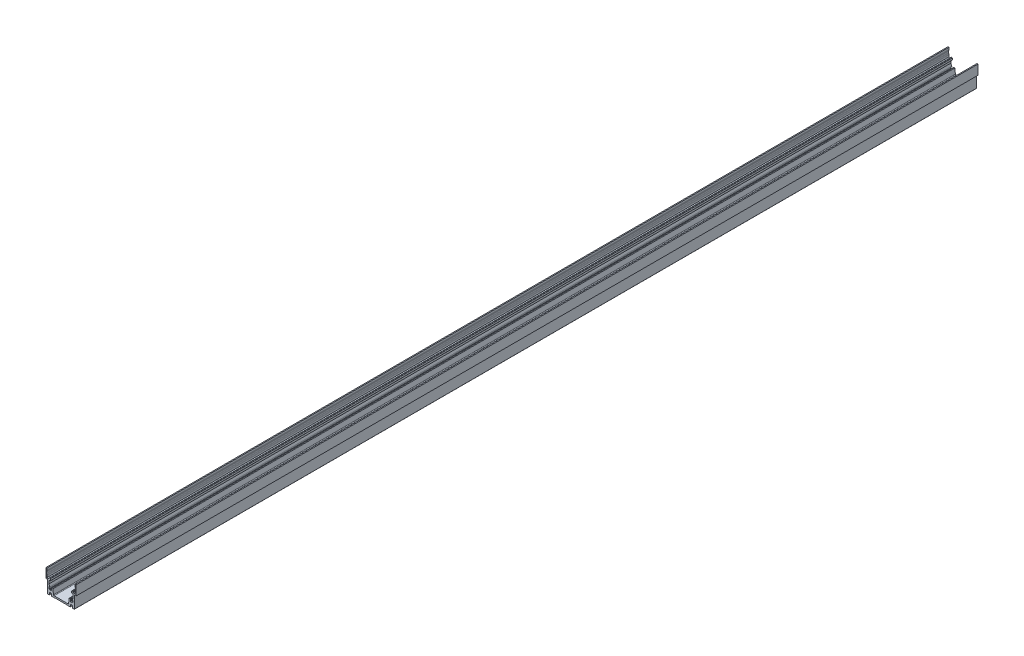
ISO-10303-21;
HEADER;
FILE_DESCRIPTION(('STEP AP214'),'2;1');
FILE_NAME('part.step','',(''),(''),'','','');
FILE_SCHEMA(('AUTOMOTIVE_DESIGN { 1 0 10303 214 1 1 1 1 }'));
ENDSEC;
DATA;
#1=APPLICATION_CONTEXT('core data for automotive mechanical design processes');
#2=APPLICATION_PROTOCOL_DEFINITION('international standard','automotive_design',2000,#1);
#3=PRODUCT_CONTEXT('',#1,'mechanical');
#4=PRODUCT('Part','Part','',(#3));
#5=PRODUCT_RELATED_PRODUCT_CATEGORY('part','',(#4));
#6=PRODUCT_DEFINITION_FORMATION('','',#4);
#7=PRODUCT_DEFINITION_CONTEXT('part definition',#1,'design');
#8=PRODUCT_DEFINITION('design','',#6,#7);
#9=PRODUCT_DEFINITION_SHAPE('','',#8);
#10=(LENGTH_UNIT() NAMED_UNIT(*) SI_UNIT(.MILLI.,.METRE.));
#11=(NAMED_UNIT(*) PLANE_ANGLE_UNIT() SI_UNIT($,.RADIAN.));
#12=(NAMED_UNIT(*) SI_UNIT($,.STERADIAN.) SOLID_ANGLE_UNIT());
#13=UNCERTAINTY_MEASURE_WITH_UNIT(LENGTH_MEASURE(1.E-05),#10,'distance_accuracy_value','');
#14=(GEOMETRIC_REPRESENTATION_CONTEXT(3) GLOBAL_UNCERTAINTY_ASSIGNED_CONTEXT((#13)) GLOBAL_UNIT_ASSIGNED_CONTEXT((#10,
#11,#12)) REPRESENTATION_CONTEXT('',''));
#15=CARTESIAN_POINT('',(0.,0.,0.));
#16=DIRECTION('',(0.,0.,1.));
#17=DIRECTION('',(1.,0.,0.));
#18=AXIS2_PLACEMENT_3D('',#15,#16,#17);
#19=CARTESIAN_POINT('',(-18.,26.302,270.));
#20=DIRECTION('',(1.,0.,0.));
#21=DIRECTION('',(0.,0.,-1.));
#22=AXIS2_PLACEMENT_3D('',#19,#20,#21);
#23=PLANE('',#22);
#24=DIRECTION('',(0.,-1.,0.));
#25=VECTOR('',#24,1.);
#26=CARTESIAN_POINT('',(-18.,26.302,0.));
#27=LINE('',#26,#25);
#28=CARTESIAN_POINT('',(-18.,26.302,0.));
#29=VERTEX_POINT('',#28);
#30=CARTESIAN_POINT('',(-18.,14.6986296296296,0.));
#31=VERTEX_POINT('',#30);
#32=EDGE_CURVE('E688',#29,#31,#27,.T.);
#33=ORIENTED_EDGE('',*,*,#32,.T.);
#34=DIRECTION('',(0.,0.,-1.));
#35=VECTOR('',#34,1.);
#36=CARTESIAN_POINT('',(-18.,14.6986296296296,270.));
#37=LINE('',#36,#35);
#38=CARTESIAN_POINT('',(-18.,14.6986296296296,1080.));
#39=VERTEX_POINT('',#38);
#40=EDGE_CURVE('E9',#39,#31,#37,.T.);
#41=ORIENTED_EDGE('',*,*,#40,.F.);
#42=DIRECTION('',(0.,1.,0.));
#43=VECTOR('',#42,1.);
#44=CARTESIAN_POINT('',(-18.,14.6986296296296,1080.));
#45=LINE('',#44,#43);
#46=CARTESIAN_POINT('',(-18.,26.302,1080.));
#47=VERTEX_POINT('',#46);
#48=EDGE_CURVE('E686',#39,#47,#45,.T.);
#49=ORIENTED_EDGE('',*,*,#48,.T.);
#50=DIRECTION('',(0.,0.,-1.));
#51=VECTOR('',#50,1.);
#52=CARTESIAN_POINT('',(-18.,26.302,270.));
#53=LINE('',#52,#51);
#54=EDGE_CURVE('E1281',#47,#29,#53,.T.);
#55=ORIENTED_EDGE('',*,*,#54,.T.);
#56=EDGE_LOOP('',(#33,#41,#49,#55));
#57=FACE_BOUND('',#56,.T.);
#58=ADVANCED_FACE('F14',(#57),#23,.F.);
#59=CARTESIAN_POINT('',(-18.,14.6986296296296,270.));
#60=DIRECTION('',(-0.287144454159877,0.957887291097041,0.));
#61=DIRECTION('',(-0.957887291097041,-0.287144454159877,0.));
#62=AXIS2_PLACEMENT_3D('',#59,#60,#61);
#63=PLANE('',#62);
#64=DIRECTION('',(0.957887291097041,0.287144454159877,0.));
#65=VECTOR('',#64,1.);
#66=CARTESIAN_POINT('',(-18.,14.6986296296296,0.));
#67=LINE('',#66,#65);
#68=CARTESIAN_POINT('',(-17.008,14.996,0.));
#69=VERTEX_POINT('',#68);
#70=EDGE_CURVE('E1025',#31,#69,#67,.T.);
#71=ORIENTED_EDGE('',*,*,#70,.T.);
#72=DIRECTION('',(0.,0.,-1.));
#73=VECTOR('',#72,1.);
#74=CARTESIAN_POINT('',(-17.008,14.996,270.));
#75=LINE('',#74,#73);
#76=CARTESIAN_POINT('',(-17.008,14.996,1080.));
#77=VERTEX_POINT('',#76);
#78=EDGE_CURVE('E21',#77,#69,#75,.T.);
#79=ORIENTED_EDGE('',*,*,#78,.F.);
#80=DIRECTION('',(-0.957887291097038,-0.287144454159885,0.));
#81=VECTOR('',#80,1.);
#82=CARTESIAN_POINT('',(-17.008,14.996,1080.));
#83=LINE('',#82,#81);
#84=EDGE_CURVE('E696',#77,#39,#83,.T.);
#85=ORIENTED_EDGE('',*,*,#84,.T.);
#86=ORIENTED_EDGE('',*,*,#40,.T.);
#87=EDGE_LOOP('',(#71,#79,#85,#86));
#88=FACE_BOUND('',#87,.T.);
#89=ADVANCED_FACE('F702',(#88),#63,.F.);
#90=CARTESIAN_POINT('',(-17.008,14.996,270.));
#91=DIRECTION('',(0.,1.,0.));
#92=DIRECTION('',(0.,0.,1.));
#93=AXIS2_PLACEMENT_3D('',#90,#91,#92);
#94=PLANE('',#93);
#95=DIRECTION('',(1.,0.,0.));
#96=VECTOR('',#95,1.);
#97=CARTESIAN_POINT('',(-17.008,14.996,0.));
#98=LINE('',#97,#96);
#99=CARTESIAN_POINT('',(-16.,14.996,0.));
#100=VERTEX_POINT('',#99);
#101=EDGE_CURVE('E1027',#69,#100,#98,.T.);
#102=ORIENTED_EDGE('',*,*,#101,.T.);
#103=DIRECTION('',(0.,0.,-1.));
#104=VECTOR('',#103,1.);
#105=CARTESIAN_POINT('',(-16.,14.996,270.));
#106=LINE('',#105,#104);
#107=CARTESIAN_POINT('',(-16.,14.996,1080.));
#108=VERTEX_POINT('',#107);
#109=EDGE_CURVE('E1554',#108,#100,#106,.T.);
#110=ORIENTED_EDGE('',*,*,#109,.F.);
#111=DIRECTION('',(-1.,0.,0.));
#112=VECTOR('',#111,1.);
#113=CARTESIAN_POINT('',(-16.,14.996,1080.));
#114=LINE('',#113,#112);
#115=EDGE_CURVE('E1022',#108,#77,#114,.T.);
#116=ORIENTED_EDGE('',*,*,#115,.T.);
#117=ORIENTED_EDGE('',*,*,#78,.T.);
#118=EDGE_LOOP('',(#102,#110,#116,#117));
#119=FACE_BOUND('',#118,.T.);
#120=ADVANCED_FACE('F1558',(#119),#94,.F.);
#121=CARTESIAN_POINT('',(-16.,14.996,270.));
#122=DIRECTION('',(1.,0.,0.));
#123=DIRECTION('',(0.,0.,-1.));
#124=AXIS2_PLACEMENT_3D('',#121,#122,#123);
#125=PLANE('',#124);
#126=DIRECTION('',(0.,-1.,0.));
#127=VECTOR('',#126,1.);
#128=CARTESIAN_POINT('',(-16.,14.996,0.));
#129=LINE('',#128,#127);
#130=CARTESIAN_POINT('',(-16.,0.0999999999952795,0.));
#131=VERTEX_POINT('',#130);
#132=EDGE_CURVE('E1029',#100,#131,#129,.T.);
#133=ORIENTED_EDGE('',*,*,#132,.T.);
#134=DIRECTION('',(0.,0.,-1.));
#135=VECTOR('',#134,1.);
#136=CARTESIAN_POINT('',(-16.,0.0999999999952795,270.));
#137=LINE('',#136,#135);
#138=CARTESIAN_POINT('',(-16.,0.0999999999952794,1080.));
#139=VERTEX_POINT('',#138);
#140=EDGE_CURVE('E1551',#139,#131,#137,.T.);
#141=ORIENTED_EDGE('',*,*,#140,.F.);
#142=DIRECTION('',(0.,1.,0.));
#143=VECTOR('',#142,1.);
#144=CARTESIAN_POINT('',(-16.,0.0999999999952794,1080.));
#145=LINE('',#144,#143);
#146=EDGE_CURVE('E1019',#139,#108,#145,.T.);
#147=ORIENTED_EDGE('',*,*,#146,.T.);
#148=ORIENTED_EDGE('',*,*,#109,.T.);
#149=EDGE_LOOP('',(#133,#141,#147,#148));
#150=FACE_BOUND('',#149,.T.);
#151=ADVANCED_FACE('F1565',(#150),#125,.F.);
#152=CARTESIAN_POINT('',(-15.702,0.0999999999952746,270.));
#153=DIRECTION('',(0.,0.,-1.));
#154=DIRECTION('',(-1.,0.,0.));
#155=AXIS2_PLACEMENT_3D('',#152,#153,#154);
#156=CYLINDRICAL_SURFACE('',#155,0.298);
#157=CARTESIAN_POINT('',(-15.702,0.0999999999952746,0.));
#158=DIRECTION('',(0.,0.,1.));
#159=DIRECTION('',(1.,0.,0.));
#160=AXIS2_PLACEMENT_3D('',#157,#158,#159);
#161=CIRCLE('',#160,0.298);
#162=CARTESIAN_POINT('',(-15.7020016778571,-0.198,0.));
#163=VERTEX_POINT('',#162);
#164=EDGE_CURVE('E1031',#131,#163,#161,.T.);
#165=ORIENTED_EDGE('',*,*,#164,.T.);
#166=DIRECTION('',(0.,0.,-1.));
#167=VECTOR('',#166,1.);
#168=CARTESIAN_POINT('',(-15.7020016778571,-0.198,270.));
#169=LINE('',#168,#167);
#170=CARTESIAN_POINT('',(-15.7020016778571,-0.198,1080.));
#171=VERTEX_POINT('',#170);
#172=EDGE_CURVE('E1548',#171,#163,#169,.T.);
#173=ORIENTED_EDGE('',*,*,#172,.F.);
#174=CARTESIAN_POINT('',(-15.702,0.0999999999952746,1080.));
#175=DIRECTION('',(0.,0.,-1.));
#176=DIRECTION('',(-1.,0.,0.));
#177=AXIS2_PLACEMENT_3D('',#174,#175,#176);
#178=CIRCLE('',#177,0.298);
#179=EDGE_CURVE('E1016',#171,#139,#178,.T.);
#180=ORIENTED_EDGE('',*,*,#179,.T.);
#181=ORIENTED_EDGE('',*,*,#140,.T.);
#182=EDGE_LOOP('',(#165,#173,#180,#181));
#183=FACE_BOUND('',#182,.T.);
#184=ADVANCED_FACE('F1568',(#183),#156,.T.);
#185=CARTESIAN_POINT('',(-15.7020016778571,-0.198,270.));
#186=DIRECTION('',(0.,1.,0.));
#187=DIRECTION('',(0.,0.,1.));
#188=AXIS2_PLACEMENT_3D('',#185,#186,#187);
#189=PLANE('',#188);
#190=DIRECTION('',(1.,0.,0.));
#191=VECTOR('',#190,1.);
#192=CARTESIAN_POINT('',(-15.7020016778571,-0.198,0.));
#193=LINE('',#192,#191);
#194=CARTESIAN_POINT('',(-14.2773032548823,-0.198,0.));
#195=VERTEX_POINT('',#194);
#196=EDGE_CURVE('E1033',#163,#195,#193,.T.);
#197=ORIENTED_EDGE('',*,*,#196,.T.);
#198=DIRECTION('',(0.,0.,-1.));
#199=VECTOR('',#198,1.);
#200=CARTESIAN_POINT('',(-14.2773032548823,-0.198,270.));
#201=LINE('',#200,#199);
#202=CARTESIAN_POINT('',(-14.2773032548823,-0.197999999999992,1080.));
#203=VERTEX_POINT('',#202);
#204=EDGE_CURVE('E1545',#203,#195,#201,.T.);
#205=ORIENTED_EDGE('',*,*,#204,.F.);
#206=DIRECTION('',(-1.,0.,0.));
#207=VECTOR('',#206,1.);
#208=CARTESIAN_POINT('',(-14.2773032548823,-0.197999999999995,1080.));
#209=LINE('',#208,#207);
#210=EDGE_CURVE('E1013',#203,#171,#209,.T.);
#211=ORIENTED_EDGE('',*,*,#210,.T.);
#212=ORIENTED_EDGE('',*,*,#172,.T.);
#213=EDGE_LOOP('',(#197,#205,#211,#212));
#214=FACE_BOUND('',#213,.T.);
#215=ADVANCED_FACE('F1573',(#214),#189,.F.);
#216=CARTESIAN_POINT('',(-14.2773038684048,0.0999999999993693,270.));
#217=DIRECTION('',(0.,0.,-1.));
#218=DIRECTION('',(-1.,0.,0.));
#219=AXIS2_PLACEMENT_3D('',#216,#217,#218);
#220=CYLINDRICAL_SURFACE('',#219,0.298);
#221=CARTESIAN_POINT('',(-14.2773038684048,0.0999999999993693,0.));
#222=DIRECTION('',(0.,0.,1.));
#223=DIRECTION('',(1.,0.,0.));
#224=AXIS2_PLACEMENT_3D('',#221,#222,#223);
#225=CIRCLE('',#224,0.298);
#226=CARTESIAN_POINT('',(-13.9819190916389,0.0606066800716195,0.));
#227=VERTEX_POINT('',#226);
#228=EDGE_CURVE('E1035',#195,#227,#225,.T.);
#229=ORIENTED_EDGE('',*,*,#228,.T.);
#230=DIRECTION('',(0.,0.,-1.));
#231=VECTOR('',#230,1.);
#232=CARTESIAN_POINT('',(-13.9819190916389,0.0606066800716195,270.));
#233=LINE('',#232,#231);
#234=CARTESIAN_POINT('',(-13.9819190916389,0.0606066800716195,1080.));
#235=VERTEX_POINT('',#234);
#236=EDGE_CURVE('E1542',#235,#227,#233,.T.);
#237=ORIENTED_EDGE('',*,*,#236,.F.);
#238=CARTESIAN_POINT('',(-14.2773038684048,0.0999999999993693,1080.));
#239=DIRECTION('',(0.,0.,-1.));
#240=DIRECTION('',(-1.,0.,0.));
#241=AXIS2_PLACEMENT_3D('',#238,#239,#240);
#242=CIRCLE('',#241,0.297999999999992);
#243=EDGE_CURVE('E1010',#235,#203,#242,.T.);
#244=ORIENTED_EDGE('',*,*,#243,.T.);
#245=ORIENTED_EDGE('',*,*,#204,.T.);
#246=EDGE_LOOP('',(#229,#237,#244,#245));
#247=FACE_BOUND('',#246,.T.);
#248=ADVANCED_FACE('F1576',(#247),#220,.T.);
#249=CARTESIAN_POINT('',(-13.9819190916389,0.0606066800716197,270.));
#250=DIRECTION('',(-0.991224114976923,0.132192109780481,0.));
#251=DIRECTION('',(-0.132192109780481,-0.991224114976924,0.));
#252=AXIS2_PLACEMENT_3D('',#249,#250,#251);
#253=PLANE('',#252);
#254=DIRECTION('',(0.132192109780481,0.991224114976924,0.));
#255=VECTOR('',#254,1.);
#256=CARTESIAN_POINT('',(-13.9819190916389,0.0606066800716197,0.));
#257=LINE('',#256,#255);
#258=CARTESIAN_POINT('',(-13.6770576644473,2.34656761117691,0.));
#259=VERTEX_POINT('',#258);
#260=EDGE_CURVE('E1037',#227,#259,#257,.T.);
#261=ORIENTED_EDGE('',*,*,#260,.T.);
#262=DIRECTION('',(0.,0.,-1.));
#263=VECTOR('',#262,1.);
#264=CARTESIAN_POINT('',(-13.6770576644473,2.34656761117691,270.));
#265=LINE('',#264,#263);
#266=CARTESIAN_POINT('',(-13.6770576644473,2.34656761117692,1080.));
#267=VERTEX_POINT('',#266);
#268=EDGE_CURVE('E1540',#267,#259,#265,.T.);
#269=ORIENTED_EDGE('',*,*,#268,.F.);
#270=DIRECTION('',(-0.132192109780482,-0.991224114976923,0.));
#271=VECTOR('',#270,1.);
#272=CARTESIAN_POINT('',(-13.6770576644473,2.34656761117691,1080.));
#273=LINE('',#272,#271);
#274=EDGE_CURVE('E1007',#267,#235,#273,.T.);
#275=ORIENTED_EDGE('',*,*,#274,.T.);
#276=ORIENTED_EDGE('',*,*,#236,.T.);
#277=EDGE_LOOP('',(#261,#269,#275,#276));
#278=FACE_BOUND('',#277,.T.);
#279=ADVANCED_FACE('F1581',(#278),#253,.F.);
#280=CARTESIAN_POINT('',(-13.1854105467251,2.281,270.));
#281=DIRECTION('',(0.,0.,-1.));
#282=DIRECTION('',(-1.,0.,0.));
#283=AXIS2_PLACEMENT_3D('',#280,#281,#282);
#284=CYLINDRICAL_SURFACE('',#283,0.496);
#285=CARTESIAN_POINT('',(-13.1854105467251,2.281,0.));
#286=DIRECTION('',(0.,0.,1.));
#287=DIRECTION('',(1.,0.,0.));
#288=AXIS2_PLACEMENT_3D('',#285,#286,#287);
#289=CIRCLE('',#288,0.496);
#290=CARTESIAN_POINT('',(-13.1854106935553,2.777,0.));
#291=VERTEX_POINT('',#290);
#292=EDGE_CURVE('E1040',#291,#259,#289,.T.);
#293=ORIENTED_EDGE('',*,*,#292,.F.);
#294=DIRECTION('',(0.,0.,-1.));
#295=VECTOR('',#294,1.);
#296=CARTESIAN_POINT('',(-13.1854106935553,2.777,270.));
#297=LINE('',#296,#295);
#298=CARTESIAN_POINT('',(-13.1854106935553,2.777,1080.));
#299=VERTEX_POINT('',#298);
#300=EDGE_CURVE('E1538',#299,#291,#297,.T.);
#301=ORIENTED_EDGE('',*,*,#300,.F.);
#302=CARTESIAN_POINT('',(-13.1854105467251,2.281,1080.));
#303=DIRECTION('',(0.,0.,1.));
#304=DIRECTION('',(-1.,0.,0.));
#305=AXIS2_PLACEMENT_3D('',#302,#303,#304);
#306=CIRCLE('',#305,0.496000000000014);
#307=EDGE_CURVE('E1004',#299,#267,#306,.T.);
#308=ORIENTED_EDGE('',*,*,#307,.T.);
#309=ORIENTED_EDGE('',*,*,#268,.T.);
#310=EDGE_LOOP('',(#293,#301,#308,#309));
#311=FACE_BOUND('',#310,.T.);
#312=ADVANCED_FACE('F1586',(#311),#284,.F.);
#313=CARTESIAN_POINT('',(-13.1854106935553,2.777,270.));
#314=DIRECTION('',(0.,1.,0.));
#315=DIRECTION('',(0.,0.,1.));
#316=AXIS2_PLACEMENT_3D('',#313,#314,#315);
#317=PLANE('',#316);
#318=DIRECTION('',(1.,0.,0.));
#319=VECTOR('',#318,1.);
#320=CARTESIAN_POINT('',(-13.1854106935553,2.777,0.));
#321=LINE('',#320,#319);
#322=CARTESIAN_POINT('',(-12.0205892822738,2.777,0.));
#323=VERTEX_POINT('',#322);
#324=EDGE_CURVE('E1043',#291,#323,#321,.T.);
#325=ORIENTED_EDGE('',*,*,#324,.T.);
#326=DIRECTION('',(0.,0.,-1.));
#327=VECTOR('',#326,1.);
#328=CARTESIAN_POINT('',(-12.0205892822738,2.777,270.));
#329=LINE('',#328,#327);
#330=CARTESIAN_POINT('',(-12.0205892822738,2.777,1080.));
#331=VERTEX_POINT('',#330);
#332=EDGE_CURVE('E1536',#331,#323,#329,.T.);
#333=ORIENTED_EDGE('',*,*,#332,.F.);
#334=DIRECTION('',(-1.,0.,0.));
#335=VECTOR('',#334,1.);
#336=CARTESIAN_POINT('',(-12.0205892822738,2.777,1080.));
#337=LINE('',#336,#335);
#338=EDGE_CURVE('E1001',#331,#299,#337,.T.);
#339=ORIENTED_EDGE('',*,*,#338,.T.);
#340=ORIENTED_EDGE('',*,*,#300,.T.);
#341=EDGE_LOOP('',(#325,#333,#339,#340));
#342=FACE_BOUND('',#341,.T.);
#343=ADVANCED_FACE('F1588',(#342),#317,.F.);
#344=CARTESIAN_POINT('',(-12.0205895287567,2.28100000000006,270.));
#345=DIRECTION('',(0.,0.,-1.));
#346=DIRECTION('',(-1.,0.,0.));
#347=AXIS2_PLACEMENT_3D('',#344,#345,#346);
#348=CYLINDRICAL_SURFACE('',#347,0.496);
#349=CARTESIAN_POINT('',(-12.0205895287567,2.28100000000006,0.));
#350=DIRECTION('',(0.,0.,1.));
#351=DIRECTION('',(1.,0.,0.));
#352=AXIS2_PLACEMENT_3D('',#349,#350,#351);
#353=CIRCLE('',#352,0.496);
#354=CARTESIAN_POINT('',(-11.5289320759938,2.34649006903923,0.));
#355=VERTEX_POINT('',#354);
#356=EDGE_CURVE('E1046',#355,#323,#353,.T.);
#357=ORIENTED_EDGE('',*,*,#356,.F.);
#358=DIRECTION('',(0.,0.,-1.));
#359=VECTOR('',#358,1.);
#360=CARTESIAN_POINT('',(-11.5289320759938,2.34649006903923,270.));
#361=LINE('',#360,#359);
#362=CARTESIAN_POINT('',(-11.5289320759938,2.34649006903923,1080.));
#363=VERTEX_POINT('',#362);
#364=EDGE_CURVE('E1534',#363,#355,#361,.T.);
#365=ORIENTED_EDGE('',*,*,#364,.F.);
#366=CARTESIAN_POINT('',(-12.0205895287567,2.28100000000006,1080.));
#367=DIRECTION('',(0.,0.,1.));
#368=DIRECTION('',(-1.,0.,0.));
#369=AXIS2_PLACEMENT_3D('',#366,#367,#368);
#370=CIRCLE('',#369,0.496);
#371=EDGE_CURVE('E998',#363,#331,#370,.T.);
#372=ORIENTED_EDGE('',*,*,#371,.T.);
#373=ORIENTED_EDGE('',*,*,#332,.T.);
#374=EDGE_LOOP('',(#357,#365,#372,#373));
#375=FACE_BOUND('',#374,.T.);
#376=ADVANCED_FACE('F1593',(#375),#348,.F.);
#377=CARTESIAN_POINT('',(-11.5289320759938,2.34649006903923,270.));
#378=DIRECTION('',(0.991244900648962,0.132036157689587,0.));
#379=DIRECTION('',(-0.132036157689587,0.991244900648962,0.));
#380=AXIS2_PLACEMENT_3D('',#377,#378,#379);
#381=PLANE('',#380);
#382=DIRECTION('',(0.132036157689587,-0.991244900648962,0.));
#383=VECTOR('',#382,1.);
#384=CARTESIAN_POINT('',(-11.5289320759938,2.34649006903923,0.));
#385=LINE('',#384,#383);
#386=CARTESIAN_POINT('',(-11.19,-0.198,0.));
#387=VERTEX_POINT('',#386);
#388=EDGE_CURVE('E1049',#355,#387,#385,.T.);
#389=ORIENTED_EDGE('',*,*,#388,.T.);
#390=DIRECTION('',(0.,0.,-1.));
#391=VECTOR('',#390,1.);
#392=CARTESIAN_POINT('',(-11.19,-0.198,270.));
#393=LINE('',#392,#391);
#394=CARTESIAN_POINT('',(-11.19,-0.198,1080.));
#395=VERTEX_POINT('',#394);
#396=EDGE_CURVE('E1531',#395,#387,#393,.T.);
#397=ORIENTED_EDGE('',*,*,#396,.F.);
#398=DIRECTION('',(-0.13203615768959,0.991244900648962,0.));
#399=VECTOR('',#398,1.);
#400=CARTESIAN_POINT('',(-11.19,-0.198,1080.));
#401=LINE('',#400,#399);
#402=EDGE_CURVE('E995',#395,#363,#401,.T.);
#403=ORIENTED_EDGE('',*,*,#402,.T.);
#404=ORIENTED_EDGE('',*,*,#364,.T.);
#405=EDGE_LOOP('',(#389,#397,#403,#404));
#406=FACE_BOUND('',#405,.T.);
#407=ADVANCED_FACE('F1598',(#406),#381,.F.);
#408=CARTESIAN_POINT('',(-11.19,-0.198,270.));
#409=DIRECTION('',(0.,1.,0.));
#410=DIRECTION('',(-1.,0.,0.));
#411=AXIS2_PLACEMENT_3D('',#408,#409,#410);
#412=PLANE('',#411);
#413=DIRECTION('',(1.,0.,0.));
#414=VECTOR('',#413,1.);
#415=CARTESIAN_POINT('',(-11.19,-0.198,0.));
#416=LINE('',#415,#414);
#417=CARTESIAN_POINT('',(-7.663,-0.198,0.));
#418=VERTEX_POINT('',#417);
#419=EDGE_CURVE('E1051',#387,#418,#416,.T.);
#420=ORIENTED_EDGE('',*,*,#419,.T.);
#421=DIRECTION('',(0.,0.,-1.));
#422=VECTOR('',#421,1.);
#423=CARTESIAN_POINT('',(-7.663,-0.198,270.));
#424=LINE('',#423,#422);
#425=CARTESIAN_POINT('',(-7.663,-0.198,1080.));
#426=VERTEX_POINT('',#425);
#427=EDGE_CURVE('E1529',#426,#418,#424,.T.);
#428=ORIENTED_EDGE('',*,*,#427,.F.);
#429=DIRECTION('',(-1.,0.,0.));
#430=VECTOR('',#429,1.);
#431=CARTESIAN_POINT('',(-7.663,-0.198,1080.));
#432=LINE('',#431,#430);
#433=EDGE_CURVE('E992',#426,#395,#432,.T.);
#434=ORIENTED_EDGE('',*,*,#433,.T.);
#435=ORIENTED_EDGE('',*,*,#396,.T.);
#436=EDGE_LOOP('',(#420,#428,#434,#435));
#437=FACE_BOUND('',#436,.T.);
#438=ADVANCED_FACE('F1600',(#437),#412,.F.);
#439=CARTESIAN_POINT('',(-7.14898437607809,-0.752368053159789,270.));
#440=DIRECTION('',(0.,0.,-1.));
#441=DIRECTION('',(-1.,0.,0.));
#442=AXIS2_PLACEMENT_3D('',#439,#440,#441);
#443=CYLINDRICAL_SURFACE('',#442,0.756);
#444=CARTESIAN_POINT('',(-7.14898437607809,-0.752368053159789,0.));
#445=DIRECTION('',(0.,0.,1.));
#446=DIRECTION('',(1.,0.,0.));
#447=AXIS2_PLACEMENT_3D('',#444,#445,#446);
#448=CIRCLE('',#447,0.756);
#449=CARTESIAN_POINT('',(-7.223,0.,0.));
#450=VERTEX_POINT('',#449);
#451=EDGE_CURVE('E1054',#450,#418,#448,.T.);
#452=ORIENTED_EDGE('',*,*,#451,.F.);
#453=DIRECTION('',(0.,0.,-1.));
#454=VECTOR('',#453,1.);
#455=CARTESIAN_POINT('',(-7.223,0.,270.));
#456=LINE('',#455,#454);
#457=CARTESIAN_POINT('',(-7.223,0.,1080.));
#458=VERTEX_POINT('',#457);
#459=EDGE_CURVE('E1527',#458,#450,#456,.T.);
#460=ORIENTED_EDGE('',*,*,#459,.F.);
#461=CARTESIAN_POINT('',(-7.14898437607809,-0.752368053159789,1080.));
#462=DIRECTION('',(0.,0.,1.));
#463=DIRECTION('',(-1.,0.,0.));
#464=AXIS2_PLACEMENT_3D('',#461,#462,#463);
#465=CIRCLE('',#464,0.756);
#466=EDGE_CURVE('E989',#458,#426,#465,.T.);
#467=ORIENTED_EDGE('',*,*,#466,.T.);
#468=ORIENTED_EDGE('',*,*,#427,.T.);
#469=EDGE_LOOP('',(#452,#460,#467,#468));
#470=FACE_BOUND('',#469,.T.);
#471=ADVANCED_FACE('F1604',(#470),#443,.F.);
#472=CARTESIAN_POINT('',(-7.223,0.,270.));
#473=DIRECTION('',(0.,1.,0.));
#474=DIRECTION('',(0.,0.,1.));
#475=AXIS2_PLACEMENT_3D('',#472,#473,#474);
#476=PLANE('',#475);
#477=DIRECTION('',(1.,0.,0.));
#478=VECTOR('',#477,1.);
#479=CARTESIAN_POINT('',(-7.223,0.,0.));
#480=LINE('',#479,#478);
#481=CARTESIAN_POINT('',(7.223,0.,0.));
#482=VERTEX_POINT('',#481);
#483=EDGE_CURVE('E1057',#450,#482,#480,.T.);
#484=ORIENTED_EDGE('',*,*,#483,.T.);
#485=DIRECTION('',(0.,0.,-1.));
#486=VECTOR('',#485,1.);
#487=CARTESIAN_POINT('',(7.223,0.,270.));
#488=LINE('',#487,#486);
#489=CARTESIAN_POINT('',(7.223,0.,1080.));
#490=VERTEX_POINT('',#489);
#491=EDGE_CURVE('E1525',#490,#482,#488,.T.);
#492=ORIENTED_EDGE('',*,*,#491,.F.);
#493=DIRECTION('',(-1.,0.,0.));
#494=VECTOR('',#493,1.);
#495=CARTESIAN_POINT('',(7.223,0.,1080.));
#496=LINE('',#495,#494);
#497=EDGE_CURVE('E986',#490,#458,#496,.T.);
#498=ORIENTED_EDGE('',*,*,#497,.T.);
#499=ORIENTED_EDGE('',*,*,#459,.T.);
#500=EDGE_LOOP('',(#484,#492,#498,#499));
#501=FACE_BOUND('',#500,.T.);
#502=ADVANCED_FACE('F1609',(#501),#476,.F.);
#503=CARTESIAN_POINT('',(7.14898437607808,-0.752368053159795,270.));
#504=DIRECTION('',(0.,0.,-1.));
#505=DIRECTION('',(-1.,0.,0.));
#506=AXIS2_PLACEMENT_3D('',#503,#504,#505);
#507=CYLINDRICAL_SURFACE('',#506,0.756);
#508=CARTESIAN_POINT('',(7.14898437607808,-0.752368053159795,0.));
#509=DIRECTION('',(0.,0.,1.));
#510=DIRECTION('',(1.,0.,0.));
#511=AXIS2_PLACEMENT_3D('',#508,#509,#510);
#512=CIRCLE('',#511,0.756);
#513=CARTESIAN_POINT('',(7.663,-0.198,0.));
#514=VERTEX_POINT('',#513);
#515=EDGE_CURVE('E1060',#514,#482,#512,.T.);
#516=ORIENTED_EDGE('',*,*,#515,.F.);
#517=DIRECTION('',(0.,0.,-1.));
#518=VECTOR('',#517,1.);
#519=CARTESIAN_POINT('',(7.663,-0.198,270.));
#520=LINE('',#519,#518);
#521=CARTESIAN_POINT('',(7.663,-0.198,1080.));
#522=VERTEX_POINT('',#521);
#523=EDGE_CURVE('E1523',#522,#514,#520,.T.);
#524=ORIENTED_EDGE('',*,*,#523,.F.);
#525=CARTESIAN_POINT('',(7.14898437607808,-0.752368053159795,1080.));
#526=DIRECTION('',(0.,0.,1.));
#527=DIRECTION('',(-1.,0.,0.));
#528=AXIS2_PLACEMENT_3D('',#525,#526,#527);
#529=CIRCLE('',#528,0.756000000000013);
#530=EDGE_CURVE('E983',#522,#490,#529,.T.);
#531=ORIENTED_EDGE('',*,*,#530,.T.);
#532=ORIENTED_EDGE('',*,*,#491,.T.);
#533=EDGE_LOOP('',(#516,#524,#531,#532));
#534=FACE_BOUND('',#533,.T.);
#535=ADVANCED_FACE('F1612',(#534),#507,.F.);
#536=CARTESIAN_POINT('',(7.663,-0.198,270.));
#537=DIRECTION('',(0.,1.,0.));
#538=DIRECTION('',(-1.,0.,0.));
#539=AXIS2_PLACEMENT_3D('',#536,#537,#538);
#540=PLANE('',#539);
#541=DIRECTION('',(1.,0.,0.));
#542=VECTOR('',#541,1.);
#543=CARTESIAN_POINT('',(7.663,-0.198,0.));
#544=LINE('',#543,#542);
#545=CARTESIAN_POINT('',(10.93,-0.198,0.));
#546=VERTEX_POINT('',#545);
#547=EDGE_CURVE('E1063',#514,#546,#544,.T.);
#548=ORIENTED_EDGE('',*,*,#547,.T.);
#549=DIRECTION('',(0.,0.,-1.));
#550=VECTOR('',#549,1.);
#551=CARTESIAN_POINT('',(10.93,-0.198,270.));
#552=LINE('',#551,#550);
#553=CARTESIAN_POINT('',(10.93,-0.197999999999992,1080.));
#554=VERTEX_POINT('',#553);
#555=EDGE_CURVE('E1520',#554,#546,#552,.T.);
#556=ORIENTED_EDGE('',*,*,#555,.F.);
#557=DIRECTION('',(-1.,0.,0.));
#558=VECTOR('',#557,1.);
#559=CARTESIAN_POINT('',(10.93,-0.197999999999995,1080.));
#560=LINE('',#559,#558);
#561=EDGE_CURVE('E980',#554,#522,#560,.T.);
#562=ORIENTED_EDGE('',*,*,#561,.T.);
#563=ORIENTED_EDGE('',*,*,#523,.T.);
#564=EDGE_LOOP('',(#548,#556,#562,#563));
#565=FACE_BOUND('',#564,.T.);
#566=ADVANCED_FACE('F1616',(#565),#540,.F.);
#567=CARTESIAN_POINT('',(10.9286957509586,0.0999971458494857,270.));
#568=DIRECTION('',(0.,0.,-1.));
#569=DIRECTION('',(-1.,0.,0.));
#570=AXIS2_PLACEMENT_3D('',#567,#568,#569);
#571=CYLINDRICAL_SURFACE('',#570,0.298);
#572=CARTESIAN_POINT('',(10.9286957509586,0.0999971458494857,0.));
#573=DIRECTION('',(0.,0.,1.));
#574=DIRECTION('',(1.,0.,0.));
#575=AXIS2_PLACEMENT_3D('',#572,#573,#574);
#576=CIRCLE('',#575,0.298);
#577=CARTESIAN_POINT('',(11.2240805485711,0.0606039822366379,0.));
#578=VERTEX_POINT('',#577);
#579=EDGE_CURVE('E1065',#546,#578,#576,.T.);
#580=ORIENTED_EDGE('',*,*,#579,.T.);
#581=DIRECTION('',(0.,0.,-1.));
#582=VECTOR('',#581,1.);
#583=CARTESIAN_POINT('',(11.2240805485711,0.0606039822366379,270.));
#584=LINE('',#583,#582);
#585=CARTESIAN_POINT('',(11.2240805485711,0.0606039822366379,1080.));
#586=VERTEX_POINT('',#585);
#587=EDGE_CURVE('E1517',#586,#578,#584,.T.);
#588=ORIENTED_EDGE('',*,*,#587,.F.);
#589=CARTESIAN_POINT('',(10.9286957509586,0.0999971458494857,1080.));
#590=DIRECTION('',(0.,0.,-1.));
#591=DIRECTION('',(-1.,0.,0.));
#592=AXIS2_PLACEMENT_3D('',#589,#590,#591);
#593=CIRCLE('',#592,0.297999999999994);
#594=EDGE_CURVE('E977',#586,#554,#593,.T.);
#595=ORIENTED_EDGE('',*,*,#594,.T.);
#596=ORIENTED_EDGE('',*,*,#555,.T.);
#597=EDGE_LOOP('',(#580,#588,#595,#596));
#598=FACE_BOUND('',#597,.T.);
#599=ADVANCED_FACE('F1620',(#598),#571,.T.);
#600=CARTESIAN_POINT('',(11.2240805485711,0.0606039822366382,270.));
#601=DIRECTION('',(-0.991224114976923,0.132192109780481,0.));
#602=DIRECTION('',(-0.132192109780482,-0.991224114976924,0.));
#603=AXIS2_PLACEMENT_3D('',#600,#601,#602);
#604=PLANE('',#603);
#605=DIRECTION('',(0.132192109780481,0.991224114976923,0.));
#606=VECTOR('',#605,1.);
#607=CARTESIAN_POINT('',(11.2240805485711,0.0606039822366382,0.));
#608=LINE('',#607,#606);
#609=CARTESIAN_POINT('',(11.5289423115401,2.3465674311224,0.));
#610=VERTEX_POINT('',#609);
#611=EDGE_CURVE('E1067',#578,#610,#608,.T.);
#612=ORIENTED_EDGE('',*,*,#611,.T.);
#613=DIRECTION('',(0.,0.,-1.));
#614=VECTOR('',#613,1.);
#615=CARTESIAN_POINT('',(11.5289423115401,2.3465674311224,270.));
#616=LINE('',#615,#614);
#617=CARTESIAN_POINT('',(11.5289423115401,2.3465674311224,1080.));
#618=VERTEX_POINT('',#617);
#619=EDGE_CURVE('E1515',#618,#610,#616,.T.);
#620=ORIENTED_EDGE('',*,*,#619,.F.);
#621=DIRECTION('',(-0.132192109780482,-0.991224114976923,0.));
#622=VECTOR('',#621,1.);
#623=CARTESIAN_POINT('',(11.5289423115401,2.3465674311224,1080.));
#624=LINE('',#623,#622);
#625=EDGE_CURVE('E974',#618,#586,#624,.T.);
#626=ORIENTED_EDGE('',*,*,#625,.T.);
#627=ORIENTED_EDGE('',*,*,#587,.T.);
#628=EDGE_LOOP('',(#612,#620,#626,#627));
#629=FACE_BOUND('',#628,.T.);
#630=ADVANCED_FACE('F1625',(#629),#604,.F.);
#631=CARTESIAN_POINT('',(12.020589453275,2.28100000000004,270.));
#632=DIRECTION('',(0.,0.,-1.));
#633=DIRECTION('',(-1.,0.,0.));
#634=AXIS2_PLACEMENT_3D('',#631,#632,#633);
#635=CYLINDRICAL_SURFACE('',#634,0.496);
#636=CARTESIAN_POINT('',(12.020589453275,2.28100000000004,0.));
#637=DIRECTION('',(0.,0.,1.));
#638=DIRECTION('',(1.,0.,0.));
#639=AXIS2_PLACEMENT_3D('',#636,#637,#638);
#640=CIRCLE('',#639,0.496);
#641=CARTESIAN_POINT('',(12.0205892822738,2.777,0.));
#642=VERTEX_POINT('',#641);
#643=EDGE_CURVE('E1070',#642,#610,#640,.T.);
#644=ORIENTED_EDGE('',*,*,#643,.F.);
#645=DIRECTION('',(0.,0.,-1.));
#646=VECTOR('',#645,1.);
#647=CARTESIAN_POINT('',(12.0205892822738,2.777,270.));
#648=LINE('',#647,#646);
#649=CARTESIAN_POINT('',(12.0205892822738,2.777,1080.));
#650=VERTEX_POINT('',#649);
#651=EDGE_CURVE('E1513',#650,#642,#648,.T.);
#652=ORIENTED_EDGE('',*,*,#651,.F.);
#653=CARTESIAN_POINT('',(12.020589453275,2.28100000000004,1080.));
#654=DIRECTION('',(0.,0.,1.));
#655=DIRECTION('',(-1.,0.,0.));
#656=AXIS2_PLACEMENT_3D('',#653,#654,#655);
#657=CIRCLE('',#656,0.496);
#658=EDGE_CURVE('E971',#650,#618,#657,.T.);
#659=ORIENTED_EDGE('',*,*,#658,.T.);
#660=ORIENTED_EDGE('',*,*,#619,.T.);
#661=EDGE_LOOP('',(#644,#652,#659,#660));
#662=FACE_BOUND('',#661,.T.);
#663=ADVANCED_FACE('F1630',(#662),#635,.F.);
#664=CARTESIAN_POINT('',(12.0205892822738,2.777,270.));
#665=DIRECTION('',(0.,1.,0.));
#666=DIRECTION('',(0.,0.,1.));
#667=AXIS2_PLACEMENT_3D('',#664,#665,#666);
#668=PLANE('',#667);
#669=DIRECTION('',(1.,0.,0.));
#670=VECTOR('',#669,1.);
#671=CARTESIAN_POINT('',(12.0205892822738,2.777,0.));
#672=LINE('',#671,#670);
#673=CARTESIAN_POINT('',(13.1854106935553,2.777,0.));
#674=VERTEX_POINT('',#673);
#675=EDGE_CURVE('E1073',#642,#674,#672,.T.);
#676=ORIENTED_EDGE('',*,*,#675,.T.);
#677=DIRECTION('',(0.,0.,-1.));
#678=VECTOR('',#677,1.);
#679=CARTESIAN_POINT('',(13.1854106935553,2.777,270.));
#680=LINE('',#679,#678);
#681=CARTESIAN_POINT('',(13.1854106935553,2.777,1080.));
#682=VERTEX_POINT('',#681);
#683=EDGE_CURVE('E1511',#682,#674,#680,.T.);
#684=ORIENTED_EDGE('',*,*,#683,.F.);
#685=DIRECTION('',(-1.,0.,0.));
#686=VECTOR('',#685,1.);
#687=CARTESIAN_POINT('',(13.1854106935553,2.777,1080.));
#688=LINE('',#687,#686);
#689=EDGE_CURVE('E968',#682,#650,#688,.T.);
#690=ORIENTED_EDGE('',*,*,#689,.T.);
#691=ORIENTED_EDGE('',*,*,#651,.T.);
#692=EDGE_LOOP('',(#676,#684,#690,#691));
#693=FACE_BOUND('',#692,.T.);
#694=ADVANCED_FACE('F1632',(#693),#668,.F.);
#695=CARTESIAN_POINT('',(13.1854105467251,2.281,270.));
#696=DIRECTION('',(0.,0.,-1.));
#697=DIRECTION('',(-1.,0.,0.));
#698=AXIS2_PLACEMENT_3D('',#695,#696,#697);
#699=CYLINDRICAL_SURFACE('',#698,0.496);
#700=CARTESIAN_POINT('',(13.1854105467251,2.281,0.));
#701=DIRECTION('',(0.,0.,1.));
#702=DIRECTION('',(1.,0.,0.));
#703=AXIS2_PLACEMENT_3D('',#700,#701,#702);
#704=CIRCLE('',#703,0.496);
#705=CARTESIAN_POINT('',(13.6770576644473,2.34656761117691,0.));
#706=VERTEX_POINT('',#705);
#707=EDGE_CURVE('E1076',#706,#674,#704,.T.);
#708=ORIENTED_EDGE('',*,*,#707,.F.);
#709=DIRECTION('',(0.,0.,-1.));
#710=VECTOR('',#709,1.);
#711=CARTESIAN_POINT('',(13.6770576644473,2.34656761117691,270.));
#712=LINE('',#711,#710);
#713=CARTESIAN_POINT('',(13.6770576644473,2.34656761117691,1080.));
#714=VERTEX_POINT('',#713);
#715=EDGE_CURVE('E1509',#714,#706,#712,.T.);
#716=ORIENTED_EDGE('',*,*,#715,.F.);
#717=CARTESIAN_POINT('',(13.1854105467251,2.281,1080.));
#718=DIRECTION('',(0.,0.,1.));
#719=DIRECTION('',(-1.,0.,0.));
#720=AXIS2_PLACEMENT_3D('',#717,#718,#719);
#721=CIRCLE('',#720,0.496);
#722=EDGE_CURVE('E965',#714,#682,#721,.T.);
#723=ORIENTED_EDGE('',*,*,#722,.T.);
#724=ORIENTED_EDGE('',*,*,#683,.T.);
#725=EDGE_LOOP('',(#708,#716,#723,#724));
#726=FACE_BOUND('',#725,.T.);
#727=ADVANCED_FACE('F1637',(#726),#699,.F.);
#728=CARTESIAN_POINT('',(13.6770576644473,2.34656761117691,270.));
#729=DIRECTION('',(0.991224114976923,0.132192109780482,0.));
#730=DIRECTION('',(-0.132192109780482,0.991224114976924,0.));
#731=AXIS2_PLACEMENT_3D('',#728,#729,#730);
#732=PLANE('',#731);
#733=DIRECTION('',(0.132192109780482,-0.991224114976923,0.));
#734=VECTOR('',#733,1.);
#735=CARTESIAN_POINT('',(13.6770576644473,2.34656761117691,0.));
#736=LINE('',#735,#734);
#737=CARTESIAN_POINT('',(13.9819190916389,0.0606066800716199,0.));
#738=VERTEX_POINT('',#737);
#739=EDGE_CURVE('E1079',#706,#738,#736,.T.);
#740=ORIENTED_EDGE('',*,*,#739,.T.);
#741=DIRECTION('',(0.,0.,-1.));
#742=VECTOR('',#741,1.);
#743=CARTESIAN_POINT('',(13.9819190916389,0.0606066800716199,270.));
#744=LINE('',#743,#742);
#745=CARTESIAN_POINT('',(13.9819190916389,0.0606066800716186,1080.));
#746=VERTEX_POINT('',#745);
#747=EDGE_CURVE('E1506',#746,#738,#744,.T.);
#748=ORIENTED_EDGE('',*,*,#747,.F.);
#749=DIRECTION('',(-0.132192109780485,0.991224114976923,0.));
#750=VECTOR('',#749,1.);
#751=CARTESIAN_POINT('',(13.9819190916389,0.0606066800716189,1080.));
#752=LINE('',#751,#750);
#753=EDGE_CURVE('E962',#746,#714,#752,.T.);
#754=ORIENTED_EDGE('',*,*,#753,.T.);
#755=ORIENTED_EDGE('',*,*,#715,.T.);
#756=EDGE_LOOP('',(#740,#748,#754,#755));
#757=FACE_BOUND('',#756,.T.);
#758=ADVANCED_FACE('F1642',(#757),#732,.F.);
#759=CARTESIAN_POINT('',(14.2773038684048,0.0999999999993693,270.));
#760=DIRECTION('',(0.,0.,-1.));
#761=DIRECTION('',(-1.,0.,0.));
#762=AXIS2_PLACEMENT_3D('',#759,#760,#761);
#763=CYLINDRICAL_SURFACE('',#762,0.298);
#764=CARTESIAN_POINT('',(14.2773038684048,0.0999999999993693,0.));
#765=DIRECTION('',(0.,0.,1.));
#766=DIRECTION('',(1.,0.,0.));
#767=AXIS2_PLACEMENT_3D('',#764,#765,#766);
#768=CIRCLE('',#767,0.298);
#769=CARTESIAN_POINT('',(14.2773032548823,-0.198,0.));
#770=VERTEX_POINT('',#769);
#771=EDGE_CURVE('E1081',#738,#770,#768,.T.);
#772=ORIENTED_EDGE('',*,*,#771,.T.);
#773=DIRECTION('',(0.,0.,-1.));
#774=VECTOR('',#773,1.);
#775=CARTESIAN_POINT('',(14.2773032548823,-0.198,270.));
#776=LINE('',#775,#774);
#777=CARTESIAN_POINT('',(14.2773032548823,-0.198,1080.));
#778=VERTEX_POINT('',#777);
#779=EDGE_CURVE('E1503',#778,#770,#776,.T.);
#780=ORIENTED_EDGE('',*,*,#779,.F.);
#781=CARTESIAN_POINT('',(14.2773038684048,0.0999999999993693,1080.));
#782=DIRECTION('',(0.,0.,-1.));
#783=DIRECTION('',(-1.,0.,0.));
#784=AXIS2_PLACEMENT_3D('',#781,#782,#783);
#785=CIRCLE('',#784,0.298);
#786=EDGE_CURVE('E959',#778,#746,#785,.T.);
#787=ORIENTED_EDGE('',*,*,#786,.T.);
#788=ORIENTED_EDGE('',*,*,#747,.T.);
#789=EDGE_LOOP('',(#772,#780,#787,#788));
#790=FACE_BOUND('',#789,.T.);
#791=ADVANCED_FACE('F1644',(#790),#763,.T.);
#792=CARTESIAN_POINT('',(14.2773032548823,-0.198,270.));
#793=DIRECTION('',(0.,1.,0.));
#794=DIRECTION('',(0.,0.,1.));
#795=AXIS2_PLACEMENT_3D('',#792,#793,#794);
#796=PLANE('',#795);
#797=DIRECTION('',(1.,0.,0.));
#798=VECTOR('',#797,1.);
#799=CARTESIAN_POINT('',(14.2773032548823,-0.198,0.));
#800=LINE('',#799,#798);
#801=CARTESIAN_POINT('',(15.7020016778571,-0.198,0.));
#802=VERTEX_POINT('',#801);
#803=EDGE_CURVE('E1083',#770,#802,#800,.T.);
#804=ORIENTED_EDGE('',*,*,#803,.T.);
#805=DIRECTION('',(0.,0.,-1.));
#806=VECTOR('',#805,1.);
#807=CARTESIAN_POINT('',(15.7020016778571,-0.198,270.));
#808=LINE('',#807,#806);
#809=CARTESIAN_POINT('',(15.7020016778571,-0.198,1080.));
#810=VERTEX_POINT('',#809);
#811=EDGE_CURVE('E1500',#810,#802,#808,.T.);
#812=ORIENTED_EDGE('',*,*,#811,.F.);
#813=DIRECTION('',(-1.,0.,0.));
#814=VECTOR('',#813,1.);
#815=CARTESIAN_POINT('',(15.7020016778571,-0.198,1080.));
#816=LINE('',#815,#814);
#817=EDGE_CURVE('E956',#810,#778,#816,.T.);
#818=ORIENTED_EDGE('',*,*,#817,.T.);
#819=ORIENTED_EDGE('',*,*,#779,.T.);
#820=EDGE_LOOP('',(#804,#812,#818,#819));
#821=FACE_BOUND('',#820,.T.);
#822=ADVANCED_FACE('F1649',(#821),#796,.F.);
#823=CARTESIAN_POINT('',(15.702,0.0999999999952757,270.));
#824=DIRECTION('',(0.,0.,-1.));
#825=DIRECTION('',(-1.,0.,0.));
#826=AXIS2_PLACEMENT_3D('',#823,#824,#825);
#827=CYLINDRICAL_SURFACE('',#826,0.298);
#828=CARTESIAN_POINT('',(15.702,0.0999999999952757,0.));
#829=DIRECTION('',(0.,0.,1.));
#830=DIRECTION('',(1.,0.,0.));
#831=AXIS2_PLACEMENT_3D('',#828,#829,#830);
#832=CIRCLE('',#831,0.298);
#833=CARTESIAN_POINT('',(16.,0.100000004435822,0.));
#834=VERTEX_POINT('',#833);
#835=EDGE_CURVE('E1085',#802,#834,#832,.T.);
#836=ORIENTED_EDGE('',*,*,#835,.T.);
#837=DIRECTION('',(0.,0.,-1.));
#838=VECTOR('',#837,1.);
#839=CARTESIAN_POINT('',(16.,0.100000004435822,270.));
#840=LINE('',#839,#838);
#841=CARTESIAN_POINT('',(16.,0.100000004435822,1080.));
#842=VERTEX_POINT('',#841);
#843=EDGE_CURVE('E1497',#842,#834,#840,.T.);
#844=ORIENTED_EDGE('',*,*,#843,.F.);
#845=CARTESIAN_POINT('',(15.702,0.0999999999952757,1080.));
#846=DIRECTION('',(0.,0.,-1.));
#847=DIRECTION('',(-1.,0.,0.));
#848=AXIS2_PLACEMENT_3D('',#845,#846,#847);
#849=CIRCLE('',#848,0.298);
#850=EDGE_CURVE('E953',#842,#810,#849,.T.);
#851=ORIENTED_EDGE('',*,*,#850,.T.);
#852=ORIENTED_EDGE('',*,*,#811,.T.);
#853=EDGE_LOOP('',(#836,#844,#851,#852));
#854=FACE_BOUND('',#853,.T.);
#855=ADVANCED_FACE('F1652',(#854),#827,.T.);
#856=CARTESIAN_POINT('',(16.,0.0999999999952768,270.));
#857=DIRECTION('',(-1.,0.,0.));
#858=DIRECTION('',(0.,0.,1.));
#859=AXIS2_PLACEMENT_3D('',#856,#857,#858);
#860=PLANE('',#859);
#861=DIRECTION('',(0.,1.,0.));
#862=VECTOR('',#861,1.);
#863=CARTESIAN_POINT('',(16.,0.0999999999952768,0.));
#864=LINE('',#863,#862);
#865=CARTESIAN_POINT('',(16.,14.996,0.));
#866=VERTEX_POINT('',#865);
#867=EDGE_CURVE('E1087',#834,#866,#864,.T.);
#868=ORIENTED_EDGE('',*,*,#867,.T.);
#869=DIRECTION('',(0.,0.,-1.));
#870=VECTOR('',#869,1.);
#871=CARTESIAN_POINT('',(16.,14.996,270.));
#872=LINE('',#871,#870);
#873=CARTESIAN_POINT('',(16.,14.996,1080.));
#874=VERTEX_POINT('',#873);
#875=EDGE_CURVE('E1494',#874,#866,#872,.T.);
#876=ORIENTED_EDGE('',*,*,#875,.F.);
#877=DIRECTION('',(0.,-1.,0.));
#878=VECTOR('',#877,1.);
#879=CARTESIAN_POINT('',(16.,14.996,1080.));
#880=LINE('',#879,#878);
#881=EDGE_CURVE('E950',#874,#842,#880,.T.);
#882=ORIENTED_EDGE('',*,*,#881,.T.);
#883=ORIENTED_EDGE('',*,*,#843,.T.);
#884=EDGE_LOOP('',(#868,#876,#882,#883));
#885=FACE_BOUND('',#884,.T.);
#886=ADVANCED_FACE('F1657',(#885),#860,.F.);
#887=CARTESIAN_POINT('',(16.,14.996,270.));
#888=DIRECTION('',(0.,1.,0.));
#889=DIRECTION('',(0.,0.,1.));
#890=AXIS2_PLACEMENT_3D('',#887,#888,#889);
#891=PLANE('',#890);
#892=DIRECTION('',(1.,0.,0.));
#893=VECTOR('',#892,1.);
#894=CARTESIAN_POINT('',(16.,14.996,0.));
#895=LINE('',#894,#893);
#896=CARTESIAN_POINT('',(17.008,14.996,0.));
#897=VERTEX_POINT('',#896);
#898=EDGE_CURVE('E1089',#866,#897,#895,.T.);
#899=ORIENTED_EDGE('',*,*,#898,.T.);
#900=DIRECTION('',(0.,0.,-1.));
#901=VECTOR('',#900,1.);
#902=CARTESIAN_POINT('',(17.008,14.996,270.));
#903=LINE('',#902,#901);
#904=CARTESIAN_POINT('',(17.008,14.996,1080.));
#905=VERTEX_POINT('',#904);
#906=EDGE_CURVE('E1491',#905,#897,#903,.T.);
#907=ORIENTED_EDGE('',*,*,#906,.F.);
#908=DIRECTION('',(-1.,0.,0.));
#909=VECTOR('',#908,1.);
#910=CARTESIAN_POINT('',(17.008,14.996,1080.));
#911=LINE('',#910,#909);
#912=EDGE_CURVE('E947',#905,#874,#911,.T.);
#913=ORIENTED_EDGE('',*,*,#912,.T.);
#914=ORIENTED_EDGE('',*,*,#875,.T.);
#915=EDGE_LOOP('',(#899,#907,#913,#914));
#916=FACE_BOUND('',#915,.T.);
#917=ADVANCED_FACE('F1660',(#916),#891,.F.);
#918=CARTESIAN_POINT('',(17.008,14.996,270.));
#919=DIRECTION('',(0.287144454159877,0.957887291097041,0.));
#920=DIRECTION('',(-0.957887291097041,0.287144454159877,0.));
#921=AXIS2_PLACEMENT_3D('',#918,#919,#920);
#922=PLANE('',#921);
#923=DIRECTION('',(0.957887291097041,-0.287144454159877,0.));
#924=VECTOR('',#923,1.);
#925=CARTESIAN_POINT('',(17.008,14.996,0.));
#926=LINE('',#925,#924);
#927=CARTESIAN_POINT('',(18.,14.6986296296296,0.));
#928=VERTEX_POINT('',#927);
#929=EDGE_CURVE('E1091',#897,#928,#926,.T.);
#930=ORIENTED_EDGE('',*,*,#929,.T.);
#931=DIRECTION('',(0.,0.,-1.));
#932=VECTOR('',#931,1.);
#933=CARTESIAN_POINT('',(18.,14.6986296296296,270.));
#934=LINE('',#933,#932);
#935=CARTESIAN_POINT('',(18.,14.6986296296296,1080.));
#936=VERTEX_POINT('',#935);
#937=EDGE_CURVE('E1488',#936,#928,#934,.T.);
#938=ORIENTED_EDGE('',*,*,#937,.F.);
#939=DIRECTION('',(-0.957887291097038,0.287144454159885,0.));
#940=VECTOR('',#939,1.);
#941=CARTESIAN_POINT('',(18.,14.6986296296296,1080.));
#942=LINE('',#941,#940);
#943=EDGE_CURVE('E944',#936,#905,#942,.T.);
#944=ORIENTED_EDGE('',*,*,#943,.T.);
#945=ORIENTED_EDGE('',*,*,#906,.T.);
#946=EDGE_LOOP('',(#930,#938,#944,#945));
#947=FACE_BOUND('',#946,.T.);
#948=ADVANCED_FACE('F1665',(#947),#922,.F.);
#949=CARTESIAN_POINT('',(18.,14.6986296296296,270.));
#950=DIRECTION('',(-1.,0.,0.));
#951=DIRECTION('',(0.,0.,1.));
#952=AXIS2_PLACEMENT_3D('',#949,#950,#951);
#953=PLANE('',#952);
#954=DIRECTION('',(0.,1.,0.));
#955=VECTOR('',#954,1.);
#956=CARTESIAN_POINT('',(18.,14.6986296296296,0.));
#957=LINE('',#956,#955);
#958=CARTESIAN_POINT('',(18.,26.302,0.));
#959=VERTEX_POINT('',#958);
#960=EDGE_CURVE('E1093',#928,#959,#957,.T.);
#961=ORIENTED_EDGE('',*,*,#960,.T.);
#962=DIRECTION('',(0.,0.,-1.));
#963=VECTOR('',#962,1.);
#964=CARTESIAN_POINT('',(18.,26.302,270.));
#965=LINE('',#964,#963);
#966=CARTESIAN_POINT('',(18.,26.302,1080.));
#967=VERTEX_POINT('',#966);
#968=EDGE_CURVE('E1485',#967,#959,#965,.T.);
#969=ORIENTED_EDGE('',*,*,#968,.F.);
#970=DIRECTION('',(0.,-1.,0.));
#971=VECTOR('',#970,1.);
#972=CARTESIAN_POINT('',(18.,26.302,1080.));
#973=LINE('',#972,#971);
#974=EDGE_CURVE('E941',#967,#936,#973,.T.);
#975=ORIENTED_EDGE('',*,*,#974,.T.);
#976=ORIENTED_EDGE('',*,*,#937,.T.);
#977=EDGE_LOOP('',(#961,#969,#975,#976));
#978=FACE_BOUND('',#977,.T.);
#979=ADVANCED_FACE('F1668',(#978),#953,.F.);
#980=CARTESIAN_POINT('',(18.,26.302,270.));
#981=DIRECTION('',(0.,-1.,0.));
#982=DIRECTION('',(0.,0.,-1.));
#983=AXIS2_PLACEMENT_3D('',#980,#981,#982);
#984=PLANE('',#983);
#985=DIRECTION('',(-1.,0.,0.));
#986=VECTOR('',#985,1.);
#987=CARTESIAN_POINT('',(18.,26.302,0.));
#988=LINE('',#987,#986);
#989=CARTESIAN_POINT('',(16.81,26.302,0.));
#990=VERTEX_POINT('',#989);
#991=EDGE_CURVE('E1095',#959,#990,#988,.T.);
#992=ORIENTED_EDGE('',*,*,#991,.T.);
#993=DIRECTION('',(0.,0.,-1.));
#994=VECTOR('',#993,1.);
#995=CARTESIAN_POINT('',(16.81,26.302,270.));
#996=LINE('',#995,#994);
#997=CARTESIAN_POINT('',(16.81,26.302,1080.));
#998=VERTEX_POINT('',#997);
#999=EDGE_CURVE('E1482',#998,#990,#996,.T.);
#1000=ORIENTED_EDGE('',*,*,#999,.F.);
#1001=DIRECTION('',(1.,0.,0.));
#1002=VECTOR('',#1001,1.);
#1003=CARTESIAN_POINT('',(16.81,26.302,1080.));
#1004=LINE('',#1003,#1002);
#1005=EDGE_CURVE('E938',#998,#967,#1004,.T.);
#1006=ORIENTED_EDGE('',*,*,#1005,.T.);
#1007=ORIENTED_EDGE('',*,*,#968,.T.);
#1008=EDGE_LOOP('',(#992,#1000,#1006,#1007));
#1009=FACE_BOUND('',#1008,.T.);
#1010=ADVANCED_FACE('F1673',(#1009),#984,.F.);
#1011=CARTESIAN_POINT('',(16.81,26.302,270.));
#1012=DIRECTION('',(1.,0.,0.));
#1013=DIRECTION('',(0.,0.,-1.));
#1014=AXIS2_PLACEMENT_3D('',#1011,#1012,#1013);
#1015=PLANE('',#1014);
#1016=DIRECTION('',(0.,-1.,0.));
#1017=VECTOR('',#1016,1.);
#1018=CARTESIAN_POINT('',(16.81,26.302,0.));
#1019=LINE('',#1018,#1017);
#1020=CARTESIAN_POINT('',(16.81,24.0331095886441,0.));
#1021=VERTEX_POINT('',#1020);
#1022=EDGE_CURVE('E1097',#990,#1021,#1019,.T.);
#1023=ORIENTED_EDGE('',*,*,#1022,.T.);
#1024=DIRECTION('',(0.,0.,-1.));
#1025=VECTOR('',#1024,1.);
#1026=CARTESIAN_POINT('',(16.81,24.0331095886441,270.));
#1027=LINE('',#1026,#1025);
#1028=CARTESIAN_POINT('',(16.81,24.0331095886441,1080.));
#1029=VERTEX_POINT('',#1028);
#1030=EDGE_CURVE('E1479',#1029,#1021,#1027,.T.);
#1031=ORIENTED_EDGE('',*,*,#1030,.F.);
#1032=DIRECTION('',(0.,1.,0.));
#1033=VECTOR('',#1032,1.);
#1034=CARTESIAN_POINT('',(16.81,24.0331095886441,1080.));
#1035=LINE('',#1034,#1033);
#1036=EDGE_CURVE('E935',#1029,#998,#1035,.T.);
#1037=ORIENTED_EDGE('',*,*,#1036,.T.);
#1038=ORIENTED_EDGE('',*,*,#999,.T.);
#1039=EDGE_LOOP('',(#1023,#1031,#1037,#1038));
#1040=FACE_BOUND('',#1039,.T.);
#1041=ADVANCED_FACE('F1676',(#1040),#1015,.F.);
#1042=CARTESIAN_POINT('',(18.7929999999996,24.0331097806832,270.));
#1043=DIRECTION('',(0.,0.,-1.));
#1044=DIRECTION('',(-1.,0.,0.));
#1045=AXIS2_PLACEMENT_3D('',#1042,#1043,#1044);
#1046=CYLINDRICAL_SURFACE('',#1045,1.98299999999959);
#1047=CARTESIAN_POINT('',(18.7929999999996,24.0331097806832,0.));
#1048=DIRECTION('',(0.,0.,1.));
#1049=DIRECTION('',(1.,0.,0.));
#1050=AXIS2_PLACEMENT_3D('',#1047,#1048,#1049);
#1051=CIRCLE('',#1050,1.98299999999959);
#1052=CARTESIAN_POINT('',(16.8771176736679,23.521559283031,0.));
#1053=VERTEX_POINT('',#1052);
#1054=EDGE_CURVE('E1099',#1021,#1053,#1051,.T.);
#1055=ORIENTED_EDGE('',*,*,#1054,.T.);
#1056=DIRECTION('',(0.,0.,-1.));
#1057=VECTOR('',#1056,1.);
#1058=CARTESIAN_POINT('',(16.8771176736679,23.521559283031,270.));
#1059=LINE('',#1058,#1057);
#1060=CARTESIAN_POINT('',(16.8771176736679,23.521559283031,1080.));
#1061=VERTEX_POINT('',#1060);
#1062=EDGE_CURVE('E1476',#1061,#1053,#1059,.T.);
#1063=ORIENTED_EDGE('',*,*,#1062,.F.);
#1064=CARTESIAN_POINT('',(18.7929999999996,24.0331097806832,1080.));
#1065=DIRECTION('',(0.,0.,-1.));
#1066=DIRECTION('',(-1.,0.,0.));
#1067=AXIS2_PLACEMENT_3D('',#1064,#1065,#1066);
#1068=CIRCLE('',#1067,1.98299999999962);
#1069=EDGE_CURVE('E932',#1061,#1029,#1068,.T.);
#1070=ORIENTED_EDGE('',*,*,#1069,.T.);
#1071=ORIENTED_EDGE('',*,*,#1030,.T.);
#1072=EDGE_LOOP('',(#1055,#1063,#1070,#1071));
#1073=FACE_BOUND('',#1072,.T.);
#1074=ADVANCED_FACE('F1680',(#1073),#1046,.T.);
#1075=CARTESIAN_POINT('',(16.8771176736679,23.521559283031,270.));
#1076=DIRECTION('',(0.966153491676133,0.257967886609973,0.));
#1077=DIRECTION('',(-0.257967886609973,0.966153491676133,0.));
#1078=AXIS2_PLACEMENT_3D('',#1075,#1076,#1077);
#1079=PLANE('',#1078);
#1080=DIRECTION('',(0.257967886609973,-0.966153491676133,0.));
#1081=VECTOR('',#1080,1.);
#1082=CARTESIAN_POINT('',(16.8771176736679,23.521559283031,0.));
#1083=LINE('',#1082,#1081);
#1084=CARTESIAN_POINT('',(17.1398823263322,22.5374407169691,0.));
#1085=VERTEX_POINT('',#1084);
#1086=EDGE_CURVE('E1101',#1053,#1085,#1083,.T.);
#1087=ORIENTED_EDGE('',*,*,#1086,.T.);
#1088=DIRECTION('',(0.,0.,-1.));
#1089=VECTOR('',#1088,1.);
#1090=CARTESIAN_POINT('',(17.1398823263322,22.5374407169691,270.));
#1091=LINE('',#1090,#1089);
#1092=CARTESIAN_POINT('',(17.1398823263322,22.5374407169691,1080.));
#1093=VERTEX_POINT('',#1092);
#1094=EDGE_CURVE('E1474',#1093,#1085,#1091,.T.);
#1095=ORIENTED_EDGE('',*,*,#1094,.F.);
#1096=DIRECTION('',(-0.257967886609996,0.966153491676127,0.));
#1097=VECTOR('',#1096,1.);
#1098=CARTESIAN_POINT('',(17.1398823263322,22.5374407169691,1080.));
#1099=LINE('',#1098,#1097);
#1100=EDGE_CURVE('E929',#1093,#1061,#1099,.T.);
#1101=ORIENTED_EDGE('',*,*,#1100,.T.);
#1102=ORIENTED_EDGE('',*,*,#1062,.T.);
#1103=EDGE_LOOP('',(#1087,#1095,#1101,#1102));
#1104=FACE_BOUND('',#1103,.T.);
#1105=ADVANCED_FACE('F1683',(#1104),#1079,.F.);
#1106=CARTESIAN_POINT('',(15.224,22.0258902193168,270.));
#1107=DIRECTION('',(0.,0.,-1.));
#1108=DIRECTION('',(-1.,0.,0.));
#1109=AXIS2_PLACEMENT_3D('',#1106,#1107,#1108);
#1110=CYLINDRICAL_SURFACE('',#1109,1.98300000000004);
#1111=CARTESIAN_POINT('',(15.224,22.0258902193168,0.));
#1112=DIRECTION('',(0.,0.,1.));
#1113=DIRECTION('',(1.,0.,0.));
#1114=AXIS2_PLACEMENT_3D('',#1111,#1112,#1113);
#1115=CIRCLE('',#1114,1.98300000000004);
#1116=CARTESIAN_POINT('',(17.207,22.0258904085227,0.));
#1117=VERTEX_POINT('',#1116);
#1118=EDGE_CURVE('E1104',#1117,#1085,#1115,.T.);
#1119=ORIENTED_EDGE('',*,*,#1118,.F.);
#1120=DIRECTION('',(0.,0.,-1.));
#1121=VECTOR('',#1120,1.);
#1122=CARTESIAN_POINT('',(17.207,22.0258904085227,270.));
#1123=LINE('',#1122,#1121);
#1124=CARTESIAN_POINT('',(17.207,22.0258904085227,1080.));
#1125=VERTEX_POINT('',#1124);
#1126=EDGE_CURVE('E1472',#1125,#1117,#1123,.T.);
#1127=ORIENTED_EDGE('',*,*,#1126,.F.);
#1128=CARTESIAN_POINT('',(15.224,22.0258902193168,1080.));
#1129=DIRECTION('',(0.,0.,1.));
#1130=DIRECTION('',(-1.,0.,0.));
#1131=AXIS2_PLACEMENT_3D('',#1128,#1129,#1130);
#1132=CIRCLE('',#1131,1.983);
#1133=EDGE_CURVE('E926',#1125,#1093,#1132,.T.);
#1134=ORIENTED_EDGE('',*,*,#1133,.T.);
#1135=ORIENTED_EDGE('',*,*,#1094,.T.);
#1136=EDGE_LOOP('',(#1119,#1127,#1134,#1135));
#1137=FACE_BOUND('',#1136,.T.);
#1138=ADVANCED_FACE('F1689',(#1137),#1110,.F.);
#1139=CARTESIAN_POINT('',(17.207,22.0258904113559,270.));
#1140=DIRECTION('',(1.,0.,0.));
#1141=DIRECTION('',(0.,0.,-1.));
#1142=AXIS2_PLACEMENT_3D('',#1139,#1140,#1141);
#1143=PLANE('',#1142);
#1144=DIRECTION('',(0.,-1.,0.));
#1145=VECTOR('',#1144,1.);
#1146=CARTESIAN_POINT('',(17.207,22.0258904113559,0.));
#1147=LINE('',#1146,#1145);
#1148=CARTESIAN_POINT('',(17.207,20.5621095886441,0.));
#1149=VERTEX_POINT('',#1148);
#1150=EDGE_CURVE('E1107',#1117,#1149,#1147,.T.);
#1151=ORIENTED_EDGE('',*,*,#1150,.T.);
#1152=DIRECTION('',(0.,0.,-1.));
#1153=VECTOR('',#1152,1.);
#1154=CARTESIAN_POINT('',(17.207,20.5621095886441,270.));
#1155=LINE('',#1154,#1153);
#1156=CARTESIAN_POINT('',(17.207,20.5621095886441,1080.));
#1157=VERTEX_POINT('',#1156);
#1158=EDGE_CURVE('E1470',#1157,#1149,#1155,.T.);
#1159=ORIENTED_EDGE('',*,*,#1158,.F.);
#1160=DIRECTION('',(0.,1.,0.));
#1161=VECTOR('',#1160,1.);
#1162=CARTESIAN_POINT('',(17.207,20.5621095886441,1080.));
#1163=LINE('',#1162,#1161);
#1164=EDGE_CURVE('E923',#1157,#1125,#1163,.T.);
#1165=ORIENTED_EDGE('',*,*,#1164,.T.);
#1166=ORIENTED_EDGE('',*,*,#1126,.T.);
#1167=EDGE_LOOP('',(#1151,#1159,#1165,#1166));
#1168=FACE_BOUND('',#1167,.T.);
#1169=ADVANCED_FACE('F1692',(#1168),#1143,.F.);
#1170=CARTESIAN_POINT('',(15.224,20.5621097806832,270.));
#1171=DIRECTION('',(0.,0.,-1.));
#1172=DIRECTION('',(-1.,0.,0.));
#1173=AXIS2_PLACEMENT_3D('',#1170,#1171,#1172);
#1174=CYLINDRICAL_SURFACE('',#1173,1.98300000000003);
#1175=CARTESIAN_POINT('',(15.224,20.5621097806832,0.));
#1176=DIRECTION('',(0.,0.,1.));
#1177=DIRECTION('',(1.,0.,0.));
#1178=AXIS2_PLACEMENT_3D('',#1175,#1176,#1177);
#1179=CIRCLE('',#1178,1.98300000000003);
#1180=CARTESIAN_POINT('',(17.1398823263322,20.050559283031,0.));
#1181=VERTEX_POINT('',#1180);
#1182=EDGE_CURVE('E1110',#1181,#1149,#1179,.T.);
#1183=ORIENTED_EDGE('',*,*,#1182,.F.);
#1184=DIRECTION('',(0.,0.,-1.));
#1185=VECTOR('',#1184,1.);
#1186=CARTESIAN_POINT('',(17.1398823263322,20.050559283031,270.));
#1187=LINE('',#1186,#1185);
#1188=CARTESIAN_POINT('',(17.1398823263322,20.050559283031,1080.));
#1189=VERTEX_POINT('',#1188);
#1190=EDGE_CURVE('E1468',#1189,#1181,#1187,.T.);
#1191=ORIENTED_EDGE('',*,*,#1190,.F.);
#1192=CARTESIAN_POINT('',(15.224,20.5621097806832,1080.));
#1193=DIRECTION('',(0.,0.,1.));
#1194=DIRECTION('',(-1.,0.,0.));
#1195=AXIS2_PLACEMENT_3D('',#1192,#1193,#1194);
#1196=CIRCLE('',#1195,1.98300000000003);
#1197=EDGE_CURVE('E920',#1189,#1157,#1196,.T.);
#1198=ORIENTED_EDGE('',*,*,#1197,.T.);
#1199=ORIENTED_EDGE('',*,*,#1158,.T.);
#1200=EDGE_LOOP('',(#1183,#1191,#1198,#1199));
#1201=FACE_BOUND('',#1200,.T.);
#1202=ADVANCED_FACE('F1697',(#1201),#1174,.F.);
#1203=CARTESIAN_POINT('',(17.1398823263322,20.050559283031,270.));
#1204=DIRECTION('',(0.966153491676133,-0.257967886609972,0.));
#1205=DIRECTION('',(0.257967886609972,0.966153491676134,0.));
#1206=AXIS2_PLACEMENT_3D('',#1203,#1204,#1205);
#1207=PLANE('',#1206);
#1208=DIRECTION('',(-0.257967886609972,-0.966153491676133,0.));
#1209=VECTOR('',#1208,1.);
#1210=CARTESIAN_POINT('',(17.1398823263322,20.050559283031,0.));
#1211=LINE('',#1210,#1209);
#1212=CARTESIAN_POINT('',(16.8771176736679,19.0664407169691,0.));
#1213=VERTEX_POINT('',#1212);
#1214=EDGE_CURVE('E1113',#1181,#1213,#1211,.T.);
#1215=ORIENTED_EDGE('',*,*,#1214,.T.);
#1216=DIRECTION('',(0.,0.,-1.));
#1217=VECTOR('',#1216,1.);
#1218=CARTESIAN_POINT('',(16.8771176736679,19.0664407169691,270.));
#1219=LINE('',#1218,#1217);
#1220=CARTESIAN_POINT('',(16.8771176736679,19.0664407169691,1080.));
#1221=VERTEX_POINT('',#1220);
#1222=EDGE_CURVE('E1465',#1221,#1213,#1219,.T.);
#1223=ORIENTED_EDGE('',*,*,#1222,.F.);
#1224=DIRECTION('',(0.257967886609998,0.966153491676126,0.));
#1225=VECTOR('',#1224,1.);
#1226=CARTESIAN_POINT('',(16.8771176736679,19.0664407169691,1080.));
#1227=LINE('',#1226,#1225);
#1228=EDGE_CURVE('E917',#1221,#1189,#1227,.T.);
#1229=ORIENTED_EDGE('',*,*,#1228,.T.);
#1230=ORIENTED_EDGE('',*,*,#1190,.T.);
#1231=EDGE_LOOP('',(#1215,#1223,#1229,#1230));
#1232=FACE_BOUND('',#1231,.T.);
#1233=ADVANCED_FACE('F1702',(#1232),#1207,.F.);
#1234=CARTESIAN_POINT('',(18.7929999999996,18.5548902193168,270.));
#1235=DIRECTION('',(0.,0.,-1.));
#1236=DIRECTION('',(-1.,0.,0.));
#1237=AXIS2_PLACEMENT_3D('',#1234,#1235,#1236);
#1238=CYLINDRICAL_SURFACE('',#1237,1.98299999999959);
#1239=CARTESIAN_POINT('',(18.7929999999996,18.5548902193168,0.));
#1240=DIRECTION('',(0.,0.,1.));
#1241=DIRECTION('',(1.,0.,0.));
#1242=AXIS2_PLACEMENT_3D('',#1239,#1240,#1241);
#1243=CIRCLE('',#1242,1.98299999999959);
#1244=CARTESIAN_POINT('',(16.81,18.5548904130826,0.));
#1245=VERTEX_POINT('',#1244);
#1246=EDGE_CURVE('E1115',#1213,#1245,#1243,.T.);
#1247=ORIENTED_EDGE('',*,*,#1246,.T.);
#1248=DIRECTION('',(0.,0.,-1.));
#1249=VECTOR('',#1248,1.);
#1250=CARTESIAN_POINT('',(16.81,18.5548904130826,270.));
#1251=LINE('',#1250,#1249);
#1252=CARTESIAN_POINT('',(16.81,18.5548904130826,1080.));
#1253=VERTEX_POINT('',#1252);
#1254=EDGE_CURVE('E1462',#1253,#1245,#1251,.T.);
#1255=ORIENTED_EDGE('',*,*,#1254,.F.);
#1256=CARTESIAN_POINT('',(18.7929999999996,18.5548902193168,1080.));
#1257=DIRECTION('',(0.,0.,-1.));
#1258=DIRECTION('',(-1.,0.,0.));
#1259=AXIS2_PLACEMENT_3D('',#1256,#1257,#1258);
#1260=CIRCLE('',#1259,1.98299999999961);
#1261=EDGE_CURVE('E914',#1253,#1221,#1260,.T.);
#1262=ORIENTED_EDGE('',*,*,#1261,.T.);
#1263=ORIENTED_EDGE('',*,*,#1222,.T.);
#1264=EDGE_LOOP('',(#1247,#1255,#1262,#1263));
#1265=FACE_BOUND('',#1264,.T.);
#1266=ADVANCED_FACE('F1704',(#1265),#1238,.T.);
#1267=CARTESIAN_POINT('',(16.81,18.5548904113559,270.));
#1268=DIRECTION('',(1.,0.,0.));
#1269=DIRECTION('',(0.,0.,-1.));
#1270=AXIS2_PLACEMENT_3D('',#1267,#1268,#1269);
#1271=PLANE('',#1270);
#1272=DIRECTION('',(0.,-1.,0.));
#1273=VECTOR('',#1272,1.);
#1274=CARTESIAN_POINT('',(16.81,18.5548904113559,0.));
#1275=LINE('',#1274,#1273);
#1276=CARTESIAN_POINT('',(16.81,16.286,0.));
#1277=VERTEX_POINT('',#1276);
#1278=EDGE_CURVE('E1117',#1245,#1277,#1275,.T.);
#1279=ORIENTED_EDGE('',*,*,#1278,.T.);
#1280=DIRECTION('',(0.,0.,-1.));
#1281=VECTOR('',#1280,1.);
#1282=CARTESIAN_POINT('',(16.81,16.286,270.));
#1283=LINE('',#1282,#1281);
#1284=CARTESIAN_POINT('',(16.81,16.286,1080.));
#1285=VERTEX_POINT('',#1284);
#1286=EDGE_CURVE('E1459',#1285,#1277,#1283,.T.);
#1287=ORIENTED_EDGE('',*,*,#1286,.F.);
#1288=DIRECTION('',(0.,1.,0.));
#1289=VECTOR('',#1288,1.);
#1290=CARTESIAN_POINT('',(16.81,16.286,1080.));
#1291=LINE('',#1290,#1289);
#1292=EDGE_CURVE('E911',#1285,#1253,#1291,.T.);
#1293=ORIENTED_EDGE('',*,*,#1292,.T.);
#1294=ORIENTED_EDGE('',*,*,#1254,.T.);
#1295=EDGE_LOOP('',(#1279,#1287,#1293,#1294));
#1296=FACE_BOUND('',#1295,.T.);
#1297=ADVANCED_FACE('F1709',(#1296),#1271,.F.);
#1298=CARTESIAN_POINT('',(16.81,16.286,270.));
#1299=DIRECTION('',(0.,-1.,0.));
#1300=DIRECTION('',(0.,0.,-1.));
#1301=AXIS2_PLACEMENT_3D('',#1298,#1299,#1300);
#1302=PLANE('',#1301);
#1303=DIRECTION('',(-1.,0.,0.));
#1304=VECTOR('',#1303,1.);
#1305=CARTESIAN_POINT('',(16.81,16.286,0.));
#1306=LINE('',#1305,#1304);
#1307=CARTESIAN_POINT('',(14.165,16.286,0.));
#1308=VERTEX_POINT('',#1307);
#1309=EDGE_CURVE('E1119',#1277,#1308,#1306,.T.);
#1310=ORIENTED_EDGE('',*,*,#1309,.T.);
#1311=DIRECTION('',(0.,0.,-1.));
#1312=VECTOR('',#1311,1.);
#1313=CARTESIAN_POINT('',(14.165,16.286,270.));
#1314=LINE('',#1313,#1312);
#1315=CARTESIAN_POINT('',(14.165,16.286,1080.));
#1316=VERTEX_POINT('',#1315);
#1317=EDGE_CURVE('E1456',#1316,#1308,#1314,.T.);
#1318=ORIENTED_EDGE('',*,*,#1317,.F.);
#1319=DIRECTION('',(1.,0.,0.));
#1320=VECTOR('',#1319,1.);
#1321=CARTESIAN_POINT('',(14.165,16.286,1080.));
#1322=LINE('',#1321,#1320);
#1323=EDGE_CURVE('E908',#1316,#1285,#1322,.T.);
#1324=ORIENTED_EDGE('',*,*,#1323,.T.);
#1325=ORIENTED_EDGE('',*,*,#1286,.T.);
#1326=EDGE_LOOP('',(#1310,#1318,#1324,#1325));
#1327=FACE_BOUND('',#1326,.T.);
#1328=ADVANCED_FACE('F1712',(#1327),#1302,.F.);
#1329=CARTESIAN_POINT('',(14.165,16.286,270.));
#1330=DIRECTION('',(-1.,0.,0.));
#1331=DIRECTION('',(0.,0.,1.));
#1332=AXIS2_PLACEMENT_3D('',#1329,#1330,#1331);
#1333=PLANE('',#1332);
#1334=DIRECTION('',(0.,1.,0.));
#1335=VECTOR('',#1334,1.);
#1336=CARTESIAN_POINT('',(14.165,16.286,0.));
#1337=LINE('',#1336,#1335);
#1338=CARTESIAN_POINT('',(14.165,17.1780016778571,0.));
#1339=VERTEX_POINT('',#1338);
#1340=EDGE_CURVE('E1121',#1308,#1339,#1337,.T.);
#1341=ORIENTED_EDGE('',*,*,#1340,.T.);
#1342=DIRECTION('',(0.,0.,-1.));
#1343=VECTOR('',#1342,1.);
#1344=CARTESIAN_POINT('',(14.165,17.1780016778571,270.));
#1345=LINE('',#1344,#1343);
#1346=CARTESIAN_POINT('',(14.165,17.1780016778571,1080.));
#1347=VERTEX_POINT('',#1346);
#1348=EDGE_CURVE('E1453',#1347,#1339,#1345,.T.);
#1349=ORIENTED_EDGE('',*,*,#1348,.F.);
#1350=DIRECTION('',(0.,-1.,0.));
#1351=VECTOR('',#1350,1.);
#1352=CARTESIAN_POINT('',(14.165,17.1780016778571,1080.));
#1353=LINE('',#1352,#1351);
#1354=EDGE_CURVE('E905',#1347,#1316,#1353,.T.);
#1355=ORIENTED_EDGE('',*,*,#1354,.T.);
#1356=ORIENTED_EDGE('',*,*,#1317,.T.);
#1357=EDGE_LOOP('',(#1341,#1349,#1355,#1356));
#1358=FACE_BOUND('',#1357,.T.);
#1359=ADVANCED_FACE('F1717',(#1358),#1333,.F.);
#1360=CARTESIAN_POINT('',(13.8670000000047,17.178,270.));
#1361=DIRECTION('',(0.,0.,-1.));
#1362=DIRECTION('',(-1.,0.,0.));
#1363=AXIS2_PLACEMENT_3D('',#1360,#1361,#1362);
#1364=CYLINDRICAL_SURFACE('',#1363,0.298);
#1365=CARTESIAN_POINT('',(13.8670000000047,17.178,0.));
#1366=DIRECTION('',(0.,0.,1.));
#1367=DIRECTION('',(1.,0.,0.));
#1368=AXIS2_PLACEMENT_3D('',#1365,#1366,#1367);
#1369=CIRCLE('',#1368,0.298);
#1370=CARTESIAN_POINT('',(13.8670000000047,17.476,0.));
#1371=VERTEX_POINT('',#1370);
#1372=EDGE_CURVE('E1123',#1339,#1371,#1369,.T.);
#1373=ORIENTED_EDGE('',*,*,#1372,.T.);
#1374=DIRECTION('',(0.,0.,-1.));
#1375=VECTOR('',#1374,1.);
#1376=CARTESIAN_POINT('',(13.8670000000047,17.476,270.));
#1377=LINE('',#1376,#1375);
#1378=CARTESIAN_POINT('',(13.8670000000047,17.476,1080.));
#1379=VERTEX_POINT('',#1378);
#1380=EDGE_CURVE('E1450',#1379,#1371,#1377,.T.);
#1381=ORIENTED_EDGE('',*,*,#1380,.F.);
#1382=CARTESIAN_POINT('',(13.8670000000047,17.178,1080.));
#1383=DIRECTION('',(0.,0.,-1.));
#1384=DIRECTION('',(-1.,0.,0.));
#1385=AXIS2_PLACEMENT_3D('',#1382,#1383,#1384);
#1386=CIRCLE('',#1385,0.298);
#1387=EDGE_CURVE('E902',#1379,#1347,#1386,.T.);
#1388=ORIENTED_EDGE('',*,*,#1387,.T.);
#1389=ORIENTED_EDGE('',*,*,#1348,.T.);
#1390=EDGE_LOOP('',(#1373,#1381,#1388,#1389));
#1391=FACE_BOUND('',#1390,.T.);
#1392=ADVANCED_FACE('F1720',(#1391),#1364,.T.);
#1393=CARTESIAN_POINT('',(13.8670000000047,17.476,270.));
#1394=DIRECTION('',(0.,-1.,0.));
#1395=DIRECTION('',(0.,0.,-1.));
#1396=AXIS2_PLACEMENT_3D('',#1393,#1394,#1395);
#1397=PLANE('',#1396);
#1398=DIRECTION('',(-1.,0.,0.));
#1399=VECTOR('',#1398,1.);
#1400=CARTESIAN_POINT('',(13.8670000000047,17.476,0.));
#1401=LINE('',#1400,#1399);
#1402=CARTESIAN_POINT('',(13.025,17.476,0.));
#1403=VERTEX_POINT('',#1402);
#1404=EDGE_CURVE('E1125',#1371,#1403,#1401,.T.);
#1405=ORIENTED_EDGE('',*,*,#1404,.T.);
#1406=DIRECTION('',(0.,0.,-1.));
#1407=VECTOR('',#1406,1.);
#1408=CARTESIAN_POINT('',(13.025,17.476,270.));
#1409=LINE('',#1408,#1407);
#1410=CARTESIAN_POINT('',(13.025,17.476,1080.));
#1411=VERTEX_POINT('',#1410);
#1412=EDGE_CURVE('E1447',#1411,#1403,#1409,.T.);
#1413=ORIENTED_EDGE('',*,*,#1412,.F.);
#1414=DIRECTION('',(1.,0.,0.));
#1415=VECTOR('',#1414,1.);
#1416=CARTESIAN_POINT('',(13.025,17.476,1080.));
#1417=LINE('',#1416,#1415);
#1418=EDGE_CURVE('E899',#1411,#1379,#1417,.T.);
#1419=ORIENTED_EDGE('',*,*,#1418,.T.);
#1420=ORIENTED_EDGE('',*,*,#1380,.T.);
#1421=EDGE_LOOP('',(#1405,#1413,#1419,#1420));
#1422=FACE_BOUND('',#1421,.T.);
#1423=ADVANCED_FACE('F1725',(#1422),#1397,.F.);
#1424=CARTESIAN_POINT('',(13.025,17.178,270.));
#1425=DIRECTION('',(0.,0.,-1.));
#1426=DIRECTION('',(-1.,0.,0.));
#1427=AXIS2_PLACEMENT_3D('',#1424,#1425,#1426);
#1428=CYLINDRICAL_SURFACE('',#1427,0.298);
#1429=CARTESIAN_POINT('',(13.025,17.178,0.));
#1430=DIRECTION('',(0.,0.,1.));
#1431=DIRECTION('',(1.,0.,0.));
#1432=AXIS2_PLACEMENT_3D('',#1429,#1430,#1431);
#1433=CIRCLE('',#1432,0.298);
#1434=CARTESIAN_POINT('',(12.727,17.178,0.));
#1435=VERTEX_POINT('',#1434);
#1436=EDGE_CURVE('E1127',#1403,#1435,#1433,.T.);
#1437=ORIENTED_EDGE('',*,*,#1436,.T.);
#1438=DIRECTION('',(0.,0.,-1.));
#1439=VECTOR('',#1438,1.);
#1440=CARTESIAN_POINT('',(12.727,17.178,270.));
#1441=LINE('',#1440,#1439);
#1442=CARTESIAN_POINT('',(12.727,17.178,1080.));
#1443=VERTEX_POINT('',#1442);
#1444=EDGE_CURVE('E1444',#1443,#1435,#1441,.T.);
#1445=ORIENTED_EDGE('',*,*,#1444,.F.);
#1446=CARTESIAN_POINT('',(13.025,17.178,1080.));
#1447=DIRECTION('',(0.,0.,-1.));
#1448=DIRECTION('',(-1.,0.,0.));
#1449=AXIS2_PLACEMENT_3D('',#1446,#1447,#1448);
#1450=CIRCLE('',#1449,0.298);
#1451=EDGE_CURVE('E896',#1443,#1411,#1450,.T.);
#1452=ORIENTED_EDGE('',*,*,#1451,.T.);
#1453=ORIENTED_EDGE('',*,*,#1412,.T.);
#1454=EDGE_LOOP('',(#1437,#1445,#1452,#1453));
#1455=FACE_BOUND('',#1454,.T.);
#1456=ADVANCED_FACE('F1728',(#1455),#1428,.T.);
#1457=CARTESIAN_POINT('',(12.727,17.178,270.));
#1458=DIRECTION('',(1.,0.,0.));
#1459=DIRECTION('',(0.,0.,-1.));
#1460=AXIS2_PLACEMENT_3D('',#1457,#1458,#1459);
#1461=PLANE('',#1460);
#1462=DIRECTION('',(0.,-1.,0.));
#1463=VECTOR('',#1462,1.);
#1464=CARTESIAN_POINT('',(12.727,17.178,0.));
#1465=LINE('',#1464,#1463);
#1466=CARTESIAN_POINT('',(12.727,15.195,0.));
#1467=VERTEX_POINT('',#1466);
#1468=EDGE_CURVE('E1129',#1435,#1467,#1465,.T.);
#1469=ORIENTED_EDGE('',*,*,#1468,.T.);
#1470=DIRECTION('',(0.,0.,-1.));
#1471=VECTOR('',#1470,1.);
#1472=CARTESIAN_POINT('',(12.727,15.195,270.));
#1473=LINE('',#1472,#1471);
#1474=CARTESIAN_POINT('',(12.727,15.195,1080.));
#1475=VERTEX_POINT('',#1474);
#1476=EDGE_CURVE('E1441',#1475,#1467,#1473,.T.);
#1477=ORIENTED_EDGE('',*,*,#1476,.F.);
#1478=DIRECTION('',(0.,1.,0.));
#1479=VECTOR('',#1478,1.);
#1480=CARTESIAN_POINT('',(12.727,15.195,1080.));
#1481=LINE('',#1480,#1479);
#1482=EDGE_CURVE('E893',#1475,#1443,#1481,.T.);
#1483=ORIENTED_EDGE('',*,*,#1482,.T.);
#1484=ORIENTED_EDGE('',*,*,#1444,.T.);
#1485=EDGE_LOOP('',(#1469,#1477,#1483,#1484));
#1486=FACE_BOUND('',#1485,.T.);
#1487=ADVANCED_FACE('F1733',(#1486),#1461,.F.);
#1488=CARTESIAN_POINT('',(13.025,15.195,270.));
#1489=DIRECTION('',(0.,0.,-1.));
#1490=DIRECTION('',(-1.,0.,0.));
#1491=AXIS2_PLACEMENT_3D('',#1488,#1489,#1490);
#1492=CYLINDRICAL_SURFACE('',#1491,0.297999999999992);
#1493=CARTESIAN_POINT('',(13.025,15.195,0.));
#1494=DIRECTION('',(0.,0.,1.));
#1495=DIRECTION('',(1.,0.,0.));
#1496=AXIS2_PLACEMENT_3D('',#1493,#1494,#1495);
#1497=CIRCLE('',#1496,0.297999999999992);
#1498=CARTESIAN_POINT('',(13.025,14.897,0.));
#1499=VERTEX_POINT('',#1498);
#1500=EDGE_CURVE('E1131',#1467,#1499,#1497,.T.);
#1501=ORIENTED_EDGE('',*,*,#1500,.T.);
#1502=DIRECTION('',(0.,0.,-1.));
#1503=VECTOR('',#1502,1.);
#1504=CARTESIAN_POINT('',(13.025,14.897,270.));
#1505=LINE('',#1504,#1503);
#1506=CARTESIAN_POINT('',(13.025,14.897,1080.));
#1507=VERTEX_POINT('',#1506);
#1508=EDGE_CURVE('E1438',#1507,#1499,#1505,.T.);
#1509=ORIENTED_EDGE('',*,*,#1508,.F.);
#1510=CARTESIAN_POINT('',(13.025,15.195,1080.));
#1511=DIRECTION('',(0.,0.,-1.));
#1512=DIRECTION('',(-1.,0.,0.));
#1513=AXIS2_PLACEMENT_3D('',#1510,#1511,#1512);
#1514=CIRCLE('',#1513,0.298);
#1515=EDGE_CURVE('E890',#1507,#1475,#1514,.T.);
#1516=ORIENTED_EDGE('',*,*,#1515,.T.);
#1517=ORIENTED_EDGE('',*,*,#1476,.T.);
#1518=EDGE_LOOP('',(#1501,#1509,#1516,#1517));
#1519=FACE_BOUND('',#1518,.T.);
#1520=ADVANCED_FACE('F1736',(#1519),#1492,.T.);
#1521=CARTESIAN_POINT('',(13.025,14.897,270.));
#1522=DIRECTION('',(0.,1.,0.));
#1523=DIRECTION('',(0.,0.,1.));
#1524=AXIS2_PLACEMENT_3D('',#1521,#1522,#1523);
#1525=PLANE('',#1524);
#1526=DIRECTION('',(1.,0.,0.));
#1527=VECTOR('',#1526,1.);
#1528=CARTESIAN_POINT('',(13.025,14.897,0.));
#1529=LINE('',#1528,#1527);
#1530=CARTESIAN_POINT('',(14.2630016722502,14.897,0.));
#1531=VERTEX_POINT('',#1530);
#1532=EDGE_CURVE('E1133',#1499,#1531,#1529,.T.);
#1533=ORIENTED_EDGE('',*,*,#1532,.T.);
#1534=DIRECTION('',(0.,0.,-1.));
#1535=VECTOR('',#1534,1.);
#1536=CARTESIAN_POINT('',(14.2630016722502,14.897,270.));
#1537=LINE('',#1536,#1535);
#1538=CARTESIAN_POINT('',(14.2630016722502,14.897,1080.));
#1539=VERTEX_POINT('',#1538);
#1540=EDGE_CURVE('E1436',#1539,#1531,#1537,.T.);
#1541=ORIENTED_EDGE('',*,*,#1540,.F.);
#1542=DIRECTION('',(-1.,0.,0.));
#1543=VECTOR('',#1542,1.);
#1544=CARTESIAN_POINT('',(14.2630016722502,14.897,1080.));
#1545=LINE('',#1544,#1543);
#1546=EDGE_CURVE('E887',#1539,#1507,#1545,.T.);
#1547=ORIENTED_EDGE('',*,*,#1546,.T.);
#1548=ORIENTED_EDGE('',*,*,#1508,.T.);
#1549=EDGE_LOOP('',(#1533,#1541,#1547,#1548));
#1550=FACE_BOUND('',#1549,.T.);
#1551=ADVANCED_FACE('F1741',(#1550),#1525,.F.);
#1552=CARTESIAN_POINT('',(14.2630000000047,14.5990000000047,270.));
#1553=DIRECTION('',(0.,0.,-1.));
#1554=DIRECTION('',(-1.,0.,0.));
#1555=AXIS2_PLACEMENT_3D('',#1552,#1553,#1554);
#1556=CYLINDRICAL_SURFACE('',#1555,0.297999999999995);
#1557=CARTESIAN_POINT('',(14.2630000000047,14.5990000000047,0.));
#1558=DIRECTION('',(0.,0.,1.));
#1559=DIRECTION('',(1.,0.,0.));
#1560=AXIS2_PLACEMENT_3D('',#1557,#1558,#1559);
#1561=CIRCLE('',#1560,0.297999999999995);
#1562=CARTESIAN_POINT('',(14.561,14.5990016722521,0.));
#1563=VERTEX_POINT('',#1562);
#1564=EDGE_CURVE('E1136',#1563,#1531,#1561,.T.);
#1565=ORIENTED_EDGE('',*,*,#1564,.F.);
#1566=DIRECTION('',(0.,0.,-1.));
#1567=VECTOR('',#1566,1.);
#1568=CARTESIAN_POINT('',(14.561,14.5990016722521,270.));
#1569=LINE('',#1568,#1567);
#1570=CARTESIAN_POINT('',(14.561,14.5990016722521,1080.));
#1571=VERTEX_POINT('',#1570);
#1572=EDGE_CURVE('E1434',#1571,#1563,#1569,.T.);
#1573=ORIENTED_EDGE('',*,*,#1572,.F.);
#1574=CARTESIAN_POINT('',(14.2630000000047,14.5990000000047,1080.));
#1575=DIRECTION('',(0.,0.,1.));
#1576=DIRECTION('',(-1.,0.,0.));
#1577=AXIS2_PLACEMENT_3D('',#1574,#1575,#1576);
#1578=CIRCLE('',#1577,0.297999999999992);
#1579=EDGE_CURVE('E884',#1571,#1539,#1578,.T.);
#1580=ORIENTED_EDGE('',*,*,#1579,.T.);
#1581=ORIENTED_EDGE('',*,*,#1540,.T.);
#1582=EDGE_LOOP('',(#1565,#1573,#1580,#1581));
#1583=FACE_BOUND('',#1582,.T.);
#1584=ADVANCED_FACE('F1746',(#1583),#1556,.F.);
#1585=CARTESIAN_POINT('',(14.561,14.5990016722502,270.));
#1586=DIRECTION('',(1.,0.,0.));
#1587=DIRECTION('',(0.,0.,-1.));
#1588=AXIS2_PLACEMENT_3D('',#1585,#1586,#1587);
#1589=PLANE('',#1588);
#1590=DIRECTION('',(0.,-1.,0.));
#1591=VECTOR('',#1590,1.);
#1592=CARTESIAN_POINT('',(14.561,14.5990016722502,0.));
#1593=LINE('',#1592,#1591);
#1594=CARTESIAN_POINT('',(14.561,10.9308686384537,0.));
#1595=VERTEX_POINT('',#1594);
#1596=EDGE_CURVE('E1139',#1563,#1595,#1593,.T.);
#1597=ORIENTED_EDGE('',*,*,#1596,.T.);
#1598=DIRECTION('',(0.,0.,-1.));
#1599=VECTOR('',#1598,1.);
#1600=CARTESIAN_POINT('',(14.561,10.9308686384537,270.));
#1601=LINE('',#1600,#1599);
#1602=CARTESIAN_POINT('',(14.561,10.9308686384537,1080.));
#1603=VERTEX_POINT('',#1602);
#1604=EDGE_CURVE('E1431',#1603,#1595,#1601,.T.);
#1605=ORIENTED_EDGE('',*,*,#1604,.F.);
#1606=DIRECTION('',(0.,1.,0.));
#1607=VECTOR('',#1606,1.);
#1608=CARTESIAN_POINT('',(14.561,10.9308686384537,1080.));
#1609=LINE('',#1608,#1607);
#1610=EDGE_CURVE('E881',#1603,#1571,#1609,.T.);
#1611=ORIENTED_EDGE('',*,*,#1610,.T.);
#1612=ORIENTED_EDGE('',*,*,#1572,.T.);
#1613=EDGE_LOOP('',(#1597,#1605,#1611,#1612));
#1614=FACE_BOUND('',#1613,.T.);
#1615=ADVANCED_FACE('F1748',(#1614),#1589,.F.);
#1616=CARTESIAN_POINT('',(14.561,10.9308686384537,270.));
#1617=DIRECTION('',(0.913872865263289,-0.40600047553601,0.));
#1618=DIRECTION('',(0.40600047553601,0.913872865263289,0.));
#1619=AXIS2_PLACEMENT_3D('',#1616,#1617,#1618);
#1620=PLANE('',#1619);
#1621=DIRECTION('',(-0.40600047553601,-0.913872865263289,0.));
#1622=VECTOR('',#1621,1.);
#1623=CARTESIAN_POINT('',(14.561,10.9308686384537,0.));
#1624=LINE('',#1623,#1622);
#1625=CARTESIAN_POINT('',(13.444,8.41659574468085,0.));
#1626=VERTEX_POINT('',#1625);
#1627=EDGE_CURVE('E1141',#1595,#1626,#1624,.T.);
#1628=ORIENTED_EDGE('',*,*,#1627,.T.);
#1629=DIRECTION('',(0.,0.,-1.));
#1630=VECTOR('',#1629,1.);
#1631=CARTESIAN_POINT('',(13.444,8.41659574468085,270.));
#1632=LINE('',#1631,#1630);
#1633=CARTESIAN_POINT('',(13.444,8.41659574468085,1080.));
#1634=VERTEX_POINT('',#1633);
#1635=EDGE_CURVE('E1428',#1634,#1626,#1632,.T.);
#1636=ORIENTED_EDGE('',*,*,#1635,.F.);
#1637=DIRECTION('',(0.40600047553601,0.913872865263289,0.));
#1638=VECTOR('',#1637,1.);
#1639=CARTESIAN_POINT('',(13.444,8.41659574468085,1080.));
#1640=LINE('',#1639,#1638);
#1641=EDGE_CURVE('E878',#1634,#1603,#1640,.T.);
#1642=ORIENTED_EDGE('',*,*,#1641,.T.);
#1643=ORIENTED_EDGE('',*,*,#1604,.T.);
#1644=EDGE_LOOP('',(#1628,#1636,#1642,#1643));
#1645=FACE_BOUND('',#1644,.T.);
#1646=ADVANCED_FACE('F1752',(#1645),#1620,.F.);
#1647=CARTESIAN_POINT('',(13.444,8.41659574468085,270.));
#1648=DIRECTION('',(0.982092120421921,-0.188401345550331,0.));
#1649=DIRECTION('',(0.188401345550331,0.982092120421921,0.));
#1650=AXIS2_PLACEMENT_3D('',#1647,#1648,#1649);
#1651=PLANE('',#1650);
#1652=DIRECTION('',(-0.188401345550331,-0.982092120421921,0.));
#1653=VECTOR('',#1652,1.);
#1654=CARTESIAN_POINT('',(13.444,8.41659574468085,0.));
#1655=LINE('',#1654,#1653);
#1656=CARTESIAN_POINT('',(13.35,7.92659574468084,0.));
#1657=VERTEX_POINT('',#1656);
#1658=EDGE_CURVE('E1143',#1626,#1657,#1655,.T.);
#1659=ORIENTED_EDGE('',*,*,#1658,.T.);
#1660=DIRECTION('',(0.,0.,-1.));
#1661=VECTOR('',#1660,1.);
#1662=CARTESIAN_POINT('',(13.35,7.92659574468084,270.));
#1663=LINE('',#1662,#1661);
#1664=CARTESIAN_POINT('',(13.35,7.92659574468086,1080.));
#1665=VERTEX_POINT('',#1664);
#1666=EDGE_CURVE('E1426',#1665,#1657,#1663,.T.);
#1667=ORIENTED_EDGE('',*,*,#1666,.F.);
#1668=DIRECTION('',(0.188401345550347,0.982092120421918,0.));
#1669=VECTOR('',#1668,1.);
#1670=CARTESIAN_POINT('',(13.35,7.92659574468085,1080.));
#1671=LINE('',#1670,#1669);
#1672=EDGE_CURVE('E875',#1665,#1634,#1671,.T.);
#1673=ORIENTED_EDGE('',*,*,#1672,.T.);
#1674=ORIENTED_EDGE('',*,*,#1635,.T.);
#1675=EDGE_LOOP('',(#1659,#1667,#1673,#1674));
#1676=FACE_BOUND('',#1675,.T.);
#1677=ADVANCED_FACE('F1755',(#1676),#1651,.F.);
#1678=CARTESIAN_POINT('',(14.5088921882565,6.59403246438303,270.));
#1679=DIRECTION('',(0.,0.,-1.));
#1680=DIRECTION('',(-1.,0.,0.));
#1681=AXIS2_PLACEMENT_3D('',#1678,#1679,#1680);
#1682=CYLINDRICAL_SURFACE('',#1681,1.766);
#1683=CARTESIAN_POINT('',(14.5088921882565,6.59403246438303,0.));
#1684=DIRECTION('',(0.,0.,1.));
#1685=DIRECTION('',(1.,0.,0.));
#1686=AXIS2_PLACEMENT_3D('',#1683,#1684,#1685);
#1687=CIRCLE('',#1686,1.766);
#1688=CARTESIAN_POINT('',(13.951,8.26959574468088,0.));
#1689=VERTEX_POINT('',#1688);
#1690=EDGE_CURVE('E1146',#1689,#1657,#1687,.T.);
#1691=ORIENTED_EDGE('',*,*,#1690,.F.);
#1692=DIRECTION('',(0.,0.,-1.));
#1693=VECTOR('',#1692,1.);
#1694=CARTESIAN_POINT('',(13.951,8.26959574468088,270.));
#1695=LINE('',#1694,#1693);
#1696=CARTESIAN_POINT('',(13.951,8.26959574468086,1080.));
#1697=VERTEX_POINT('',#1696);
#1698=EDGE_CURVE('E1424',#1697,#1689,#1695,.T.);
#1699=ORIENTED_EDGE('',*,*,#1698,.F.);
#1700=CARTESIAN_POINT('',(14.5088921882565,6.59403246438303,1080.));
#1701=DIRECTION('',(0.,0.,1.));
#1702=DIRECTION('',(-1.,0.,0.));
#1703=AXIS2_PLACEMENT_3D('',#1700,#1701,#1702);
#1704=CIRCLE('',#1703,1.766);
#1705=EDGE_CURVE('E872',#1697,#1665,#1704,.T.);
#1706=ORIENTED_EDGE('',*,*,#1705,.T.);
#1707=ORIENTED_EDGE('',*,*,#1666,.T.);
#1708=EDGE_LOOP('',(#1691,#1699,#1706,#1707));
#1709=FACE_BOUND('',#1708,.T.);
#1710=ADVANCED_FACE('F1761',(#1709),#1682,.F.);
#1711=CARTESIAN_POINT('',(14.0160000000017,8.08256900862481,270.));
#1712=DIRECTION('',(0.,0.,-1.));
#1713=DIRECTION('',(-1.,0.,0.));
#1714=AXIS2_PLACEMENT_3D('',#1711,#1712,#1713);
#1715=CYLINDRICAL_SURFACE('',#1714,0.198);
#1716=CARTESIAN_POINT('',(14.0160000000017,8.08256900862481,0.));
#1717=DIRECTION('',(0.,0.,1.));
#1718=DIRECTION('',(1.,0.,0.));
#1719=AXIS2_PLACEMENT_3D('',#1716,#1717,#1718);
#1720=CIRCLE('',#1719,0.198);
#1721=CARTESIAN_POINT('',(14.214,8.08256984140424,0.));
#1722=VERTEX_POINT('',#1721);
#1723=EDGE_CURVE('E1149',#1722,#1689,#1720,.T.);
#1724=ORIENTED_EDGE('',*,*,#1723,.F.);
#1725=DIRECTION('',(0.,0.,-1.));
#1726=VECTOR('',#1725,1.);
#1727=CARTESIAN_POINT('',(14.214,8.08256984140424,270.));
#1728=LINE('',#1727,#1726);
#1729=CARTESIAN_POINT('',(14.214,8.08256984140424,1080.));
#1730=VERTEX_POINT('',#1729);
#1731=EDGE_CURVE('E1422',#1730,#1722,#1728,.T.);
#1732=ORIENTED_EDGE('',*,*,#1731,.F.);
#1733=CARTESIAN_POINT('',(14.0160000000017,8.08256900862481,1080.));
#1734=DIRECTION('',(0.,0.,1.));
#1735=DIRECTION('',(-1.,0.,0.));
#1736=AXIS2_PLACEMENT_3D('',#1733,#1734,#1735);
#1737=CIRCLE('',#1736,0.198000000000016);
#1738=EDGE_CURVE('E869',#1730,#1697,#1737,.T.);
#1739=ORIENTED_EDGE('',*,*,#1738,.T.);
#1740=ORIENTED_EDGE('',*,*,#1698,.T.);
#1741=EDGE_LOOP('',(#1724,#1732,#1739,#1740));
#1742=FACE_BOUND('',#1741,.T.);
#1743=ADVANCED_FACE('F1764',(#1742),#1715,.F.);
#1744=CARTESIAN_POINT('',(14.214,8.08256984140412,270.));
#1745=DIRECTION('',(1.,0.,0.));
#1746=DIRECTION('',(0.,0.,-1.));
#1747=AXIS2_PLACEMENT_3D('',#1744,#1745,#1746);
#1748=PLANE('',#1747);
#1749=DIRECTION('',(0.,-1.,0.));
#1750=VECTOR('',#1749,1.);
#1751=CARTESIAN_POINT('',(14.214,8.08256984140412,0.));
#1752=LINE('',#1751,#1750);
#1753=CARTESIAN_POINT('',(14.214,5.91662248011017,0.));
#1754=VERTEX_POINT('',#1753);
#1755=EDGE_CURVE('E1152',#1722,#1754,#1752,.T.);
#1756=ORIENTED_EDGE('',*,*,#1755,.T.);
#1757=DIRECTION('',(0.,0.,-1.));
#1758=VECTOR('',#1757,1.);
#1759=CARTESIAN_POINT('',(14.214,5.91662248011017,270.));
#1760=LINE('',#1759,#1758);
#1761=CARTESIAN_POINT('',(14.214,5.91662248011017,1080.));
#1762=VERTEX_POINT('',#1761);
#1763=EDGE_CURVE('E1420',#1762,#1754,#1760,.T.);
#1764=ORIENTED_EDGE('',*,*,#1763,.F.);
#1765=DIRECTION('',(0.,1.,0.));
#1766=VECTOR('',#1765,1.);
#1767=CARTESIAN_POINT('',(14.214,5.91662248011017,1080.));
#1768=LINE('',#1767,#1766);
#1769=EDGE_CURVE('E866',#1762,#1730,#1768,.T.);
#1770=ORIENTED_EDGE('',*,*,#1769,.T.);
#1771=ORIENTED_EDGE('',*,*,#1731,.T.);
#1772=EDGE_LOOP('',(#1756,#1764,#1770,#1771));
#1773=FACE_BOUND('',#1772,.T.);
#1774=ADVANCED_FACE('F1768',(#1773),#1748,.F.);
#1775=CARTESIAN_POINT('',(14.016,5.91662248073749,270.));
#1776=DIRECTION('',(0.,0.,-1.));
#1777=DIRECTION('',(-1.,0.,0.));
#1778=AXIS2_PLACEMENT_3D('',#1775,#1776,#1777);
#1779=CYLINDRICAL_SURFACE('',#1778,0.198);
#1780=CARTESIAN_POINT('',(14.016,5.91662248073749,0.));
#1781=DIRECTION('',(0.,0.,1.));
#1782=DIRECTION('',(1.,0.,0.));
#1783=AXIS2_PLACEMENT_3D('',#1780,#1781,#1782);
#1784=CIRCLE('',#1783,0.198);
#1785=CARTESIAN_POINT('',(13.951,5.72959574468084,0.));
#1786=VERTEX_POINT('',#1785);
#1787=EDGE_CURVE('E1155',#1786,#1754,#1784,.T.);
#1788=ORIENTED_EDGE('',*,*,#1787,.F.);
#1789=DIRECTION('',(0.,0.,-1.));
#1790=VECTOR('',#1789,1.);
#1791=CARTESIAN_POINT('',(13.951,5.72959574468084,270.));
#1792=LINE('',#1791,#1790);
#1793=CARTESIAN_POINT('',(13.951,5.72959574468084,1080.));
#1794=VERTEX_POINT('',#1793);
#1795=EDGE_CURVE('E1418',#1794,#1786,#1792,.T.);
#1796=ORIENTED_EDGE('',*,*,#1795,.F.);
#1797=CARTESIAN_POINT('',(14.016,5.91662248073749,1080.));
#1798=DIRECTION('',(0.,0.,1.));
#1799=DIRECTION('',(-1.,0.,0.));
#1800=AXIS2_PLACEMENT_3D('',#1797,#1798,#1799);
#1801=CIRCLE('',#1800,0.198000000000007);
#1802=EDGE_CURVE('E863',#1794,#1762,#1801,.T.);
#1803=ORIENTED_EDGE('',*,*,#1802,.T.);
#1804=ORIENTED_EDGE('',*,*,#1763,.T.);
#1805=EDGE_LOOP('',(#1788,#1796,#1803,#1804));
#1806=FACE_BOUND('',#1805,.T.);
#1807=ADVANCED_FACE('F1772',(#1806),#1779,.F.);
#1808=CARTESIAN_POINT('',(13.951,5.72959574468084,270.));
#1809=DIRECTION('',(-0.494680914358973,-0.869074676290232,0.));
#1810=DIRECTION('',(0.869074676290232,-0.494680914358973,0.));
#1811=AXIS2_PLACEMENT_3D('',#1808,#1809,#1810);
#1812=PLANE('',#1811);
#1813=DIRECTION('',(-0.869074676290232,0.494680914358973,0.));
#1814=VECTOR('',#1813,1.);
#1815=CARTESIAN_POINT('',(13.951,5.72959574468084,0.));
#1816=LINE('',#1815,#1814);
#1817=CARTESIAN_POINT('',(13.373,6.05859574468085,0.));
#1818=VERTEX_POINT('',#1817);
#1819=EDGE_CURVE('E1158',#1786,#1818,#1816,.T.);
#1820=ORIENTED_EDGE('',*,*,#1819,.T.);
#1821=DIRECTION('',(0.,0.,-1.));
#1822=VECTOR('',#1821,1.);
#1823=CARTESIAN_POINT('',(13.373,6.05859574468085,270.));
#1824=LINE('',#1823,#1822);
#1825=CARTESIAN_POINT('',(13.373,6.05859574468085,1080.));
#1826=VERTEX_POINT('',#1825);
#1827=EDGE_CURVE('E1415',#1826,#1818,#1824,.T.);
#1828=ORIENTED_EDGE('',*,*,#1827,.F.);
#1829=DIRECTION('',(0.869074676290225,-0.494680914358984,0.));
#1830=VECTOR('',#1829,1.);
#1831=CARTESIAN_POINT('',(13.373,6.05859574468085,1080.));
#1832=LINE('',#1831,#1830);
#1833=EDGE_CURVE('E860',#1826,#1794,#1832,.T.);
#1834=ORIENTED_EDGE('',*,*,#1833,.T.);
#1835=ORIENTED_EDGE('',*,*,#1795,.T.);
#1836=EDGE_LOOP('',(#1820,#1828,#1834,#1835));
#1837=FACE_BOUND('',#1836,.T.);
#1838=ADVANCED_FACE('F1776',(#1837),#1812,.F.);
#1839=CARTESIAN_POINT('',(13.373,6.05859574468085,270.));
#1840=DIRECTION('',(1.,0.,0.));
#1841=DIRECTION('',(0.,0.,-1.));
#1842=AXIS2_PLACEMENT_3D('',#1839,#1840,#1841);
#1843=PLANE('',#1842);
#1844=DIRECTION('',(0.,-1.,0.));
#1845=VECTOR('',#1844,1.);
#1846=CARTESIAN_POINT('',(13.373,6.05859574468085,0.));
#1847=LINE('',#1846,#1845);
#1848=CARTESIAN_POINT('',(13.373,5.37859574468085,0.));
#1849=VERTEX_POINT('',#1848);
#1850=EDGE_CURVE('E1160',#1818,#1849,#1847,.T.);
#1851=ORIENTED_EDGE('',*,*,#1850,.T.);
#1852=DIRECTION('',(0.,0.,-1.));
#1853=VECTOR('',#1852,1.);
#1854=CARTESIAN_POINT('',(13.373,5.37859574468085,270.));
#1855=LINE('',#1854,#1853);
#1856=CARTESIAN_POINT('',(13.373,5.37859574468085,1080.));
#1857=VERTEX_POINT('',#1856);
#1858=EDGE_CURVE('E1412',#1857,#1849,#1855,.T.);
#1859=ORIENTED_EDGE('',*,*,#1858,.F.);
#1860=DIRECTION('',(0.,1.,0.));
#1861=VECTOR('',#1860,1.);
#1862=CARTESIAN_POINT('',(13.373,5.37859574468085,1080.));
#1863=LINE('',#1862,#1861);
#1864=EDGE_CURVE('E857',#1857,#1826,#1863,.T.);
#1865=ORIENTED_EDGE('',*,*,#1864,.T.);
#1866=ORIENTED_EDGE('',*,*,#1827,.T.);
#1867=EDGE_LOOP('',(#1851,#1859,#1865,#1866));
#1868=FACE_BOUND('',#1867,.T.);
#1869=ADVANCED_FACE('F1780',(#1868),#1843,.F.);
#1870=CARTESIAN_POINT('',(13.373,5.37859574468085,270.));
#1871=DIRECTION('',(0.,-1.,0.));
#1872=DIRECTION('',(0.,0.,-1.));
#1873=AXIS2_PLACEMENT_3D('',#1870,#1871,#1872);
#1874=PLANE('',#1873);
#1875=DIRECTION('',(-1.,0.,0.));
#1876=VECTOR('',#1875,1.);
#1877=CARTESIAN_POINT('',(13.373,5.37859574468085,0.));
#1878=LINE('',#1877,#1876);
#1879=CARTESIAN_POINT('',(11.602,5.37859574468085,0.));
#1880=VERTEX_POINT('',#1879);
#1881=EDGE_CURVE('E1162',#1849,#1880,#1878,.T.);
#1882=ORIENTED_EDGE('',*,*,#1881,.T.);
#1883=DIRECTION('',(0.,0.,-1.));
#1884=VECTOR('',#1883,1.);
#1885=CARTESIAN_POINT('',(11.602,5.37859574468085,270.));
#1886=LINE('',#1885,#1884);
#1887=CARTESIAN_POINT('',(11.602,5.37859574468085,1080.));
#1888=VERTEX_POINT('',#1887);
#1889=EDGE_CURVE('E1410',#1888,#1880,#1886,.T.);
#1890=ORIENTED_EDGE('',*,*,#1889,.F.);
#1891=DIRECTION('',(1.,0.,0.));
#1892=VECTOR('',#1891,1.);
#1893=CARTESIAN_POINT('',(11.602,5.37859574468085,1080.));
#1894=LINE('',#1893,#1892);
#1895=EDGE_CURVE('E854',#1888,#1857,#1894,.T.);
#1896=ORIENTED_EDGE('',*,*,#1895,.T.);
#1897=ORIENTED_EDGE('',*,*,#1858,.T.);
#1898=EDGE_LOOP('',(#1882,#1890,#1896,#1897));
#1899=FACE_BOUND('',#1898,.T.);
#1900=ADVANCED_FACE('F1785',(#1899),#1874,.F.);
#1901=CARTESIAN_POINT('',(11.602,5.77559574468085,270.));
#1902=DIRECTION('',(0.,0.,-1.));
#1903=DIRECTION('',(-1.,0.,0.));
#1904=AXIS2_PLACEMENT_3D('',#1901,#1902,#1903);
#1905=CYLINDRICAL_SURFACE('',#1904,0.397);
#1906=CARTESIAN_POINT('',(11.602,5.77559574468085,0.));
#1907=DIRECTION('',(0.,0.,1.));
#1908=DIRECTION('',(1.,0.,0.));
#1909=AXIS2_PLACEMENT_3D('',#1906,#1907,#1908);
#1910=CIRCLE('',#1909,0.397);
#1911=CARTESIAN_POINT('',(11.205,5.77559574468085,0.));
#1912=VERTEX_POINT('',#1911);
#1913=EDGE_CURVE('E1165',#1912,#1880,#1910,.T.);
#1914=ORIENTED_EDGE('',*,*,#1913,.F.);
#1915=DIRECTION('',(0.,0.,-1.));
#1916=VECTOR('',#1915,1.);
#1917=CARTESIAN_POINT('',(11.205,5.77559574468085,270.));
#1918=LINE('',#1917,#1916);
#1919=CARTESIAN_POINT('',(11.205,5.77559574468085,1080.));
#1920=VERTEX_POINT('',#1919);
#1921=EDGE_CURVE('E1408',#1920,#1912,#1918,.T.);
#1922=ORIENTED_EDGE('',*,*,#1921,.F.);
#1923=CARTESIAN_POINT('',(11.602,5.77559574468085,1080.));
#1924=DIRECTION('',(0.,0.,1.));
#1925=DIRECTION('',(-1.,0.,0.));
#1926=AXIS2_PLACEMENT_3D('',#1923,#1924,#1925);
#1927=CIRCLE('',#1926,0.397);
#1928=EDGE_CURVE('E851',#1920,#1888,#1927,.T.);
#1929=ORIENTED_EDGE('',*,*,#1928,.T.);
#1930=ORIENTED_EDGE('',*,*,#1889,.T.);
#1931=EDGE_LOOP('',(#1914,#1922,#1929,#1930));
#1932=FACE_BOUND('',#1931,.T.);
#1933=ADVANCED_FACE('F1790',(#1932),#1905,.F.);
#1934=CARTESIAN_POINT('',(11.205,5.77559574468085,270.));
#1935=DIRECTION('',(-1.,0.,0.));
#1936=DIRECTION('',(0.,0.,1.));
#1937=AXIS2_PLACEMENT_3D('',#1934,#1935,#1936);
#1938=PLANE('',#1937);
#1939=DIRECTION('',(0.,1.,0.));
#1940=VECTOR('',#1939,1.);
#1941=CARTESIAN_POINT('',(11.205,5.77559574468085,0.));
#1942=LINE('',#1941,#1940);
#1943=CARTESIAN_POINT('',(11.205,6.70159574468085,0.));
#1944=VERTEX_POINT('',#1943);
#1945=EDGE_CURVE('E1168',#1912,#1944,#1942,.T.);
#1946=ORIENTED_EDGE('',*,*,#1945,.T.);
#1947=DIRECTION('',(0.,0.,-1.));
#1948=VECTOR('',#1947,1.);
#1949=CARTESIAN_POINT('',(11.205,6.70159574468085,270.));
#1950=LINE('',#1949,#1948);
#1951=CARTESIAN_POINT('',(11.205,6.70159574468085,1080.));
#1952=VERTEX_POINT('',#1951);
#1953=EDGE_CURVE('E1405',#1952,#1944,#1950,.T.);
#1954=ORIENTED_EDGE('',*,*,#1953,.F.);
#1955=DIRECTION('',(0.,-1.,0.));
#1956=VECTOR('',#1955,1.);
#1957=CARTESIAN_POINT('',(11.205,6.70159574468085,1080.));
#1958=LINE('',#1957,#1956);
#1959=EDGE_CURVE('E848',#1952,#1920,#1958,.T.);
#1960=ORIENTED_EDGE('',*,*,#1959,.T.);
#1961=ORIENTED_EDGE('',*,*,#1921,.T.);
#1962=EDGE_LOOP('',(#1946,#1954,#1960,#1961));
#1963=FACE_BOUND('',#1962,.T.);
#1964=ADVANCED_FACE('F1792',(#1963),#1938,.F.);
#1965=CARTESIAN_POINT('',(11.205,6.70159574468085,270.));
#1966=DIRECTION('',(-0.448300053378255,0.893883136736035,0.));
#1967=DIRECTION('',(-0.893883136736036,-0.448300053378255,0.));
#1968=AXIS2_PLACEMENT_3D('',#1965,#1966,#1967);
#1969=PLANE('',#1968);
#1970=DIRECTION('',(0.893883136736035,0.448300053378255,0.));
#1971=VECTOR('',#1970,1.);
#1972=CARTESIAN_POINT('',(11.205,6.70159574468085,0.));
#1973=LINE('',#1972,#1971);
#1974=CARTESIAN_POINT('',(11.8,7.,0.));
#1975=VERTEX_POINT('',#1974);
#1976=EDGE_CURVE('E1170',#1944,#1975,#1973,.T.);
#1977=ORIENTED_EDGE('',*,*,#1976,.T.);
#1978=DIRECTION('',(0.,0.,-1.));
#1979=VECTOR('',#1978,1.);
#1980=CARTESIAN_POINT('',(11.8,7.,270.));
#1981=LINE('',#1980,#1979);
#1982=CARTESIAN_POINT('',(11.8,7.,1080.));
#1983=VERTEX_POINT('',#1982);
#1984=EDGE_CURVE('E1402',#1983,#1975,#1981,.T.);
#1985=ORIENTED_EDGE('',*,*,#1984,.F.);
#1986=DIRECTION('',(-0.893883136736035,-0.448300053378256,0.));
#1987=VECTOR('',#1986,1.);
#1988=CARTESIAN_POINT('',(11.8,7.,1080.));
#1989=LINE('',#1988,#1987);
#1990=EDGE_CURVE('E845',#1983,#1952,#1989,.T.);
#1991=ORIENTED_EDGE('',*,*,#1990,.T.);
#1992=ORIENTED_EDGE('',*,*,#1953,.T.);
#1993=EDGE_LOOP('',(#1977,#1985,#1991,#1992));
#1994=FACE_BOUND('',#1993,.T.);
#1995=ADVANCED_FACE('F1797',(#1994),#1969,.F.);
#1996=CARTESIAN_POINT('',(11.8,7.,270.));
#1997=DIRECTION('',(-0.446125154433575,-0.894970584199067,0.));
#1998=DIRECTION('',(0.894970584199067,-0.446125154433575,0.));
#1999=AXIS2_PLACEMENT_3D('',#1996,#1997,#1998);
#2000=PLANE('',#1999);
#2001=DIRECTION('',(-0.894970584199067,0.446125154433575,0.));
#2002=VECTOR('',#2001,1.);
#2003=CARTESIAN_POINT('',(11.8,7.,0.));
#2004=LINE('',#2003,#2002);
#2005=CARTESIAN_POINT('',(11.205,7.29659574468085,0.));
#2006=VERTEX_POINT('',#2005);
#2007=EDGE_CURVE('E1172',#1975,#2006,#2004,.T.);
#2008=ORIENTED_EDGE('',*,*,#2007,.T.);
#2009=DIRECTION('',(0.,0.,-1.));
#2010=VECTOR('',#2009,1.);
#2011=CARTESIAN_POINT('',(11.205,7.29659574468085,270.));
#2012=LINE('',#2011,#2010);
#2013=CARTESIAN_POINT('',(11.205,7.29659574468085,1080.));
#2014=VERTEX_POINT('',#2013);
#2015=EDGE_CURVE('E1399',#2014,#2006,#2012,.T.);
#2016=ORIENTED_EDGE('',*,*,#2015,.F.);
#2017=DIRECTION('',(0.894970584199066,-0.446125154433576,0.));
#2018=VECTOR('',#2017,1.);
#2019=CARTESIAN_POINT('',(11.205,7.29659574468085,1080.));
#2020=LINE('',#2019,#2018);
#2021=EDGE_CURVE('E842',#2014,#1983,#2020,.T.);
#2022=ORIENTED_EDGE('',*,*,#2021,.T.);
#2023=ORIENTED_EDGE('',*,*,#1984,.T.);
#2024=EDGE_LOOP('',(#2008,#2016,#2022,#2023));
#2025=FACE_BOUND('',#2024,.T.);
#2026=ADVANCED_FACE('F1800',(#2025),#2000,.F.);
#2027=CARTESIAN_POINT('',(11.205,7.29659574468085,270.));
#2028=DIRECTION('',(-1.,0.,0.));
#2029=DIRECTION('',(0.,0.,1.));
#2030=AXIS2_PLACEMENT_3D('',#2027,#2028,#2029);
#2031=PLANE('',#2030);
#2032=DIRECTION('',(0.,1.,0.));
#2033=VECTOR('',#2032,1.);
#2034=CARTESIAN_POINT('',(11.205,7.29659574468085,0.));
#2035=LINE('',#2034,#2033);
#2036=CARTESIAN_POINT('',(11.205,8.15559700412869,0.));
#2037=VERTEX_POINT('',#2036);
#2038=EDGE_CURVE('E1174',#2006,#2037,#2035,.T.);
#2039=ORIENTED_EDGE('',*,*,#2038,.T.);
#2040=DIRECTION('',(0.,0.,-1.));
#2041=VECTOR('',#2040,1.);
#2042=CARTESIAN_POINT('',(11.205,8.15559700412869,270.));
#2043=LINE('',#2042,#2041);
#2044=CARTESIAN_POINT('',(11.205,8.15559700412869,1080.));
#2045=VERTEX_POINT('',#2044);
#2046=EDGE_CURVE('E1396',#2045,#2037,#2043,.T.);
#2047=ORIENTED_EDGE('',*,*,#2046,.F.);
#2048=DIRECTION('',(0.,-1.,0.));
#2049=VECTOR('',#2048,1.);
#2050=CARTESIAN_POINT('',(11.205,8.15559700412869,1080.));
#2051=LINE('',#2050,#2049);
#2052=EDGE_CURVE('E839',#2045,#2014,#2051,.T.);
#2053=ORIENTED_EDGE('',*,*,#2052,.T.);
#2054=ORIENTED_EDGE('',*,*,#2015,.T.);
#2055=EDGE_LOOP('',(#2039,#2047,#2053,#2054));
#2056=FACE_BOUND('',#2055,.T.);
#2057=ADVANCED_FACE('F1805',(#2056),#2031,.F.);
#2058=CARTESIAN_POINT('',(10.808000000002,8.15559574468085,270.));
#2059=DIRECTION('',(0.,0.,-1.));
#2060=DIRECTION('',(-1.,0.,0.));
#2061=AXIS2_PLACEMENT_3D('',#2058,#2059,#2060);
#2062=CYLINDRICAL_SURFACE('',#2061,0.397);
#2063=CARTESIAN_POINT('',(10.808000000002,8.15559574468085,0.));
#2064=DIRECTION('',(0.,0.,1.));
#2065=DIRECTION('',(1.,0.,0.));
#2066=AXIS2_PLACEMENT_3D('',#2063,#2064,#2065);
#2067=CIRCLE('',#2066,0.397);
#2068=CARTESIAN_POINT('',(10.808000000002,8.55259574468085,0.));
#2069=VERTEX_POINT('',#2068);
#2070=EDGE_CURVE('E1176',#2037,#2069,#2067,.T.);
#2071=ORIENTED_EDGE('',*,*,#2070,.T.);
#2072=DIRECTION('',(0.,0.,-1.));
#2073=VECTOR('',#2072,1.);
#2074=CARTESIAN_POINT('',(10.808000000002,8.55259574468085,270.));
#2075=LINE('',#2074,#2073);
#2076=CARTESIAN_POINT('',(10.808000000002,8.55259574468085,1080.));
#2077=VERTEX_POINT('',#2076);
#2078=EDGE_CURVE('E1393',#2077,#2069,#2075,.T.);
#2079=ORIENTED_EDGE('',*,*,#2078,.F.);
#2080=CARTESIAN_POINT('',(10.808000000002,8.15559574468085,1080.));
#2081=DIRECTION('',(0.,0.,-1.));
#2082=DIRECTION('',(-1.,0.,0.));
#2083=AXIS2_PLACEMENT_3D('',#2080,#2081,#2082);
#2084=CIRCLE('',#2083,0.397);
#2085=EDGE_CURVE('E836',#2077,#2045,#2084,.T.);
#2086=ORIENTED_EDGE('',*,*,#2085,.T.);
#2087=ORIENTED_EDGE('',*,*,#2046,.T.);
#2088=EDGE_LOOP('',(#2071,#2079,#2086,#2087));
#2089=FACE_BOUND('',#2088,.T.);
#2090=ADVANCED_FACE('F1808',(#2089),#2062,.T.);
#2091=CARTESIAN_POINT('',(10.808000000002,8.55259574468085,270.));
#2092=DIRECTION('',(0.,-1.,0.));
#2093=DIRECTION('',(0.,0.,-1.));
#2094=AXIS2_PLACEMENT_3D('',#2091,#2092,#2093);
#2095=PLANE('',#2094);
#2096=DIRECTION('',(-1.,0.,0.));
#2097=VECTOR('',#2096,1.);
#2098=CARTESIAN_POINT('',(10.808000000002,8.55259574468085,0.));
#2099=LINE('',#2098,#2097);
#2100=CARTESIAN_POINT('',(10.1607588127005,8.55259574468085,0.));
#2101=VERTEX_POINT('',#2100);
#2102=EDGE_CURVE('E1178',#2069,#2101,#2099,.T.);
#2103=ORIENTED_EDGE('',*,*,#2102,.T.);
#2104=DIRECTION('',(0.,0.,-1.));
#2105=VECTOR('',#2104,1.);
#2106=CARTESIAN_POINT('',(10.1607588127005,8.55259574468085,270.));
#2107=LINE('',#2106,#2105);
#2108=CARTESIAN_POINT('',(10.1607588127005,8.55259574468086,1080.));
#2109=VERTEX_POINT('',#2108);
#2110=EDGE_CURVE('E1390',#2109,#2101,#2107,.T.);
#2111=ORIENTED_EDGE('',*,*,#2110,.F.);
#2112=DIRECTION('',(1.,0.,0.));
#2113=VECTOR('',#2112,1.);
#2114=CARTESIAN_POINT('',(10.1607588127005,8.55259574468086,1080.));
#2115=LINE('',#2114,#2113);
#2116=EDGE_CURVE('E833',#2109,#2077,#2115,.T.);
#2117=ORIENTED_EDGE('',*,*,#2116,.T.);
#2118=ORIENTED_EDGE('',*,*,#2078,.T.);
#2119=EDGE_LOOP('',(#2103,#2111,#2117,#2118));
#2120=FACE_BOUND('',#2119,.T.);
#2121=ADVANCED_FACE('F1813',(#2120),#2095,.F.);
#2122=CARTESIAN_POINT('',(10.1607588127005,8.15259574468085,270.));
#2123=DIRECTION('',(0.,0.,-1.));
#2124=DIRECTION('',(-1.,0.,0.));
#2125=AXIS2_PLACEMENT_3D('',#2122,#2123,#2124);
#2126=CYLINDRICAL_SURFACE('',#2125,0.4);
#2127=CARTESIAN_POINT('',(10.1607588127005,8.15259574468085,0.));
#2128=DIRECTION('',(0.,0.,1.));
#2129=DIRECTION('',(1.,0.,0.));
#2130=AXIS2_PLACEMENT_3D('',#2127,#2128,#2129);
#2131=CIRCLE('',#2130,0.4);
#2132=CARTESIAN_POINT('',(9.76387822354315,8.20245352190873,0.));
#2133=VERTEX_POINT('',#2132);
#2134=EDGE_CURVE('E1180',#2101,#2133,#2131,.T.);
#2135=ORIENTED_EDGE('',*,*,#2134,.T.);
#2136=DIRECTION('',(0.,0.,-1.));
#2137=VECTOR('',#2136,1.);
#2138=CARTESIAN_POINT('',(9.76387822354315,8.20245352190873,270.));
#2139=LINE('',#2138,#2137);
#2140=CARTESIAN_POINT('',(9.76387822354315,8.20245352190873,1080.));
#2141=VERTEX_POINT('',#2140);
#2142=EDGE_CURVE('E1387',#2141,#2133,#2139,.T.);
#2143=ORIENTED_EDGE('',*,*,#2142,.F.);
#2144=CARTESIAN_POINT('',(10.1607588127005,8.15259574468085,1080.));
#2145=DIRECTION('',(0.,0.,-1.));
#2146=DIRECTION('',(-1.,0.,0.));
#2147=AXIS2_PLACEMENT_3D('',#2144,#2145,#2146);
#2148=CIRCLE('',#2147,0.400000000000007);
#2149=EDGE_CURVE('E830',#2141,#2109,#2148,.T.);
#2150=ORIENTED_EDGE('',*,*,#2149,.T.);
#2151=ORIENTED_EDGE('',*,*,#2110,.T.);
#2152=EDGE_LOOP('',(#2135,#2143,#2150,#2151));
#2153=FACE_BOUND('',#2152,.T.);
#2154=ADVANCED_FACE('F1816',(#2153),#2126,.T.);
#2155=CARTESIAN_POINT('',(9.76387822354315,8.20245352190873,270.));
#2156=DIRECTION('',(0.992201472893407,-0.124644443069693,0.));
#2157=DIRECTION('',(0.124644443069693,0.992201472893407,0.));
#2158=AXIS2_PLACEMENT_3D('',#2155,#2156,#2157);
#2159=PLANE('',#2158);
#2160=DIRECTION('',(-0.124644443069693,-0.992201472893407,0.));
#2161=VECTOR('',#2160,1.);
#2162=CARTESIAN_POINT('',(9.76387822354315,8.20245352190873,0.));
#2163=LINE('',#2162,#2161);
#2164=CARTESIAN_POINT('',(9.04489410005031,2.47915700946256,0.));
#2165=VERTEX_POINT('',#2164);
#2166=EDGE_CURVE('E1182',#2133,#2165,#2163,.T.);
#2167=ORIENTED_EDGE('',*,*,#2166,.T.);
#2168=DIRECTION('',(0.,0.,-1.));
#2169=VECTOR('',#2168,1.);
#2170=CARTESIAN_POINT('',(9.04489410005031,2.47915700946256,270.));
#2171=LINE('',#2170,#2169);
#2172=CARTESIAN_POINT('',(9.04489410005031,2.47915700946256,1080.));
#2173=VERTEX_POINT('',#2172);
#2174=EDGE_CURVE('E1385',#2173,#2165,#2171,.T.);
#2175=ORIENTED_EDGE('',*,*,#2174,.F.);
#2176=DIRECTION('',(0.124644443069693,0.992201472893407,0.));
#2177=VECTOR('',#2176,1.);
#2178=CARTESIAN_POINT('',(9.04489410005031,2.47915700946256,1080.));
#2179=LINE('',#2178,#2177);
#2180=EDGE_CURVE('E827',#2173,#2141,#2179,.T.);
#2181=ORIENTED_EDGE('',*,*,#2180,.T.);
#2182=ORIENTED_EDGE('',*,*,#2142,.T.);
#2183=EDGE_LOOP('',(#2167,#2175,#2181,#2182));
#2184=FACE_BOUND('',#2183,.T.);
#2185=ADVANCED_FACE('F1821',(#2184),#2159,.F.);
#2186=CARTESIAN_POINT('',(8.25807832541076,2.57799999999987,270.));
#2187=DIRECTION('',(0.,0.,-1.));
#2188=DIRECTION('',(-1.,0.,0.));
#2189=AXIS2_PLACEMENT_3D('',#2186,#2187,#2188);
#2190=CYLINDRICAL_SURFACE('',#2189,0.793);
#2191=CARTESIAN_POINT('',(8.25807832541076,2.57799999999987,0.));
#2192=DIRECTION('',(0.,0.,1.));
#2193=DIRECTION('',(1.,0.,0.));
#2194=AXIS2_PLACEMENT_3D('',#2191,#2192,#2193);
#2195=CIRCLE('',#2194,0.793);
#2196=CARTESIAN_POINT('',(8.25807878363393,1.785,0.));
#2197=VERTEX_POINT('',#2196);
#2198=EDGE_CURVE('E1185',#2197,#2165,#2195,.T.);
#2199=ORIENTED_EDGE('',*,*,#2198,.F.);
#2200=DIRECTION('',(0.,0.,-1.));
#2201=VECTOR('',#2200,1.);
#2202=CARTESIAN_POINT('',(8.25807878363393,1.785,270.));
#2203=LINE('',#2202,#2201);
#2204=CARTESIAN_POINT('',(8.25807878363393,1.785,1080.));
#2205=VERTEX_POINT('',#2204);
#2206=EDGE_CURVE('E1383',#2205,#2197,#2203,.T.);
#2207=ORIENTED_EDGE('',*,*,#2206,.F.);
#2208=CARTESIAN_POINT('',(8.25807832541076,2.57799999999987,1080.));
#2209=DIRECTION('',(0.,0.,1.));
#2210=DIRECTION('',(-1.,0.,0.));
#2211=AXIS2_PLACEMENT_3D('',#2208,#2209,#2210);
#2212=CIRCLE('',#2211,0.793);
#2213=EDGE_CURVE('E824',#2205,#2173,#2212,.T.);
#2214=ORIENTED_EDGE('',*,*,#2213,.T.);
#2215=ORIENTED_EDGE('',*,*,#2174,.T.);
#2216=EDGE_LOOP('',(#2199,#2207,#2214,#2215));
#2217=FACE_BOUND('',#2216,.T.);
#2218=ADVANCED_FACE('F1824',(#2217),#2190,.F.);
#2219=CARTESIAN_POINT('',(8.25807878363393,1.785,270.));
#2220=DIRECTION('',(0.,-1.,0.));
#2221=DIRECTION('',(0.,0.,-1.));
#2222=AXIS2_PLACEMENT_3D('',#2219,#2220,#2221);
#2223=PLANE('',#2222);
#2224=DIRECTION('',(-1.,0.,0.));
#2225=VECTOR('',#2224,1.);
#2226=CARTESIAN_POINT('',(8.25807878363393,1.785,0.));
#2227=LINE('',#2226,#2225);
#2228=CARTESIAN_POINT('',(-8.25807878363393,1.785,0.));
#2229=VERTEX_POINT('',#2228);
#2230=EDGE_CURVE('E1188',#2197,#2229,#2227,.T.);
#2231=ORIENTED_EDGE('',*,*,#2230,.T.);
#2232=DIRECTION('',(0.,0.,-1.));
#2233=VECTOR('',#2232,1.);
#2234=CARTESIAN_POINT('',(-8.25807878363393,1.785,270.));
#2235=LINE('',#2234,#2233);
#2236=CARTESIAN_POINT('',(-8.25807878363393,1.785,1080.));
#2237=VERTEX_POINT('',#2236);
#2238=EDGE_CURVE('E1381',#2237,#2229,#2235,.T.);
#2239=ORIENTED_EDGE('',*,*,#2238,.F.);
#2240=DIRECTION('',(1.,0.,0.));
#2241=VECTOR('',#2240,1.);
#2242=CARTESIAN_POINT('',(-8.25807878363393,1.785,1080.));
#2243=LINE('',#2242,#2241);
#2244=EDGE_CURVE('E821',#2237,#2205,#2243,.T.);
#2245=ORIENTED_EDGE('',*,*,#2244,.T.);
#2246=ORIENTED_EDGE('',*,*,#2206,.T.);
#2247=EDGE_LOOP('',(#2231,#2239,#2245,#2246));
#2248=FACE_BOUND('',#2247,.T.);
#2249=ADVANCED_FACE('F1828',(#2248),#2223,.F.);
#2250=CARTESIAN_POINT('',(-8.25807832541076,2.57799999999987,270.));
#2251=DIRECTION('',(0.,0.,-1.));
#2252=DIRECTION('',(-1.,0.,0.));
#2253=AXIS2_PLACEMENT_3D('',#2250,#2251,#2252);
#2254=CYLINDRICAL_SURFACE('',#2253,0.793);
#2255=CARTESIAN_POINT('',(-8.25807832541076,2.57799999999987,0.));
#2256=DIRECTION('',(0.,0.,1.));
#2257=DIRECTION('',(1.,0.,0.));
#2258=AXIS2_PLACEMENT_3D('',#2255,#2256,#2257);
#2259=CIRCLE('',#2258,0.793);
#2260=CARTESIAN_POINT('',(-9.04489410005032,2.47915700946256,0.));
#2261=VERTEX_POINT('',#2260);
#2262=EDGE_CURVE('E1191',#2261,#2229,#2259,.T.);
#2263=ORIENTED_EDGE('',*,*,#2262,.F.);
#2264=DIRECTION('',(0.,0.,-1.));
#2265=VECTOR('',#2264,1.);
#2266=CARTESIAN_POINT('',(-9.04489410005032,2.47915700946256,270.));
#2267=LINE('',#2266,#2265);
#2268=CARTESIAN_POINT('',(-9.04489410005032,2.47915700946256,1080.));
#2269=VERTEX_POINT('',#2268);
#2270=EDGE_CURVE('E1379',#2269,#2261,#2267,.T.);
#2271=ORIENTED_EDGE('',*,*,#2270,.F.);
#2272=CARTESIAN_POINT('',(-8.25807832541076,2.57799999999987,1080.));
#2273=DIRECTION('',(0.,0.,1.));
#2274=DIRECTION('',(-1.,0.,0.));
#2275=AXIS2_PLACEMENT_3D('',#2272,#2273,#2274);
#2276=CIRCLE('',#2275,0.793);
#2277=EDGE_CURVE('E818',#2269,#2237,#2276,.T.);
#2278=ORIENTED_EDGE('',*,*,#2277,.T.);
#2279=ORIENTED_EDGE('',*,*,#2238,.T.);
#2280=EDGE_LOOP('',(#2263,#2271,#2278,#2279));
#2281=FACE_BOUND('',#2280,.T.);
#2282=ADVANCED_FACE('F1832',(#2281),#2254,.F.);
#2283=CARTESIAN_POINT('',(-9.04489410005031,2.47915700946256,270.));
#2284=DIRECTION('',(-0.992201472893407,-0.124644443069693,0.));
#2285=DIRECTION('',(0.124644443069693,-0.992201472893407,0.));
#2286=AXIS2_PLACEMENT_3D('',#2283,#2284,#2285);
#2287=PLANE('',#2286);
#2288=DIRECTION('',(-0.124644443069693,0.992201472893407,0.));
#2289=VECTOR('',#2288,1.);
#2290=CARTESIAN_POINT('',(-9.04489410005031,2.47915700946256,0.));
#2291=LINE('',#2290,#2289);
#2292=CARTESIAN_POINT('',(-9.76387822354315,8.20245352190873,0.));
#2293=VERTEX_POINT('',#2292);
#2294=EDGE_CURVE('E1194',#2261,#2293,#2291,.T.);
#2295=ORIENTED_EDGE('',*,*,#2294,.T.);
#2296=DIRECTION('',(0.,0.,-1.));
#2297=VECTOR('',#2296,1.);
#2298=CARTESIAN_POINT('',(-9.76387822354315,8.20245352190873,270.));
#2299=LINE('',#2298,#2297);
#2300=CARTESIAN_POINT('',(-9.76387822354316,8.20245352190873,1080.));
#2301=VERTEX_POINT('',#2300);
#2302=EDGE_CURVE('E1376',#2301,#2293,#2299,.T.);
#2303=ORIENTED_EDGE('',*,*,#2302,.F.);
#2304=DIRECTION('',(0.124644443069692,-0.992201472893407,0.));
#2305=VECTOR('',#2304,1.);
#2306=CARTESIAN_POINT('',(-9.76387822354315,8.20245352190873,1080.));
#2307=LINE('',#2306,#2305);
#2308=EDGE_CURVE('E815',#2301,#2269,#2307,.T.);
#2309=ORIENTED_EDGE('',*,*,#2308,.T.);
#2310=ORIENTED_EDGE('',*,*,#2270,.T.);
#2311=EDGE_LOOP('',(#2295,#2303,#2309,#2310));
#2312=FACE_BOUND('',#2311,.T.);
#2313=ADVANCED_FACE('F1836',(#2312),#2287,.F.);
#2314=CARTESIAN_POINT('',(-10.1607588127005,8.15259574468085,270.));
#2315=DIRECTION('',(0.,0.,-1.));
#2316=DIRECTION('',(-1.,0.,0.));
#2317=AXIS2_PLACEMENT_3D('',#2314,#2315,#2316);
#2318=CYLINDRICAL_SURFACE('',#2317,0.4);
#2319=CARTESIAN_POINT('',(-10.1607588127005,8.15259574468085,0.));
#2320=DIRECTION('',(0.,0.,1.));
#2321=DIRECTION('',(1.,0.,0.));
#2322=AXIS2_PLACEMENT_3D('',#2319,#2320,#2321);
#2323=CIRCLE('',#2322,0.4);
#2324=CARTESIAN_POINT('',(-10.1607588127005,8.55259574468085,0.));
#2325=VERTEX_POINT('',#2324);
#2326=EDGE_CURVE('E1196',#2293,#2325,#2323,.T.);
#2327=ORIENTED_EDGE('',*,*,#2326,.T.);
#2328=DIRECTION('',(0.,0.,-1.));
#2329=VECTOR('',#2328,1.);
#2330=CARTESIAN_POINT('',(-10.1607588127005,8.55259574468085,270.));
#2331=LINE('',#2330,#2329);
#2332=CARTESIAN_POINT('',(-10.1607588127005,8.55259574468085,1080.));
#2333=VERTEX_POINT('',#2332);
#2334=EDGE_CURVE('E1373',#2333,#2325,#2331,.T.);
#2335=ORIENTED_EDGE('',*,*,#2334,.F.);
#2336=CARTESIAN_POINT('',(-10.1607588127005,8.15259574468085,1080.));
#2337=DIRECTION('',(0.,0.,-1.));
#2338=DIRECTION('',(-1.,0.,0.));
#2339=AXIS2_PLACEMENT_3D('',#2336,#2337,#2338);
#2340=CIRCLE('',#2339,0.4);
#2341=EDGE_CURVE('E812',#2333,#2301,#2340,.T.);
#2342=ORIENTED_EDGE('',*,*,#2341,.T.);
#2343=ORIENTED_EDGE('',*,*,#2302,.T.);
#2344=EDGE_LOOP('',(#2327,#2335,#2342,#2343));
#2345=FACE_BOUND('',#2344,.T.);
#2346=ADVANCED_FACE('F1840',(#2345),#2318,.T.);
#2347=CARTESIAN_POINT('',(-10.1607588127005,8.55259574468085,270.));
#2348=DIRECTION('',(0.,-1.,0.));
#2349=DIRECTION('',(0.,0.,-1.));
#2350=AXIS2_PLACEMENT_3D('',#2347,#2348,#2349);
#2351=PLANE('',#2350);
#2352=DIRECTION('',(-1.,0.,0.));
#2353=VECTOR('',#2352,1.);
#2354=CARTESIAN_POINT('',(-10.1607588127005,8.55259574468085,0.));
#2355=LINE('',#2354,#2353);
#2356=CARTESIAN_POINT('',(-10.808000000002,8.55259574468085,0.));
#2357=VERTEX_POINT('',#2356);
#2358=EDGE_CURVE('E1198',#2325,#2357,#2355,.T.);
#2359=ORIENTED_EDGE('',*,*,#2358,.T.);
#2360=DIRECTION('',(0.,0.,-1.));
#2361=VECTOR('',#2360,1.);
#2362=CARTESIAN_POINT('',(-10.808000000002,8.55259574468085,270.));
#2363=LINE('',#2362,#2361);
#2364=CARTESIAN_POINT('',(-10.808000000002,8.55259574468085,1080.));
#2365=VERTEX_POINT('',#2364);
#2366=EDGE_CURVE('E1370',#2365,#2357,#2363,.T.);
#2367=ORIENTED_EDGE('',*,*,#2366,.F.);
#2368=DIRECTION('',(1.,0.,0.));
#2369=VECTOR('',#2368,1.);
#2370=CARTESIAN_POINT('',(-10.808000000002,8.55259574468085,1080.));
#2371=LINE('',#2370,#2369);
#2372=EDGE_CURVE('E809',#2365,#2333,#2371,.T.);
#2373=ORIENTED_EDGE('',*,*,#2372,.T.);
#2374=ORIENTED_EDGE('',*,*,#2334,.T.);
#2375=EDGE_LOOP('',(#2359,#2367,#2373,#2374));
#2376=FACE_BOUND('',#2375,.T.);
#2377=ADVANCED_FACE('F1845',(#2376),#2351,.F.);
#2378=CARTESIAN_POINT('',(-10.808000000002,8.15559574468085,270.));
#2379=DIRECTION('',(0.,0.,-1.));
#2380=DIRECTION('',(-1.,0.,0.));
#2381=AXIS2_PLACEMENT_3D('',#2378,#2379,#2380);
#2382=CYLINDRICAL_SURFACE('',#2381,0.397);
#2383=CARTESIAN_POINT('',(-10.808000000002,8.15559574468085,0.));
#2384=DIRECTION('',(0.,0.,1.));
#2385=DIRECTION('',(1.,0.,0.));
#2386=AXIS2_PLACEMENT_3D('',#2383,#2384,#2385);
#2387=CIRCLE('',#2386,0.397);
#2388=CARTESIAN_POINT('',(-11.205,8.15559700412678,0.));
#2389=VERTEX_POINT('',#2388);
#2390=EDGE_CURVE('E1200',#2357,#2389,#2387,.T.);
#2391=ORIENTED_EDGE('',*,*,#2390,.T.);
#2392=DIRECTION('',(0.,0.,-1.));
#2393=VECTOR('',#2392,1.);
#2394=CARTESIAN_POINT('',(-11.205,8.15559700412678,270.));
#2395=LINE('',#2394,#2393);
#2396=CARTESIAN_POINT('',(-11.205,8.15559700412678,1080.));
#2397=VERTEX_POINT('',#2396);
#2398=EDGE_CURVE('E1367',#2397,#2389,#2395,.T.);
#2399=ORIENTED_EDGE('',*,*,#2398,.F.);
#2400=CARTESIAN_POINT('',(-10.808000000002,8.15559574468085,1080.));
#2401=DIRECTION('',(0.,0.,-1.));
#2402=DIRECTION('',(-1.,0.,0.));
#2403=AXIS2_PLACEMENT_3D('',#2400,#2401,#2402);
#2404=CIRCLE('',#2403,0.397);
#2405=EDGE_CURVE('E806',#2397,#2365,#2404,.T.);
#2406=ORIENTED_EDGE('',*,*,#2405,.T.);
#2407=ORIENTED_EDGE('',*,*,#2366,.T.);
#2408=EDGE_LOOP('',(#2391,#2399,#2406,#2407));
#2409=FACE_BOUND('',#2408,.T.);
#2410=ADVANCED_FACE('F1848',(#2409),#2382,.T.);
#2411=CARTESIAN_POINT('',(-11.205,8.15559700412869,270.));
#2412=DIRECTION('',(1.,0.,0.));
#2413=DIRECTION('',(0.,0.,-1.));
#2414=AXIS2_PLACEMENT_3D('',#2411,#2412,#2413);
#2415=PLANE('',#2414);
#2416=DIRECTION('',(0.,-1.,0.));
#2417=VECTOR('',#2416,1.);
#2418=CARTESIAN_POINT('',(-11.205,8.15559700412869,0.));
#2419=LINE('',#2418,#2417);
#2420=CARTESIAN_POINT('',(-11.205,7.29659574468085,0.));
#2421=VERTEX_POINT('',#2420);
#2422=EDGE_CURVE('E1202',#2389,#2421,#2419,.T.);
#2423=ORIENTED_EDGE('',*,*,#2422,.T.);
#2424=DIRECTION('',(0.,0.,-1.));
#2425=VECTOR('',#2424,1.);
#2426=CARTESIAN_POINT('',(-11.205,7.29659574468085,270.));
#2427=LINE('',#2426,#2425);
#2428=CARTESIAN_POINT('',(-11.205,7.29659574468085,1080.));
#2429=VERTEX_POINT('',#2428);
#2430=EDGE_CURVE('E1364',#2429,#2421,#2427,.T.);
#2431=ORIENTED_EDGE('',*,*,#2430,.F.);
#2432=DIRECTION('',(0.,1.,0.));
#2433=VECTOR('',#2432,1.);
#2434=CARTESIAN_POINT('',(-11.205,7.29659574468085,1080.));
#2435=LINE('',#2434,#2433);
#2436=EDGE_CURVE('E803',#2429,#2397,#2435,.T.);
#2437=ORIENTED_EDGE('',*,*,#2436,.T.);
#2438=ORIENTED_EDGE('',*,*,#2398,.T.);
#2439=EDGE_LOOP('',(#2423,#2431,#2437,#2438));
#2440=FACE_BOUND('',#2439,.T.);
#2441=ADVANCED_FACE('F1853',(#2440),#2415,.F.);
#2442=CARTESIAN_POINT('',(-11.205,7.29659574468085,270.));
#2443=DIRECTION('',(0.446125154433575,-0.894970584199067,0.));
#2444=DIRECTION('',(0.894970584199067,0.446125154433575,0.));
#2445=AXIS2_PLACEMENT_3D('',#2442,#2443,#2444);
#2446=PLANE('',#2445);
#2447=DIRECTION('',(-0.894970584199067,-0.446125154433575,0.));
#2448=VECTOR('',#2447,1.);
#2449=CARTESIAN_POINT('',(-11.205,7.29659574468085,0.));
#2450=LINE('',#2449,#2448);
#2451=CARTESIAN_POINT('',(-11.8,7.,0.));
#2452=VERTEX_POINT('',#2451);
#2453=EDGE_CURVE('E1204',#2421,#2452,#2450,.T.);
#2454=ORIENTED_EDGE('',*,*,#2453,.T.);
#2455=DIRECTION('',(0.,0.,-1.));
#2456=VECTOR('',#2455,1.);
#2457=CARTESIAN_POINT('',(-11.8,7.,270.));
#2458=LINE('',#2457,#2456);
#2459=CARTESIAN_POINT('',(-11.8,7.,1080.));
#2460=VERTEX_POINT('',#2459);
#2461=EDGE_CURVE('E1361',#2460,#2452,#2458,.T.);
#2462=ORIENTED_EDGE('',*,*,#2461,.F.);
#2463=DIRECTION('',(0.894970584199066,0.446125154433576,0.));
#2464=VECTOR('',#2463,1.);
#2465=CARTESIAN_POINT('',(-11.8,7.,1080.));
#2466=LINE('',#2465,#2464);
#2467=EDGE_CURVE('E800',#2460,#2429,#2466,.T.);
#2468=ORIENTED_EDGE('',*,*,#2467,.T.);
#2469=ORIENTED_EDGE('',*,*,#2430,.T.);
#2470=EDGE_LOOP('',(#2454,#2462,#2468,#2469));
#2471=FACE_BOUND('',#2470,.T.);
#2472=ADVANCED_FACE('F1856',(#2471),#2446,.F.);
#2473=CARTESIAN_POINT('',(-11.8,7.,270.));
#2474=DIRECTION('',(0.448300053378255,0.893883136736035,0.));
#2475=DIRECTION('',(-0.893883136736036,0.448300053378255,0.));
#2476=AXIS2_PLACEMENT_3D('',#2473,#2474,#2475);
#2477=PLANE('',#2476);
#2478=DIRECTION('',(0.893883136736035,-0.448300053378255,0.));
#2479=VECTOR('',#2478,1.);
#2480=CARTESIAN_POINT('',(-11.8,7.,0.));
#2481=LINE('',#2480,#2479);
#2482=CARTESIAN_POINT('',(-11.205,6.70159574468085,0.));
#2483=VERTEX_POINT('',#2482);
#2484=EDGE_CURVE('E1206',#2452,#2483,#2481,.T.);
#2485=ORIENTED_EDGE('',*,*,#2484,.T.);
#2486=DIRECTION('',(0.,0.,-1.));
#2487=VECTOR('',#2486,1.);
#2488=CARTESIAN_POINT('',(-11.205,6.70159574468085,270.));
#2489=LINE('',#2488,#2487);
#2490=CARTESIAN_POINT('',(-11.205,6.70159574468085,1080.));
#2491=VERTEX_POINT('',#2490);
#2492=EDGE_CURVE('E1358',#2491,#2483,#2489,.T.);
#2493=ORIENTED_EDGE('',*,*,#2492,.F.);
#2494=DIRECTION('',(-0.893883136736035,0.448300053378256,0.));
#2495=VECTOR('',#2494,1.);
#2496=CARTESIAN_POINT('',(-11.205,6.70159574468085,1080.));
#2497=LINE('',#2496,#2495);
#2498=EDGE_CURVE('E797',#2491,#2460,#2497,.T.);
#2499=ORIENTED_EDGE('',*,*,#2498,.T.);
#2500=ORIENTED_EDGE('',*,*,#2461,.T.);
#2501=EDGE_LOOP('',(#2485,#2493,#2499,#2500));
#2502=FACE_BOUND('',#2501,.T.);
#2503=ADVANCED_FACE('F1860',(#2502),#2477,.F.);
#2504=CARTESIAN_POINT('',(-11.205,6.70159574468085,270.));
#2505=DIRECTION('',(1.,0.,0.));
#2506=DIRECTION('',(0.,0.,-1.));
#2507=AXIS2_PLACEMENT_3D('',#2504,#2505,#2506);
#2508=PLANE('',#2507);
#2509=DIRECTION('',(0.,-1.,0.));
#2510=VECTOR('',#2509,1.);
#2511=CARTESIAN_POINT('',(-11.205,6.70159574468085,0.));
#2512=LINE('',#2511,#2510);
#2513=CARTESIAN_POINT('',(-11.205,5.77559574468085,0.));
#2514=VERTEX_POINT('',#2513);
#2515=EDGE_CURVE('E1208',#2483,#2514,#2512,.T.);
#2516=ORIENTED_EDGE('',*,*,#2515,.T.);
#2517=DIRECTION('',(0.,0.,-1.));
#2518=VECTOR('',#2517,1.);
#2519=CARTESIAN_POINT('',(-11.205,5.77559574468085,270.));
#2520=LINE('',#2519,#2518);
#2521=CARTESIAN_POINT('',(-11.205,5.77559574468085,1080.));
#2522=VERTEX_POINT('',#2521);
#2523=EDGE_CURVE('E1356',#2522,#2514,#2520,.T.);
#2524=ORIENTED_EDGE('',*,*,#2523,.F.);
#2525=DIRECTION('',(0.,1.,0.));
#2526=VECTOR('',#2525,1.);
#2527=CARTESIAN_POINT('',(-11.205,5.77559574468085,1080.));
#2528=LINE('',#2527,#2526);
#2529=EDGE_CURVE('E794',#2522,#2491,#2528,.T.);
#2530=ORIENTED_EDGE('',*,*,#2529,.T.);
#2531=ORIENTED_EDGE('',*,*,#2492,.T.);
#2532=EDGE_LOOP('',(#2516,#2524,#2530,#2531));
#2533=FACE_BOUND('',#2532,.T.);
#2534=ADVANCED_FACE('F1863',(#2533),#2508,.F.);
#2535=CARTESIAN_POINT('',(-11.602,5.77559574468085,270.));
#2536=DIRECTION('',(0.,0.,-1.));
#2537=DIRECTION('',(-1.,0.,0.));
#2538=AXIS2_PLACEMENT_3D('',#2535,#2536,#2537);
#2539=CYLINDRICAL_SURFACE('',#2538,0.397);
#2540=CARTESIAN_POINT('',(-11.602,5.77559574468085,0.));
#2541=DIRECTION('',(0.,0.,1.));
#2542=DIRECTION('',(1.,0.,0.));
#2543=AXIS2_PLACEMENT_3D('',#2540,#2541,#2542);
#2544=CIRCLE('',#2543,0.397);
#2545=CARTESIAN_POINT('',(-11.602,5.37859574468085,0.));
#2546=VERTEX_POINT('',#2545);
#2547=EDGE_CURVE('E1211',#2546,#2514,#2544,.T.);
#2548=ORIENTED_EDGE('',*,*,#2547,.F.);
#2549=DIRECTION('',(0.,0.,-1.));
#2550=VECTOR('',#2549,1.);
#2551=CARTESIAN_POINT('',(-11.602,5.37859574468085,270.));
#2552=LINE('',#2551,#2550);
#2553=CARTESIAN_POINT('',(-11.602,5.37859574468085,1080.));
#2554=VERTEX_POINT('',#2553);
#2555=EDGE_CURVE('E1354',#2554,#2546,#2552,.T.);
#2556=ORIENTED_EDGE('',*,*,#2555,.F.);
#2557=CARTESIAN_POINT('',(-11.602,5.77559574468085,1080.));
#2558=DIRECTION('',(0.,0.,1.));
#2559=DIRECTION('',(-1.,0.,0.));
#2560=AXIS2_PLACEMENT_3D('',#2557,#2558,#2559);
#2561=CIRCLE('',#2560,0.397);
#2562=EDGE_CURVE('E791',#2554,#2522,#2561,.T.);
#2563=ORIENTED_EDGE('',*,*,#2562,.T.);
#2564=ORIENTED_EDGE('',*,*,#2523,.T.);
#2565=EDGE_LOOP('',(#2548,#2556,#2563,#2564));
#2566=FACE_BOUND('',#2565,.T.);
#2567=ADVANCED_FACE('F1869',(#2566),#2539,.F.);
#2568=CARTESIAN_POINT('',(-11.602,5.37859574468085,270.));
#2569=DIRECTION('',(0.,-1.,0.));
#2570=DIRECTION('',(0.,0.,-1.));
#2571=AXIS2_PLACEMENT_3D('',#2568,#2569,#2570);
#2572=PLANE('',#2571);
#2573=DIRECTION('',(-1.,0.,0.));
#2574=VECTOR('',#2573,1.);
#2575=CARTESIAN_POINT('',(-11.602,5.37859574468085,0.));
#2576=LINE('',#2575,#2574);
#2577=CARTESIAN_POINT('',(-13.373,5.37859574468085,0.));
#2578=VERTEX_POINT('',#2577);
#2579=EDGE_CURVE('E1214',#2546,#2578,#2576,.T.);
#2580=ORIENTED_EDGE('',*,*,#2579,.T.);
#2581=DIRECTION('',(0.,0.,-1.));
#2582=VECTOR('',#2581,1.);
#2583=CARTESIAN_POINT('',(-13.373,5.37859574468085,270.));
#2584=LINE('',#2583,#2582);
#2585=CARTESIAN_POINT('',(-13.373,5.37859574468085,1080.));
#2586=VERTEX_POINT('',#2585);
#2587=EDGE_CURVE('E1351',#2586,#2578,#2584,.T.);
#2588=ORIENTED_EDGE('',*,*,#2587,.F.);
#2589=DIRECTION('',(1.,0.,0.));
#2590=VECTOR('',#2589,1.);
#2591=CARTESIAN_POINT('',(-13.373,5.37859574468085,1080.));
#2592=LINE('',#2591,#2590);
#2593=EDGE_CURVE('E788',#2586,#2554,#2592,.T.);
#2594=ORIENTED_EDGE('',*,*,#2593,.T.);
#2595=ORIENTED_EDGE('',*,*,#2555,.T.);
#2596=EDGE_LOOP('',(#2580,#2588,#2594,#2595));
#2597=FACE_BOUND('',#2596,.T.);
#2598=ADVANCED_FACE('F1872',(#2597),#2572,.F.);
#2599=CARTESIAN_POINT('',(-13.373,5.37859574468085,270.));
#2600=DIRECTION('',(-1.,0.,0.));
#2601=DIRECTION('',(0.,0.,1.));
#2602=AXIS2_PLACEMENT_3D('',#2599,#2600,#2601);
#2603=PLANE('',#2602);
#2604=DIRECTION('',(0.,1.,0.));
#2605=VECTOR('',#2604,1.);
#2606=CARTESIAN_POINT('',(-13.373,5.37859574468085,0.));
#2607=LINE('',#2606,#2605);
#2608=CARTESIAN_POINT('',(-13.373,6.05859574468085,0.));
#2609=VERTEX_POINT('',#2608);
#2610=EDGE_CURVE('E1216',#2578,#2609,#2607,.T.);
#2611=ORIENTED_EDGE('',*,*,#2610,.T.);
#2612=DIRECTION('',(0.,0.,-1.));
#2613=VECTOR('',#2612,1.);
#2614=CARTESIAN_POINT('',(-13.373,6.05859574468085,270.));
#2615=LINE('',#2614,#2613);
#2616=CARTESIAN_POINT('',(-13.373,6.05859574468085,1080.));
#2617=VERTEX_POINT('',#2616);
#2618=EDGE_CURVE('E1348',#2617,#2609,#2615,.T.);
#2619=ORIENTED_EDGE('',*,*,#2618,.F.);
#2620=DIRECTION('',(0.,-1.,0.));
#2621=VECTOR('',#2620,1.);
#2622=CARTESIAN_POINT('',(-13.373,6.05859574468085,1080.));
#2623=LINE('',#2622,#2621);
#2624=EDGE_CURVE('E785',#2617,#2586,#2623,.T.);
#2625=ORIENTED_EDGE('',*,*,#2624,.T.);
#2626=ORIENTED_EDGE('',*,*,#2587,.T.);
#2627=EDGE_LOOP('',(#2611,#2619,#2625,#2626));
#2628=FACE_BOUND('',#2627,.T.);
#2629=ADVANCED_FACE('F1876',(#2628),#2603,.F.);
#2630=CARTESIAN_POINT('',(-13.373,6.05859574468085,270.));
#2631=DIRECTION('',(0.494680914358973,-0.869074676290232,0.));
#2632=DIRECTION('',(0.869074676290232,0.494680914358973,0.));
#2633=AXIS2_PLACEMENT_3D('',#2630,#2631,#2632);
#2634=PLANE('',#2633);
#2635=DIRECTION('',(-0.869074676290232,-0.494680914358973,0.));
#2636=VECTOR('',#2635,1.);
#2637=CARTESIAN_POINT('',(-13.373,6.05859574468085,0.));
#2638=LINE('',#2637,#2636);
#2639=CARTESIAN_POINT('',(-13.951,5.72959574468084,0.));
#2640=VERTEX_POINT('',#2639);
#2641=EDGE_CURVE('E1218',#2609,#2640,#2638,.T.);
#2642=ORIENTED_EDGE('',*,*,#2641,.T.);
#2643=DIRECTION('',(0.,0.,-1.));
#2644=VECTOR('',#2643,1.);
#2645=CARTESIAN_POINT('',(-13.951,5.72959574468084,270.));
#2646=LINE('',#2645,#2644);
#2647=CARTESIAN_POINT('',(-13.951,5.72959574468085,1080.));
#2648=VERTEX_POINT('',#2647);
#2649=EDGE_CURVE('E1346',#2648,#2640,#2646,.T.);
#2650=ORIENTED_EDGE('',*,*,#2649,.F.);
#2651=DIRECTION('',(0.869074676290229,0.494680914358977,0.));
#2652=VECTOR('',#2651,1.);
#2653=CARTESIAN_POINT('',(-13.951,5.72959574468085,1080.));
#2654=LINE('',#2653,#2652);
#2655=EDGE_CURVE('E782',#2648,#2617,#2654,.T.);
#2656=ORIENTED_EDGE('',*,*,#2655,.T.);
#2657=ORIENTED_EDGE('',*,*,#2618,.T.);
#2658=EDGE_LOOP('',(#2642,#2650,#2656,#2657));
#2659=FACE_BOUND('',#2658,.T.);
#2660=ADVANCED_FACE('F1879',(#2659),#2634,.F.);
#2661=CARTESIAN_POINT('',(-14.016,5.91662248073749,270.));
#2662=DIRECTION('',(0.,0.,-1.));
#2663=DIRECTION('',(-1.,0.,0.));
#2664=AXIS2_PLACEMENT_3D('',#2661,#2662,#2663);
#2665=CYLINDRICAL_SURFACE('',#2664,0.198);
#2666=CARTESIAN_POINT('',(-14.016,5.91662248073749,0.));
#2667=DIRECTION('',(0.,0.,1.));
#2668=DIRECTION('',(1.,0.,0.));
#2669=AXIS2_PLACEMENT_3D('',#2666,#2667,#2668);
#2670=CIRCLE('',#2669,0.198);
#2671=CARTESIAN_POINT('',(-14.214,5.91662248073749,0.));
#2672=VERTEX_POINT('',#2671);
#2673=EDGE_CURVE('E1221',#2672,#2640,#2670,.T.);
#2674=ORIENTED_EDGE('',*,*,#2673,.F.);
#2675=DIRECTION('',(0.,0.,-1.));
#2676=VECTOR('',#2675,1.);
#2677=CARTESIAN_POINT('',(-14.214,5.91662248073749,270.));
#2678=LINE('',#2677,#2676);
#2679=CARTESIAN_POINT('',(-14.214,5.91662248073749,1080.));
#2680=VERTEX_POINT('',#2679);
#2681=EDGE_CURVE('E1344',#2680,#2672,#2678,.T.);
#2682=ORIENTED_EDGE('',*,*,#2681,.F.);
#2683=CARTESIAN_POINT('',(-14.016,5.91662248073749,1080.));
#2684=DIRECTION('',(0.,0.,1.));
#2685=DIRECTION('',(-1.,0.,0.));
#2686=AXIS2_PLACEMENT_3D('',#2683,#2684,#2685);
#2687=CIRCLE('',#2686,0.198);
#2688=EDGE_CURVE('E779',#2680,#2648,#2687,.T.);
#2689=ORIENTED_EDGE('',*,*,#2688,.T.);
#2690=ORIENTED_EDGE('',*,*,#2649,.T.);
#2691=EDGE_LOOP('',(#2674,#2682,#2689,#2690));
#2692=FACE_BOUND('',#2691,.T.);
#2693=ADVANCED_FACE('F1885',(#2692),#2665,.F.);
#2694=CARTESIAN_POINT('',(-14.214,5.91662248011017,270.));
#2695=DIRECTION('',(-1.,0.,0.));
#2696=DIRECTION('',(0.,0.,1.));
#2697=AXIS2_PLACEMENT_3D('',#2694,#2695,#2696);
#2698=PLANE('',#2697);
#2699=DIRECTION('',(0.,1.,0.));
#2700=VECTOR('',#2699,1.);
#2701=CARTESIAN_POINT('',(-14.214,5.91662248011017,0.));
#2702=LINE('',#2701,#2700);
#2703=CARTESIAN_POINT('',(-14.214,8.08256984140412,0.));
#2704=VERTEX_POINT('',#2703);
#2705=EDGE_CURVE('E1224',#2672,#2704,#2702,.T.);
#2706=ORIENTED_EDGE('',*,*,#2705,.T.);
#2707=DIRECTION('',(0.,0.,-1.));
#2708=VECTOR('',#2707,1.);
#2709=CARTESIAN_POINT('',(-14.214,8.08256984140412,270.));
#2710=LINE('',#2709,#2708);
#2711=CARTESIAN_POINT('',(-14.214,8.08256984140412,1080.));
#2712=VERTEX_POINT('',#2711);
#2713=EDGE_CURVE('E1342',#2712,#2704,#2710,.T.);
#2714=ORIENTED_EDGE('',*,*,#2713,.F.);
#2715=DIRECTION('',(0.,-1.,0.));
#2716=VECTOR('',#2715,1.);
#2717=CARTESIAN_POINT('',(-14.214,8.08256984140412,1080.));
#2718=LINE('',#2717,#2716);
#2719=EDGE_CURVE('E776',#2712,#2680,#2718,.T.);
#2720=ORIENTED_EDGE('',*,*,#2719,.T.);
#2721=ORIENTED_EDGE('',*,*,#2681,.T.);
#2722=EDGE_LOOP('',(#2706,#2714,#2720,#2721));
#2723=FACE_BOUND('',#2722,.T.);
#2724=ADVANCED_FACE('F1888',(#2723),#2698,.F.);
#2725=CARTESIAN_POINT('',(-14.0160000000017,8.08256900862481,270.));
#2726=DIRECTION('',(0.,0.,-1.));
#2727=DIRECTION('',(-1.,0.,0.));
#2728=AXIS2_PLACEMENT_3D('',#2725,#2726,#2727);
#2729=CYLINDRICAL_SURFACE('',#2728,0.198);
#2730=CARTESIAN_POINT('',(-14.0160000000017,8.08256900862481,0.));
#2731=DIRECTION('',(0.,0.,1.));
#2732=DIRECTION('',(1.,0.,0.));
#2733=AXIS2_PLACEMENT_3D('',#2730,#2731,#2732);
#2734=CIRCLE('',#2733,0.198);
#2735=CARTESIAN_POINT('',(-13.9509999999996,8.2695957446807,0.));
#2736=VERTEX_POINT('',#2735);
#2737=EDGE_CURVE('E1227',#2736,#2704,#2734,.T.);
#2738=ORIENTED_EDGE('',*,*,#2737,.F.);
#2739=DIRECTION('',(0.,0.,-1.));
#2740=VECTOR('',#2739,1.);
#2741=CARTESIAN_POINT('',(-13.9509999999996,8.2695957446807,270.));
#2742=LINE('',#2741,#2740);
#2743=CARTESIAN_POINT('',(-13.9509999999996,8.2695957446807,1080.));
#2744=VERTEX_POINT('',#2743);
#2745=EDGE_CURVE('E1340',#2744,#2736,#2742,.T.);
#2746=ORIENTED_EDGE('',*,*,#2745,.F.);
#2747=CARTESIAN_POINT('',(-14.0160000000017,8.08256900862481,1080.));
#2748=DIRECTION('',(0.,0.,1.));
#2749=DIRECTION('',(-1.,0.,0.));
#2750=AXIS2_PLACEMENT_3D('',#2747,#2748,#2749);
#2751=CIRCLE('',#2750,0.198000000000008);
#2752=EDGE_CURVE('E773',#2744,#2712,#2751,.T.);
#2753=ORIENTED_EDGE('',*,*,#2752,.T.);
#2754=ORIENTED_EDGE('',*,*,#2713,.T.);
#2755=EDGE_LOOP('',(#2738,#2746,#2753,#2754));
#2756=FACE_BOUND('',#2755,.T.);
#2757=ADVANCED_FACE('F1893',(#2756),#2729,.F.);
#2758=CARTESIAN_POINT('',(-14.5129355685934,6.5869477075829,270.));
#2759=DIRECTION('',(0.,0.,-1.));
#2760=DIRECTION('',(-1.,0.,0.));
#2761=AXIS2_PLACEMENT_3D('',#2758,#2759,#2760);
#2762=CYLINDRICAL_SURFACE('',#2761,1.774);
#2763=CARTESIAN_POINT('',(-14.5129355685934,6.5869477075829,0.));
#2764=DIRECTION('',(0.,0.,1.));
#2765=DIRECTION('',(1.,0.,0.));
#2766=AXIS2_PLACEMENT_3D('',#2763,#2764,#2765);
#2767=CIRCLE('',#2766,1.774);
#2768=CARTESIAN_POINT('',(-13.35,7.92659574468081,0.));
#2769=VERTEX_POINT('',#2768);
#2770=EDGE_CURVE('E1230',#2769,#2736,#2767,.T.);
#2771=ORIENTED_EDGE('',*,*,#2770,.F.);
#2772=DIRECTION('',(0.,0.,-1.));
#2773=VECTOR('',#2772,1.);
#2774=CARTESIAN_POINT('',(-13.35,7.92659574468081,270.));
#2775=LINE('',#2774,#2773);
#2776=CARTESIAN_POINT('',(-13.35,7.92659574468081,1080.));
#2777=VERTEX_POINT('',#2776);
#2778=EDGE_CURVE('E1338',#2777,#2769,#2775,.T.);
#2779=ORIENTED_EDGE('',*,*,#2778,.F.);
#2780=CARTESIAN_POINT('',(-14.5129355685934,6.5869477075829,1080.));
#2781=DIRECTION('',(0.,0.,1.));
#2782=DIRECTION('',(-1.,0.,0.));
#2783=AXIS2_PLACEMENT_3D('',#2780,#2781,#2782);
#2784=CIRCLE('',#2783,1.774);
#2785=EDGE_CURVE('E770',#2777,#2744,#2784,.T.);
#2786=ORIENTED_EDGE('',*,*,#2785,.T.);
#2787=ORIENTED_EDGE('',*,*,#2745,.T.);
#2788=EDGE_LOOP('',(#2771,#2779,#2786,#2787));
#2789=FACE_BOUND('',#2788,.T.);
#2790=ADVANCED_FACE('F1898',(#2789),#2762,.F.);
#2791=CARTESIAN_POINT('',(-13.35,7.92659574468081,270.));
#2792=DIRECTION('',(-0.982092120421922,-0.188401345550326,0.));
#2793=DIRECTION('',(0.188401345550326,-0.982092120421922,0.));
#2794=AXIS2_PLACEMENT_3D('',#2791,#2792,#2793);
#2795=PLANE('',#2794);
#2796=DIRECTION('',(-0.188401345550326,0.982092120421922,0.));
#2797=VECTOR('',#2796,1.);
#2798=CARTESIAN_POINT('',(-13.35,7.92659574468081,0.));
#2799=LINE('',#2798,#2797);
#2800=CARTESIAN_POINT('',(-13.444,8.41659574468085,0.));
#2801=VERTEX_POINT('',#2800);
#2802=EDGE_CURVE('E1233',#2769,#2801,#2799,.T.);
#2803=ORIENTED_EDGE('',*,*,#2802,.T.);
#2804=DIRECTION('',(0.,0.,-1.));
#2805=VECTOR('',#2804,1.);
#2806=CARTESIAN_POINT('',(-13.444,8.41659574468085,270.));
#2807=LINE('',#2806,#2805);
#2808=CARTESIAN_POINT('',(-13.444,8.41659574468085,1080.));
#2809=VERTEX_POINT('',#2808);
#2810=EDGE_CURVE('E1335',#2809,#2801,#2807,.T.);
#2811=ORIENTED_EDGE('',*,*,#2810,.F.);
#2812=DIRECTION('',(0.188401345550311,-0.982092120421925,0.));
#2813=VECTOR('',#2812,1.);
#2814=CARTESIAN_POINT('',(-13.444,8.41659574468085,1080.));
#2815=LINE('',#2814,#2813);
#2816=EDGE_CURVE('E767',#2809,#2777,#2815,.T.);
#2817=ORIENTED_EDGE('',*,*,#2816,.T.);
#2818=ORIENTED_EDGE('',*,*,#2778,.T.);
#2819=EDGE_LOOP('',(#2803,#2811,#2817,#2818));
#2820=FACE_BOUND('',#2819,.T.);
#2821=ADVANCED_FACE('F1900',(#2820),#2795,.F.);
#2822=CARTESIAN_POINT('',(-13.444,8.41659574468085,270.));
#2823=DIRECTION('',(-0.913872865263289,-0.40600047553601,0.));
#2824=DIRECTION('',(0.40600047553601,-0.913872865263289,0.));
#2825=AXIS2_PLACEMENT_3D('',#2822,#2823,#2824);
#2826=PLANE('',#2825);
#2827=DIRECTION('',(-0.40600047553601,0.913872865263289,0.));
#2828=VECTOR('',#2827,1.);
#2829=CARTESIAN_POINT('',(-13.444,8.41659574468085,0.));
#2830=LINE('',#2829,#2828);
#2831=CARTESIAN_POINT('',(-14.561,10.9308686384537,0.));
#2832=VERTEX_POINT('',#2831);
#2833=EDGE_CURVE('E1235',#2801,#2832,#2830,.T.);
#2834=ORIENTED_EDGE('',*,*,#2833,.T.);
#2835=DIRECTION('',(0.,0.,-1.));
#2836=VECTOR('',#2835,1.);
#2837=CARTESIAN_POINT('',(-14.561,10.9308686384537,270.));
#2838=LINE('',#2837,#2836);
#2839=CARTESIAN_POINT('',(-14.561,10.9308686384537,1080.));
#2840=VERTEX_POINT('',#2839);
#2841=EDGE_CURVE('E1332',#2840,#2832,#2838,.T.);
#2842=ORIENTED_EDGE('',*,*,#2841,.F.);
#2843=DIRECTION('',(0.40600047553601,-0.913872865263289,0.));
#2844=VECTOR('',#2843,1.);
#2845=CARTESIAN_POINT('',(-14.561,10.9308686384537,1080.));
#2846=LINE('',#2845,#2844);
#2847=EDGE_CURVE('E764',#2840,#2809,#2846,.T.);
#2848=ORIENTED_EDGE('',*,*,#2847,.T.);
#2849=ORIENTED_EDGE('',*,*,#2810,.T.);
#2850=EDGE_LOOP('',(#2834,#2842,#2848,#2849));
#2851=FACE_BOUND('',#2850,.T.);
#2852=ADVANCED_FACE('F1904',(#2851),#2826,.F.);
#2853=CARTESIAN_POINT('',(-14.561,10.9308686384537,270.));
#2854=DIRECTION('',(-1.,0.,0.));
#2855=DIRECTION('',(0.,0.,1.));
#2856=AXIS2_PLACEMENT_3D('',#2853,#2854,#2855);
#2857=PLANE('',#2856);
#2858=DIRECTION('',(0.,1.,0.));
#2859=VECTOR('',#2858,1.);
#2860=CARTESIAN_POINT('',(-14.561,10.9308686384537,0.));
#2861=LINE('',#2860,#2859);
#2862=CARTESIAN_POINT('',(-14.561,14.5990016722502,0.));
#2863=VERTEX_POINT('',#2862);
#2864=EDGE_CURVE('E1237',#2832,#2863,#2861,.T.);
#2865=ORIENTED_EDGE('',*,*,#2864,.T.);
#2866=DIRECTION('',(0.,0.,-1.));
#2867=VECTOR('',#2866,1.);
#2868=CARTESIAN_POINT('',(-14.561,14.5990016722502,270.));
#2869=LINE('',#2868,#2867);
#2870=CARTESIAN_POINT('',(-14.561,14.5990016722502,1080.));
#2871=VERTEX_POINT('',#2870);
#2872=EDGE_CURVE('E1330',#2871,#2863,#2869,.T.);
#2873=ORIENTED_EDGE('',*,*,#2872,.F.);
#2874=DIRECTION('',(0.,-1.,0.));
#2875=VECTOR('',#2874,1.);
#2876=CARTESIAN_POINT('',(-14.561,14.5990016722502,1080.));
#2877=LINE('',#2876,#2875);
#2878=EDGE_CURVE('E761',#2871,#2840,#2877,.T.);
#2879=ORIENTED_EDGE('',*,*,#2878,.T.);
#2880=ORIENTED_EDGE('',*,*,#2841,.T.);
#2881=EDGE_LOOP('',(#2865,#2873,#2879,#2880));
#2882=FACE_BOUND('',#2881,.T.);
#2883=ADVANCED_FACE('F1907',(#2882),#2857,.F.);
#2884=CARTESIAN_POINT('',(-14.2630000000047,14.5990000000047,270.));
#2885=DIRECTION('',(0.,0.,-1.));
#2886=DIRECTION('',(-1.,0.,0.));
#2887=AXIS2_PLACEMENT_3D('',#2884,#2885,#2886);
#2888=CYLINDRICAL_SURFACE('',#2887,0.298000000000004);
#2889=CARTESIAN_POINT('',(-14.2630000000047,14.5990000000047,0.));
#2890=DIRECTION('',(0.,0.,1.));
#2891=DIRECTION('',(1.,0.,0.));
#2892=AXIS2_PLACEMENT_3D('',#2889,#2890,#2891);
#2893=CIRCLE('',#2892,0.298000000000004);
#2894=CARTESIAN_POINT('',(-14.2630016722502,14.897,0.));
#2895=VERTEX_POINT('',#2894);
#2896=EDGE_CURVE('E1240',#2895,#2863,#2893,.T.);
#2897=ORIENTED_EDGE('',*,*,#2896,.F.);
#2898=DIRECTION('',(0.,0.,-1.));
#2899=VECTOR('',#2898,1.);
#2900=CARTESIAN_POINT('',(-14.2630016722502,14.897,270.));
#2901=LINE('',#2900,#2899);
#2902=CARTESIAN_POINT('',(-14.2630016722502,14.897,1080.));
#2903=VERTEX_POINT('',#2902);
#2904=EDGE_CURVE('E1328',#2903,#2895,#2901,.T.);
#2905=ORIENTED_EDGE('',*,*,#2904,.F.);
#2906=CARTESIAN_POINT('',(-14.2630000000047,14.5990000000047,1080.));
#2907=DIRECTION('',(0.,0.,1.));
#2908=DIRECTION('',(-1.,0.,0.));
#2909=AXIS2_PLACEMENT_3D('',#2906,#2907,#2908);
#2910=CIRCLE('',#2909,0.297999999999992);
#2911=EDGE_CURVE('E758',#2903,#2871,#2910,.T.);
#2912=ORIENTED_EDGE('',*,*,#2911,.T.);
#2913=ORIENTED_EDGE('',*,*,#2872,.T.);
#2914=EDGE_LOOP('',(#2897,#2905,#2912,#2913));
#2915=FACE_BOUND('',#2914,.T.);
#2916=ADVANCED_FACE('F1913',(#2915),#2888,.F.);
#2917=CARTESIAN_POINT('',(-14.2630016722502,14.897,270.));
#2918=DIRECTION('',(0.,1.,0.));
#2919=DIRECTION('',(0.,0.,1.));
#2920=AXIS2_PLACEMENT_3D('',#2917,#2918,#2919);
#2921=PLANE('',#2920);
#2922=DIRECTION('',(1.,0.,0.));
#2923=VECTOR('',#2922,1.);
#2924=CARTESIAN_POINT('',(-14.2630016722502,14.897,0.));
#2925=LINE('',#2924,#2923);
#2926=CARTESIAN_POINT('',(-13.025,14.897,0.));
#2927=VERTEX_POINT('',#2926);
#2928=EDGE_CURVE('E1243',#2895,#2927,#2925,.T.);
#2929=ORIENTED_EDGE('',*,*,#2928,.T.);
#2930=DIRECTION('',(0.,0.,-1.));
#2931=VECTOR('',#2930,1.);
#2932=CARTESIAN_POINT('',(-13.025,14.897,270.));
#2933=LINE('',#2932,#2931);
#2934=CARTESIAN_POINT('',(-13.025,14.897,1080.));
#2935=VERTEX_POINT('',#2934);
#2936=EDGE_CURVE('E1325',#2935,#2927,#2933,.T.);
#2937=ORIENTED_EDGE('',*,*,#2936,.F.);
#2938=DIRECTION('',(-1.,0.,0.));
#2939=VECTOR('',#2938,1.);
#2940=CARTESIAN_POINT('',(-13.025,14.897,1080.));
#2941=LINE('',#2940,#2939);
#2942=EDGE_CURVE('E755',#2935,#2903,#2941,.T.);
#2943=ORIENTED_EDGE('',*,*,#2942,.T.);
#2944=ORIENTED_EDGE('',*,*,#2904,.T.);
#2945=EDGE_LOOP('',(#2929,#2937,#2943,#2944));
#2946=FACE_BOUND('',#2945,.T.);
#2947=ADVANCED_FACE('F1916',(#2946),#2921,.F.);
#2948=CARTESIAN_POINT('',(-13.025,15.195,270.));
#2949=DIRECTION('',(0.,0.,-1.));
#2950=DIRECTION('',(-1.,0.,0.));
#2951=AXIS2_PLACEMENT_3D('',#2948,#2949,#2950);
#2952=CYLINDRICAL_SURFACE('',#2951,0.297999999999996);
#2953=CARTESIAN_POINT('',(-13.025,15.195,0.));
#2954=DIRECTION('',(0.,0.,1.));
#2955=DIRECTION('',(1.,0.,0.));
#2956=AXIS2_PLACEMENT_3D('',#2953,#2954,#2955);
#2957=CIRCLE('',#2956,0.297999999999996);
#2958=CARTESIAN_POINT('',(-12.727,15.195,0.));
#2959=VERTEX_POINT('',#2958);
#2960=EDGE_CURVE('E1245',#2927,#2959,#2957,.T.);
#2961=ORIENTED_EDGE('',*,*,#2960,.T.);
#2962=DIRECTION('',(0.,0.,-1.));
#2963=VECTOR('',#2962,1.);
#2964=CARTESIAN_POINT('',(-12.727,15.195,270.));
#2965=LINE('',#2964,#2963);
#2966=CARTESIAN_POINT('',(-12.727,15.195,1080.));
#2967=VERTEX_POINT('',#2966);
#2968=EDGE_CURVE('E1322',#2967,#2959,#2965,.T.);
#2969=ORIENTED_EDGE('',*,*,#2968,.F.);
#2970=CARTESIAN_POINT('',(-13.025,15.195,1080.));
#2971=DIRECTION('',(0.,0.,-1.));
#2972=DIRECTION('',(-1.,0.,0.));
#2973=AXIS2_PLACEMENT_3D('',#2970,#2971,#2972);
#2974=CIRCLE('',#2973,0.298);
#2975=EDGE_CURVE('E752',#2967,#2935,#2974,.T.);
#2976=ORIENTED_EDGE('',*,*,#2975,.T.);
#2977=ORIENTED_EDGE('',*,*,#2936,.T.);
#2978=EDGE_LOOP('',(#2961,#2969,#2976,#2977));
#2979=FACE_BOUND('',#2978,.T.);
#2980=ADVANCED_FACE('F1921',(#2979),#2952,.T.);
#2981=CARTESIAN_POINT('',(-12.727,15.195,270.));
#2982=DIRECTION('',(-1.,0.,0.));
#2983=DIRECTION('',(0.,0.,1.));
#2984=AXIS2_PLACEMENT_3D('',#2981,#2982,#2983);
#2985=PLANE('',#2984);
#2986=DIRECTION('',(0.,1.,0.));
#2987=VECTOR('',#2986,1.);
#2988=CARTESIAN_POINT('',(-12.727,15.195,0.));
#2989=LINE('',#2988,#2987);
#2990=CARTESIAN_POINT('',(-12.727,17.178,0.));
#2991=VERTEX_POINT('',#2990);
#2992=EDGE_CURVE('E1247',#2959,#2991,#2989,.T.);
#2993=ORIENTED_EDGE('',*,*,#2992,.T.);
#2994=DIRECTION('',(0.,0.,-1.));
#2995=VECTOR('',#2994,1.);
#2996=CARTESIAN_POINT('',(-12.727,17.178,270.));
#2997=LINE('',#2996,#2995);
#2998=CARTESIAN_POINT('',(-12.727,17.178,1080.));
#2999=VERTEX_POINT('',#2998);
#3000=EDGE_CURVE('E1319',#2999,#2991,#2997,.T.);
#3001=ORIENTED_EDGE('',*,*,#3000,.F.);
#3002=DIRECTION('',(0.,-1.,0.));
#3003=VECTOR('',#3002,1.);
#3004=CARTESIAN_POINT('',(-12.727,17.178,1080.));
#3005=LINE('',#3004,#3003);
#3006=EDGE_CURVE('E749',#2999,#2967,#3005,.T.);
#3007=ORIENTED_EDGE('',*,*,#3006,.T.);
#3008=ORIENTED_EDGE('',*,*,#2968,.T.);
#3009=EDGE_LOOP('',(#2993,#3001,#3007,#3008));
#3010=FACE_BOUND('',#3009,.T.);
#3011=ADVANCED_FACE('F1924',(#3010),#2985,.F.);
#3012=CARTESIAN_POINT('',(-13.025,17.178,270.));
#3013=DIRECTION('',(0.,0.,-1.));
#3014=DIRECTION('',(-1.,0.,0.));
#3015=AXIS2_PLACEMENT_3D('',#3012,#3013,#3014);
#3016=CYLINDRICAL_SURFACE('',#3015,0.297999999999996);
#3017=CARTESIAN_POINT('',(-13.025,17.178,0.));
#3018=DIRECTION('',(0.,0.,1.));
#3019=DIRECTION('',(1.,0.,0.));
#3020=AXIS2_PLACEMENT_3D('',#3017,#3018,#3019);
#3021=CIRCLE('',#3020,0.297999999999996);
#3022=CARTESIAN_POINT('',(-13.025,17.476,0.));
#3023=VERTEX_POINT('',#3022);
#3024=EDGE_CURVE('E1249',#2991,#3023,#3021,.T.);
#3025=ORIENTED_EDGE('',*,*,#3024,.T.);
#3026=DIRECTION('',(0.,0.,-1.));
#3027=VECTOR('',#3026,1.);
#3028=CARTESIAN_POINT('',(-13.025,17.476,270.));
#3029=LINE('',#3028,#3027);
#3030=CARTESIAN_POINT('',(-13.025,17.476,1080.));
#3031=VERTEX_POINT('',#3030);
#3032=EDGE_CURVE('E1316',#3031,#3023,#3029,.T.);
#3033=ORIENTED_EDGE('',*,*,#3032,.F.);
#3034=CARTESIAN_POINT('',(-13.025,17.178,1080.));
#3035=DIRECTION('',(0.,0.,-1.));
#3036=DIRECTION('',(-1.,0.,0.));
#3037=AXIS2_PLACEMENT_3D('',#3034,#3035,#3036);
#3038=CIRCLE('',#3037,0.298);
#3039=EDGE_CURVE('E746',#3031,#2999,#3038,.T.);
#3040=ORIENTED_EDGE('',*,*,#3039,.T.);
#3041=ORIENTED_EDGE('',*,*,#3000,.T.);
#3042=EDGE_LOOP('',(#3025,#3033,#3040,#3041));
#3043=FACE_BOUND('',#3042,.T.);
#3044=ADVANCED_FACE('F1929',(#3043),#3016,.T.);
#3045=CARTESIAN_POINT('',(-13.025,17.476,270.));
#3046=DIRECTION('',(0.,-1.,0.));
#3047=DIRECTION('',(0.,0.,-1.));
#3048=AXIS2_PLACEMENT_3D('',#3045,#3046,#3047);
#3049=PLANE('',#3048);
#3050=DIRECTION('',(-1.,0.,0.));
#3051=VECTOR('',#3050,1.);
#3052=CARTESIAN_POINT('',(-13.025,17.476,0.));
#3053=LINE('',#3052,#3051);
#3054=CARTESIAN_POINT('',(-13.8670000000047,17.476,0.));
#3055=VERTEX_POINT('',#3054);
#3056=EDGE_CURVE('E1251',#3023,#3055,#3053,.T.);
#3057=ORIENTED_EDGE('',*,*,#3056,.T.);
#3058=DIRECTION('',(0.,0.,-1.));
#3059=VECTOR('',#3058,1.);
#3060=CARTESIAN_POINT('',(-13.8670000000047,17.476,270.));
#3061=LINE('',#3060,#3059);
#3062=CARTESIAN_POINT('',(-13.8670000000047,17.476,1080.));
#3063=VERTEX_POINT('',#3062);
#3064=EDGE_CURVE('E1313',#3063,#3055,#3061,.T.);
#3065=ORIENTED_EDGE('',*,*,#3064,.F.);
#3066=DIRECTION('',(1.,0.,0.));
#3067=VECTOR('',#3066,1.);
#3068=CARTESIAN_POINT('',(-13.8670000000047,17.476,1080.));
#3069=LINE('',#3068,#3067);
#3070=EDGE_CURVE('E743',#3063,#3031,#3069,.T.);
#3071=ORIENTED_EDGE('',*,*,#3070,.T.);
#3072=ORIENTED_EDGE('',*,*,#3032,.T.);
#3073=EDGE_LOOP('',(#3057,#3065,#3071,#3072));
#3074=FACE_BOUND('',#3073,.T.);
#3075=ADVANCED_FACE('F1932',(#3074),#3049,.F.);
#3076=CARTESIAN_POINT('',(-13.8670000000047,17.178,270.));
#3077=DIRECTION('',(0.,0.,-1.));
#3078=DIRECTION('',(-1.,0.,0.));
#3079=AXIS2_PLACEMENT_3D('',#3076,#3077,#3078);
#3080=CYLINDRICAL_SURFACE('',#3079,0.298);
#3081=CARTESIAN_POINT('',(-13.8670000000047,17.178,0.));
#3082=DIRECTION('',(0.,0.,1.));
#3083=DIRECTION('',(1.,0.,0.));
#3084=AXIS2_PLACEMENT_3D('',#3081,#3082,#3083);
#3085=CIRCLE('',#3084,0.298);
#3086=CARTESIAN_POINT('',(-14.165,17.1780016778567,0.));
#3087=VERTEX_POINT('',#3086);
#3088=EDGE_CURVE('E1253',#3055,#3087,#3085,.T.);
#3089=ORIENTED_EDGE('',*,*,#3088,.T.);
#3090=DIRECTION('',(0.,0.,-1.));
#3091=VECTOR('',#3090,1.);
#3092=CARTESIAN_POINT('',(-14.165,17.1780016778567,270.));
#3093=LINE('',#3092,#3091);
#3094=CARTESIAN_POINT('',(-14.165,17.1780016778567,1080.));
#3095=VERTEX_POINT('',#3094);
#3096=EDGE_CURVE('E1310',#3095,#3087,#3093,.T.);
#3097=ORIENTED_EDGE('',*,*,#3096,.F.);
#3098=CARTESIAN_POINT('',(-13.8670000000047,17.178,1080.));
#3099=DIRECTION('',(0.,0.,-1.));
#3100=DIRECTION('',(-1.,0.,0.));
#3101=AXIS2_PLACEMENT_3D('',#3098,#3099,#3100);
#3102=CIRCLE('',#3101,0.298);
#3103=EDGE_CURVE('E740',#3095,#3063,#3102,.T.);
#3104=ORIENTED_EDGE('',*,*,#3103,.T.);
#3105=ORIENTED_EDGE('',*,*,#3064,.T.);
#3106=EDGE_LOOP('',(#3089,#3097,#3104,#3105));
#3107=FACE_BOUND('',#3106,.T.);
#3108=ADVANCED_FACE('F1937',(#3107),#3080,.T.);
#3109=CARTESIAN_POINT('',(-14.165,17.1780016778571,270.));
#3110=DIRECTION('',(1.,0.,0.));
#3111=DIRECTION('',(0.,0.,-1.));
#3112=AXIS2_PLACEMENT_3D('',#3109,#3110,#3111);
#3113=PLANE('',#3112);
#3114=DIRECTION('',(0.,-1.,0.));
#3115=VECTOR('',#3114,1.);
#3116=CARTESIAN_POINT('',(-14.165,17.1780016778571,0.));
#3117=LINE('',#3116,#3115);
#3118=CARTESIAN_POINT('',(-14.165,16.286,0.));
#3119=VERTEX_POINT('',#3118);
#3120=EDGE_CURVE('E1255',#3087,#3119,#3117,.T.);
#3121=ORIENTED_EDGE('',*,*,#3120,.T.);
#3122=DIRECTION('',(0.,0.,-1.));
#3123=VECTOR('',#3122,1.);
#3124=CARTESIAN_POINT('',(-14.165,16.286,270.));
#3125=LINE('',#3124,#3123);
#3126=CARTESIAN_POINT('',(-14.165,16.286,1080.));
#3127=VERTEX_POINT('',#3126);
#3128=EDGE_CURVE('E1307',#3127,#3119,#3125,.T.);
#3129=ORIENTED_EDGE('',*,*,#3128,.F.);
#3130=DIRECTION('',(0.,1.,0.));
#3131=VECTOR('',#3130,1.);
#3132=CARTESIAN_POINT('',(-14.165,16.286,1080.));
#3133=LINE('',#3132,#3131);
#3134=EDGE_CURVE('E737',#3127,#3095,#3133,.T.);
#3135=ORIENTED_EDGE('',*,*,#3134,.T.);
#3136=ORIENTED_EDGE('',*,*,#3096,.T.);
#3137=EDGE_LOOP('',(#3121,#3129,#3135,#3136));
#3138=FACE_BOUND('',#3137,.T.);
#3139=ADVANCED_FACE('F1940',(#3138),#3113,.F.);
#3140=CARTESIAN_POINT('',(-14.165,16.286,270.));
#3141=DIRECTION('',(0.,-1.,0.));
#3142=DIRECTION('',(0.,0.,-1.));
#3143=AXIS2_PLACEMENT_3D('',#3140,#3141,#3142);
#3144=PLANE('',#3143);
#3145=DIRECTION('',(-1.,0.,0.));
#3146=VECTOR('',#3145,1.);
#3147=CARTESIAN_POINT('',(-14.165,16.286,0.));
#3148=LINE('',#3147,#3146);
#3149=CARTESIAN_POINT('',(-16.81,16.286,0.));
#3150=VERTEX_POINT('',#3149);
#3151=EDGE_CURVE('E1257',#3119,#3150,#3148,.T.);
#3152=ORIENTED_EDGE('',*,*,#3151,.T.);
#3153=DIRECTION('',(0.,0.,-1.));
#3154=VECTOR('',#3153,1.);
#3155=CARTESIAN_POINT('',(-16.81,16.286,270.));
#3156=LINE('',#3155,#3154);
#3157=CARTESIAN_POINT('',(-16.81,16.286,1080.));
#3158=VERTEX_POINT('',#3157);
#3159=EDGE_CURVE('E1304',#3158,#3150,#3156,.T.);
#3160=ORIENTED_EDGE('',*,*,#3159,.F.);
#3161=DIRECTION('',(1.,0.,0.));
#3162=VECTOR('',#3161,1.);
#3163=CARTESIAN_POINT('',(-16.81,16.286,1080.));
#3164=LINE('',#3163,#3162);
#3165=EDGE_CURVE('E734',#3158,#3127,#3164,.T.);
#3166=ORIENTED_EDGE('',*,*,#3165,.T.);
#3167=ORIENTED_EDGE('',*,*,#3128,.T.);
#3168=EDGE_LOOP('',(#3152,#3160,#3166,#3167));
#3169=FACE_BOUND('',#3168,.T.);
#3170=ADVANCED_FACE('F1945',(#3169),#3144,.F.);
#3171=CARTESIAN_POINT('',(-16.81,16.286,270.));
#3172=DIRECTION('',(-1.,0.,0.));
#3173=DIRECTION('',(0.,0.,1.));
#3174=AXIS2_PLACEMENT_3D('',#3171,#3172,#3173);
#3175=PLANE('',#3174);
#3176=DIRECTION('',(0.,1.,0.));
#3177=VECTOR('',#3176,1.);
#3178=CARTESIAN_POINT('',(-16.81,16.286,0.));
#3179=LINE('',#3178,#3177);
#3180=CARTESIAN_POINT('',(-16.81,18.5548904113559,0.));
#3181=VERTEX_POINT('',#3180);
#3182=EDGE_CURVE('E1259',#3150,#3181,#3179,.T.);
#3183=ORIENTED_EDGE('',*,*,#3182,.T.);
#3184=DIRECTION('',(0.,0.,-1.));
#3185=VECTOR('',#3184,1.);
#3186=CARTESIAN_POINT('',(-16.81,18.5548904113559,270.));
#3187=LINE('',#3186,#3185);
#3188=CARTESIAN_POINT('',(-16.81,18.5548904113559,1080.));
#3189=VERTEX_POINT('',#3188);
#3190=EDGE_CURVE('E1301',#3189,#3181,#3187,.T.);
#3191=ORIENTED_EDGE('',*,*,#3190,.F.);
#3192=DIRECTION('',(0.,-1.,0.));
#3193=VECTOR('',#3192,1.);
#3194=CARTESIAN_POINT('',(-16.81,18.5548904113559,1080.));
#3195=LINE('',#3194,#3193);
#3196=EDGE_CURVE('E731',#3189,#3158,#3195,.T.);
#3197=ORIENTED_EDGE('',*,*,#3196,.T.);
#3198=ORIENTED_EDGE('',*,*,#3159,.T.);
#3199=EDGE_LOOP('',(#3183,#3191,#3197,#3198));
#3200=FACE_BOUND('',#3199,.T.);
#3201=ADVANCED_FACE('F1948',(#3200),#3175,.F.);
#3202=CARTESIAN_POINT('',(-18.7929999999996,18.5548902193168,270.));
#3203=DIRECTION('',(0.,0.,-1.));
#3204=DIRECTION('',(-1.,0.,0.));
#3205=AXIS2_PLACEMENT_3D('',#3202,#3203,#3204);
#3206=CYLINDRICAL_SURFACE('',#3205,1.98299999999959);
#3207=CARTESIAN_POINT('',(-18.7929999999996,18.5548902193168,0.));
#3208=DIRECTION('',(0.,0.,1.));
#3209=DIRECTION('',(1.,0.,0.));
#3210=AXIS2_PLACEMENT_3D('',#3207,#3208,#3209);
#3211=CIRCLE('',#3210,1.98299999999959);
#3212=CARTESIAN_POINT('',(-16.8771176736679,19.0664407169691,0.));
#3213=VERTEX_POINT('',#3212);
#3214=EDGE_CURVE('E1261',#3181,#3213,#3211,.T.);
#3215=ORIENTED_EDGE('',*,*,#3214,.T.);
#3216=DIRECTION('',(0.,0.,-1.));
#3217=VECTOR('',#3216,1.);
#3218=CARTESIAN_POINT('',(-16.8771176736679,19.0664407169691,270.));
#3219=LINE('',#3218,#3217);
#3220=CARTESIAN_POINT('',(-16.8771176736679,19.0664407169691,1080.));
#3221=VERTEX_POINT('',#3220);
#3222=EDGE_CURVE('E1298',#3221,#3213,#3219,.T.);
#3223=ORIENTED_EDGE('',*,*,#3222,.F.);
#3224=CARTESIAN_POINT('',(-18.7929999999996,18.5548902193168,1080.));
#3225=DIRECTION('',(0.,0.,-1.));
#3226=DIRECTION('',(-1.,0.,0.));
#3227=AXIS2_PLACEMENT_3D('',#3224,#3225,#3226);
#3228=CIRCLE('',#3227,1.98299999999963);
#3229=EDGE_CURVE('E728',#3221,#3189,#3228,.T.);
#3230=ORIENTED_EDGE('',*,*,#3229,.T.);
#3231=ORIENTED_EDGE('',*,*,#3190,.T.);
#3232=EDGE_LOOP('',(#3215,#3223,#3230,#3231));
#3233=FACE_BOUND('',#3232,.T.);
#3234=ADVANCED_FACE('F1952',(#3233),#3206,.T.);
#3235=CARTESIAN_POINT('',(-16.8771176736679,19.0664407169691,270.));
#3236=DIRECTION('',(-0.966153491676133,-0.257967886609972,0.));
#3237=DIRECTION('',(0.257967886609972,-0.966153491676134,0.));
#3238=AXIS2_PLACEMENT_3D('',#3235,#3236,#3237);
#3239=PLANE('',#3238);
#3240=DIRECTION('',(-0.257967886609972,0.966153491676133,0.));
#3241=VECTOR('',#3240,1.);
#3242=CARTESIAN_POINT('',(-16.8771176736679,19.0664407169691,0.));
#3243=LINE('',#3242,#3241);
#3244=CARTESIAN_POINT('',(-17.1398823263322,20.050559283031,0.));
#3245=VERTEX_POINT('',#3244);
#3246=EDGE_CURVE('E1263',#3213,#3245,#3243,.T.);
#3247=ORIENTED_EDGE('',*,*,#3246,.T.);
#3248=DIRECTION('',(0.,0.,-1.));
#3249=VECTOR('',#3248,1.);
#3250=CARTESIAN_POINT('',(-17.1398823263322,20.050559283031,270.));
#3251=LINE('',#3250,#3249);
#3252=CARTESIAN_POINT('',(-17.1398823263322,20.050559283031,1080.));
#3253=VERTEX_POINT('',#3252);
#3254=EDGE_CURVE('E1296',#3253,#3245,#3251,.T.);
#3255=ORIENTED_EDGE('',*,*,#3254,.F.);
#3256=DIRECTION('',(0.257967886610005,-0.966153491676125,0.));
#3257=VECTOR('',#3256,1.);
#3258=CARTESIAN_POINT('',(-17.1398823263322,20.050559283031,1080.));
#3259=LINE('',#3258,#3257);
#3260=EDGE_CURVE('E725',#3253,#3221,#3259,.T.);
#3261=ORIENTED_EDGE('',*,*,#3260,.T.);
#3262=ORIENTED_EDGE('',*,*,#3222,.T.);
#3263=EDGE_LOOP('',(#3247,#3255,#3261,#3262));
#3264=FACE_BOUND('',#3263,.T.);
#3265=ADVANCED_FACE('F1955',(#3264),#3239,.F.);
#3266=CARTESIAN_POINT('',(-15.224,20.5621097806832,270.));
#3267=DIRECTION('',(0.,0.,-1.));
#3268=DIRECTION('',(-1.,0.,0.));
#3269=AXIS2_PLACEMENT_3D('',#3266,#3267,#3268);
#3270=CYLINDRICAL_SURFACE('',#3269,1.98300000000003);
#3271=CARTESIAN_POINT('',(-15.224,20.5621097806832,0.));
#3272=DIRECTION('',(0.,0.,1.));
#3273=DIRECTION('',(1.,0.,0.));
#3274=AXIS2_PLACEMENT_3D('',#3271,#3272,#3273);
#3275=CIRCLE('',#3274,1.98300000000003);
#3276=CARTESIAN_POINT('',(-17.207,20.5621095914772,0.));
#3277=VERTEX_POINT('',#3276);
#3278=EDGE_CURVE('E1266',#3277,#3245,#3275,.T.);
#3279=ORIENTED_EDGE('',*,*,#3278,.F.);
#3280=DIRECTION('',(0.,0.,-1.));
#3281=VECTOR('',#3280,1.);
#3282=CARTESIAN_POINT('',(-17.207,20.5621095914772,270.));
#3283=LINE('',#3282,#3281);
#3284=CARTESIAN_POINT('',(-17.207,20.5621095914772,1080.));
#3285=VERTEX_POINT('',#3284);
#3286=EDGE_CURVE('E1294',#3285,#3277,#3283,.T.);
#3287=ORIENTED_EDGE('',*,*,#3286,.F.);
#3288=CARTESIAN_POINT('',(-15.224,20.5621097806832,1080.));
#3289=DIRECTION('',(0.,0.,1.));
#3290=DIRECTION('',(-1.,0.,0.));
#3291=AXIS2_PLACEMENT_3D('',#3288,#3289,#3290);
#3292=CIRCLE('',#3291,1.983);
#3293=EDGE_CURVE('E722',#3285,#3253,#3292,.T.);
#3294=ORIENTED_EDGE('',*,*,#3293,.T.);
#3295=ORIENTED_EDGE('',*,*,#3254,.T.);
#3296=EDGE_LOOP('',(#3279,#3287,#3294,#3295));
#3297=FACE_BOUND('',#3296,.T.);
#3298=ADVANCED_FACE('F1961',(#3297),#3270,.F.);
#3299=CARTESIAN_POINT('',(-17.207,20.5621095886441,270.));
#3300=DIRECTION('',(-1.,0.,0.));
#3301=DIRECTION('',(0.,0.,1.));
#3302=AXIS2_PLACEMENT_3D('',#3299,#3300,#3301);
#3303=PLANE('',#3302);
#3304=DIRECTION('',(0.,1.,0.));
#3305=VECTOR('',#3304,1.);
#3306=CARTESIAN_POINT('',(-17.207,20.5621095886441,0.));
#3307=LINE('',#3306,#3305);
#3308=CARTESIAN_POINT('',(-17.207,22.0258904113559,0.));
#3309=VERTEX_POINT('',#3308);
#3310=EDGE_CURVE('E1269',#3277,#3309,#3307,.T.);
#3311=ORIENTED_EDGE('',*,*,#3310,.T.);
#3312=DIRECTION('',(0.,0.,-1.));
#3313=VECTOR('',#3312,1.);
#3314=CARTESIAN_POINT('',(-17.207,22.0258904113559,270.));
#3315=LINE('',#3314,#3313);
#3316=CARTESIAN_POINT('',(-17.207,22.0258904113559,1080.));
#3317=VERTEX_POINT('',#3316);
#3318=EDGE_CURVE('E1292',#3317,#3309,#3315,.T.);
#3319=ORIENTED_EDGE('',*,*,#3318,.F.);
#3320=DIRECTION('',(0.,-1.,0.));
#3321=VECTOR('',#3320,1.);
#3322=CARTESIAN_POINT('',(-17.207,22.0258904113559,1080.));
#3323=LINE('',#3322,#3321);
#3324=EDGE_CURVE('E719',#3317,#3285,#3323,.T.);
#3325=ORIENTED_EDGE('',*,*,#3324,.T.);
#3326=ORIENTED_EDGE('',*,*,#3286,.T.);
#3327=EDGE_LOOP('',(#3311,#3319,#3325,#3326));
#3328=FACE_BOUND('',#3327,.T.);
#3329=ADVANCED_FACE('F1964',(#3328),#3303,.F.);
#3330=CARTESIAN_POINT('',(-15.224,22.0258902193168,270.));
#3331=DIRECTION('',(0.,0.,-1.));
#3332=DIRECTION('',(-1.,0.,0.));
#3333=AXIS2_PLACEMENT_3D('',#3330,#3331,#3332);
#3334=CYLINDRICAL_SURFACE('',#3333,1.98300000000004);
#3335=CARTESIAN_POINT('',(-15.224,22.0258902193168,0.));
#3336=DIRECTION('',(0.,0.,1.));
#3337=DIRECTION('',(1.,0.,0.));
#3338=AXIS2_PLACEMENT_3D('',#3335,#3336,#3337);
#3339=CIRCLE('',#3338,1.98300000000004);
#3340=CARTESIAN_POINT('',(-17.1398823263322,22.5374407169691,0.));
#3341=VERTEX_POINT('',#3340);
#3342=EDGE_CURVE('E1272',#3341,#3309,#3339,.T.);
#3343=ORIENTED_EDGE('',*,*,#3342,.F.);
#3344=DIRECTION('',(0.,0.,-1.));
#3345=VECTOR('',#3344,1.);
#3346=CARTESIAN_POINT('',(-17.1398823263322,22.5374407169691,270.));
#3347=LINE('',#3346,#3345);
#3348=CARTESIAN_POINT('',(-17.1398823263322,22.5374407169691,1080.));
#3349=VERTEX_POINT('',#3348);
#3350=EDGE_CURVE('E1290',#3349,#3341,#3347,.T.);
#3351=ORIENTED_EDGE('',*,*,#3350,.F.);
#3352=CARTESIAN_POINT('',(-15.224,22.0258902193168,1080.));
#3353=DIRECTION('',(0.,0.,1.));
#3354=DIRECTION('',(-1.,0.,0.));
#3355=AXIS2_PLACEMENT_3D('',#3352,#3353,#3354);
#3356=CIRCLE('',#3355,1.98300000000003);
#3357=EDGE_CURVE('E716',#3349,#3317,#3356,.T.);
#3358=ORIENTED_EDGE('',*,*,#3357,.T.);
#3359=ORIENTED_EDGE('',*,*,#3318,.T.);
#3360=EDGE_LOOP('',(#3343,#3351,#3358,#3359));
#3361=FACE_BOUND('',#3360,.T.);
#3362=ADVANCED_FACE('F1969',(#3361),#3334,.F.);
#3363=CARTESIAN_POINT('',(-17.1398823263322,22.5374407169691,270.));
#3364=DIRECTION('',(-0.966153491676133,0.257967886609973,0.));
#3365=DIRECTION('',(-0.257967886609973,-0.966153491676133,0.));
#3366=AXIS2_PLACEMENT_3D('',#3363,#3364,#3365);
#3367=PLANE('',#3366);
#3368=DIRECTION('',(0.257967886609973,0.966153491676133,0.));
#3369=VECTOR('',#3368,1.);
#3370=CARTESIAN_POINT('',(-17.1398823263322,22.5374407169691,0.));
#3371=LINE('',#3370,#3369);
#3372=CARTESIAN_POINT('',(-16.8771176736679,23.521559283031,0.));
#3373=VERTEX_POINT('',#3372);
#3374=EDGE_CURVE('E1275',#3341,#3373,#3371,.T.);
#3375=ORIENTED_EDGE('',*,*,#3374,.T.);
#3376=DIRECTION('',(0.,0.,-1.));
#3377=VECTOR('',#3376,1.);
#3378=CARTESIAN_POINT('',(-16.8771176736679,23.521559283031,270.));
#3379=LINE('',#3378,#3377);
#3380=CARTESIAN_POINT('',(-16.8771176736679,23.521559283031,1080.));
#3381=VERTEX_POINT('',#3380);
#3382=EDGE_CURVE('E1287',#3381,#3373,#3379,.T.);
#3383=ORIENTED_EDGE('',*,*,#3382,.F.);
#3384=DIRECTION('',(-0.257967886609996,-0.966153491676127,0.));
#3385=VECTOR('',#3384,1.);
#3386=CARTESIAN_POINT('',(-16.8771176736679,23.521559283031,1080.));
#3387=LINE('',#3386,#3385);
#3388=EDGE_CURVE('E713',#3381,#3349,#3387,.T.);
#3389=ORIENTED_EDGE('',*,*,#3388,.T.);
#3390=ORIENTED_EDGE('',*,*,#3350,.T.);
#3391=EDGE_LOOP('',(#3375,#3383,#3389,#3390));
#3392=FACE_BOUND('',#3391,.T.);
#3393=ADVANCED_FACE('F1974',(#3392),#3367,.F.);
#3394=CARTESIAN_POINT('',(-18.7929999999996,24.0331097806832,270.));
#3395=DIRECTION('',(0.,0.,-1.));
#3396=DIRECTION('',(-1.,0.,0.));
#3397=AXIS2_PLACEMENT_3D('',#3394,#3395,#3396);
#3398=CYLINDRICAL_SURFACE('',#3397,1.98299999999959);
#3399=CARTESIAN_POINT('',(-18.7929999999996,24.0331097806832,0.));
#3400=DIRECTION('',(0.,0.,1.));
#3401=DIRECTION('',(1.,0.,0.));
#3402=AXIS2_PLACEMENT_3D('',#3399,#3400,#3401);
#3403=CIRCLE('',#3402,1.98299999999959);
#3404=CARTESIAN_POINT('',(-16.8100000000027,24.0331130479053,0.));
#3405=VERTEX_POINT('',#3404);
#3406=EDGE_CURVE('E1277',#3373,#3405,#3403,.T.);
#3407=ORIENTED_EDGE('',*,*,#3406,.T.);
#3408=DIRECTION('',(0.,0.,-1.));
#3409=VECTOR('',#3408,1.);
#3410=CARTESIAN_POINT('',(-16.8100000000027,24.0331130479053,270.));
#3411=LINE('',#3410,#3409);
#3412=CARTESIAN_POINT('',(-16.8100000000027,24.0331130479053,1080.));
#3413=VERTEX_POINT('',#3412);
#3414=EDGE_CURVE('E1285',#3413,#3405,#3411,.T.);
#3415=ORIENTED_EDGE('',*,*,#3414,.F.);
#3416=CARTESIAN_POINT('',(-18.7929999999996,24.0331097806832,1080.));
#3417=DIRECTION('',(0.,0.,-1.));
#3418=DIRECTION('',(-1.,0.,0.));
#3419=AXIS2_PLACEMENT_3D('',#3416,#3417,#3418);
#3420=CIRCLE('',#3419,1.9829999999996);
#3421=EDGE_CURVE('E710',#3413,#3381,#3420,.T.);
#3422=ORIENTED_EDGE('',*,*,#3421,.T.);
#3423=ORIENTED_EDGE('',*,*,#3382,.T.);
#3424=EDGE_LOOP('',(#3407,#3415,#3422,#3423));
#3425=FACE_BOUND('',#3424,.T.);
#3426=ADVANCED_FACE('F1976',(#3425),#3398,.T.);
#3427=CARTESIAN_POINT('',(-16.81,24.0331095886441,270.));
#3428=DIRECTION('',(-1.,0.,0.));
#3429=DIRECTION('',(0.,0.,1.));
#3430=AXIS2_PLACEMENT_3D('',#3427,#3428,#3429);
#3431=PLANE('',#3430);
#3432=DIRECTION('',(0.,1.,0.));
#3433=VECTOR('',#3432,1.);
#3434=CARTESIAN_POINT('',(-16.81,24.0331095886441,0.));
#3435=LINE('',#3434,#3433);
#3436=CARTESIAN_POINT('',(-16.81,26.302,0.));
#3437=VERTEX_POINT('',#3436);
#3438=EDGE_CURVE('E36',#3405,#3437,#3435,.T.);
#3439=ORIENTED_EDGE('',*,*,#3438,.T.);
#3440=DIRECTION('',(0.,0.,-1.));
#3441=VECTOR('',#3440,1.);
#3442=CARTESIAN_POINT('',(-16.81,26.302,270.));
#3443=LINE('',#3442,#3441);
#3444=CARTESIAN_POINT('',(-16.81,26.302,1080.));
#3445=VERTEX_POINT('',#3444);
#3446=EDGE_CURVE('E1283',#3445,#3437,#3443,.T.);
#3447=ORIENTED_EDGE('',*,*,#3446,.F.);
#3448=DIRECTION('',(-1.18967131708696E-12,-1.,0.));
#3449=VECTOR('',#3448,1.);
#3450=CARTESIAN_POINT('',(-16.81,26.302,1080.));
#3451=LINE('',#3450,#3449);
#3452=EDGE_CURVE('E707',#3445,#3413,#3451,.T.);
#3453=ORIENTED_EDGE('',*,*,#3452,.T.);
#3454=ORIENTED_EDGE('',*,*,#3414,.T.);
#3455=EDGE_LOOP('',(#3439,#3447,#3453,#3454));
#3456=FACE_BOUND('',#3455,.T.);
#3457=ADVANCED_FACE('F1977',(#3456),#3431,.F.);
#3458=CARTESIAN_POINT('',(-16.81,26.302,270.));
#3459=DIRECTION('',(0.,-1.,0.));
#3460=DIRECTION('',(1.,0.,0.));
#3461=AXIS2_PLACEMENT_3D('',#3458,#3459,#3460);
#3462=PLANE('',#3461);
#3463=DIRECTION('',(-1.,0.,0.));
#3464=VECTOR('',#3463,1.);
#3465=CARTESIAN_POINT('',(-16.81,26.302,0.));
#3466=LINE('',#3465,#3464);
#3467=EDGE_CURVE('E28',#3437,#29,#3466,.T.);
#3468=ORIENTED_EDGE('',*,*,#3467,.T.);
#3469=ORIENTED_EDGE('',*,*,#54,.F.);
#3470=DIRECTION('',(1.,0.,0.));
#3471=VECTOR('',#3470,1.);
#3472=CARTESIAN_POINT('',(-18.,26.302,1080.));
#3473=LINE('',#3472,#3471);
#3474=EDGE_CURVE('E700',#47,#3445,#3473,.T.);
#3475=ORIENTED_EDGE('',*,*,#3474,.T.);
#3476=ORIENTED_EDGE('',*,*,#3446,.T.);
#3477=EDGE_LOOP('',(#3468,#3469,#3475,#3476));
#3478=FACE_BOUND('',#3477,.T.);
#3479=ADVANCED_FACE('F1978',(#3478),#3462,.F.);
#3480=CARTESIAN_POINT('',(-15.702,0.0999999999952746,0.));
#3481=DIRECTION('',(0.,0.,1.));
#3482=DIRECTION('',(1.,0.,0.));
#3483=AXIS2_PLACEMENT_3D('',#3480,#3481,#3482);
#3484=PLANE('',#3483);
#3485=ORIENTED_EDGE('',*,*,#32,.F.);
#3486=ORIENTED_EDGE('',*,*,#3467,.F.);
#3487=ORIENTED_EDGE('',*,*,#3438,.F.);
#3488=ORIENTED_EDGE('',*,*,#3406,.F.);
#3489=ORIENTED_EDGE('',*,*,#3374,.F.);
#3490=ORIENTED_EDGE('',*,*,#3342,.T.);
#3491=ORIENTED_EDGE('',*,*,#3310,.F.);
#3492=ORIENTED_EDGE('',*,*,#3278,.T.);
#3493=ORIENTED_EDGE('',*,*,#3246,.F.);
#3494=ORIENTED_EDGE('',*,*,#3214,.F.);
#3495=ORIENTED_EDGE('',*,*,#3182,.F.);
#3496=ORIENTED_EDGE('',*,*,#3151,.F.);
#3497=ORIENTED_EDGE('',*,*,#3120,.F.);
#3498=ORIENTED_EDGE('',*,*,#3088,.F.);
#3499=ORIENTED_EDGE('',*,*,#3056,.F.);
#3500=ORIENTED_EDGE('',*,*,#3024,.F.);
#3501=ORIENTED_EDGE('',*,*,#2992,.F.);
#3502=ORIENTED_EDGE('',*,*,#2960,.F.);
#3503=ORIENTED_EDGE('',*,*,#2928,.F.);
#3504=ORIENTED_EDGE('',*,*,#2896,.T.);
#3505=ORIENTED_EDGE('',*,*,#2864,.F.);
#3506=ORIENTED_EDGE('',*,*,#2833,.F.);
#3507=ORIENTED_EDGE('',*,*,#2802,.F.);
#3508=ORIENTED_EDGE('',*,*,#2770,.T.);
#3509=ORIENTED_EDGE('',*,*,#2737,.T.);
#3510=ORIENTED_EDGE('',*,*,#2705,.F.);
#3511=ORIENTED_EDGE('',*,*,#2673,.T.);
#3512=ORIENTED_EDGE('',*,*,#2641,.F.);
#3513=ORIENTED_EDGE('',*,*,#2610,.F.);
#3514=ORIENTED_EDGE('',*,*,#2579,.F.);
#3515=ORIENTED_EDGE('',*,*,#2547,.T.);
#3516=ORIENTED_EDGE('',*,*,#2515,.F.);
#3517=ORIENTED_EDGE('',*,*,#2484,.F.);
#3518=ORIENTED_EDGE('',*,*,#2453,.F.);
#3519=ORIENTED_EDGE('',*,*,#2422,.F.);
#3520=ORIENTED_EDGE('',*,*,#2390,.F.);
#3521=ORIENTED_EDGE('',*,*,#2358,.F.);
#3522=ORIENTED_EDGE('',*,*,#2326,.F.);
#3523=ORIENTED_EDGE('',*,*,#2294,.F.);
#3524=ORIENTED_EDGE('',*,*,#2262,.T.);
#3525=ORIENTED_EDGE('',*,*,#2230,.F.);
#3526=ORIENTED_EDGE('',*,*,#2198,.T.);
#3527=ORIENTED_EDGE('',*,*,#2166,.F.);
#3528=ORIENTED_EDGE('',*,*,#2134,.F.);
#3529=ORIENTED_EDGE('',*,*,#2102,.F.);
#3530=ORIENTED_EDGE('',*,*,#2070,.F.);
#3531=ORIENTED_EDGE('',*,*,#2038,.F.);
#3532=ORIENTED_EDGE('',*,*,#2007,.F.);
#3533=ORIENTED_EDGE('',*,*,#1976,.F.);
#3534=ORIENTED_EDGE('',*,*,#1945,.F.);
#3535=ORIENTED_EDGE('',*,*,#1913,.T.);
#3536=ORIENTED_EDGE('',*,*,#1881,.F.);
#3537=ORIENTED_EDGE('',*,*,#1850,.F.);
#3538=ORIENTED_EDGE('',*,*,#1819,.F.);
#3539=ORIENTED_EDGE('',*,*,#1787,.T.);
#3540=ORIENTED_EDGE('',*,*,#1755,.F.);
#3541=ORIENTED_EDGE('',*,*,#1723,.T.);
#3542=ORIENTED_EDGE('',*,*,#1690,.T.);
#3543=ORIENTED_EDGE('',*,*,#1658,.F.);
#3544=ORIENTED_EDGE('',*,*,#1627,.F.);
#3545=ORIENTED_EDGE('',*,*,#1596,.F.);
#3546=ORIENTED_EDGE('',*,*,#1564,.T.);
#3547=ORIENTED_EDGE('',*,*,#1532,.F.);
#3548=ORIENTED_EDGE('',*,*,#1500,.F.);
#3549=ORIENTED_EDGE('',*,*,#1468,.F.);
#3550=ORIENTED_EDGE('',*,*,#1436,.F.);
#3551=ORIENTED_EDGE('',*,*,#1404,.F.);
#3552=ORIENTED_EDGE('',*,*,#1372,.F.);
#3553=ORIENTED_EDGE('',*,*,#1340,.F.);
#3554=ORIENTED_EDGE('',*,*,#1309,.F.);
#3555=ORIENTED_EDGE('',*,*,#1278,.F.);
#3556=ORIENTED_EDGE('',*,*,#1246,.F.);
#3557=ORIENTED_EDGE('',*,*,#1214,.F.);
#3558=ORIENTED_EDGE('',*,*,#1182,.T.);
#3559=ORIENTED_EDGE('',*,*,#1150,.F.);
#3560=ORIENTED_EDGE('',*,*,#1118,.T.);
#3561=ORIENTED_EDGE('',*,*,#1086,.F.);
#3562=ORIENTED_EDGE('',*,*,#1054,.F.);
#3563=ORIENTED_EDGE('',*,*,#1022,.F.);
#3564=ORIENTED_EDGE('',*,*,#991,.F.);
#3565=ORIENTED_EDGE('',*,*,#960,.F.);
#3566=ORIENTED_EDGE('',*,*,#929,.F.);
#3567=ORIENTED_EDGE('',*,*,#898,.F.);
#3568=ORIENTED_EDGE('',*,*,#867,.F.);
#3569=ORIENTED_EDGE('',*,*,#835,.F.);
#3570=ORIENTED_EDGE('',*,*,#803,.F.);
#3571=ORIENTED_EDGE('',*,*,#771,.F.);
#3572=ORIENTED_EDGE('',*,*,#739,.F.);
#3573=ORIENTED_EDGE('',*,*,#707,.T.);
#3574=ORIENTED_EDGE('',*,*,#675,.F.);
#3575=ORIENTED_EDGE('',*,*,#643,.T.);
#3576=ORIENTED_EDGE('',*,*,#611,.F.);
#3577=ORIENTED_EDGE('',*,*,#579,.F.);
#3578=ORIENTED_EDGE('',*,*,#547,.F.);
#3579=ORIENTED_EDGE('',*,*,#515,.T.);
#3580=ORIENTED_EDGE('',*,*,#483,.F.);
#3581=ORIENTED_EDGE('',*,*,#451,.T.);
#3582=ORIENTED_EDGE('',*,*,#419,.F.);
#3583=ORIENTED_EDGE('',*,*,#388,.F.);
#3584=ORIENTED_EDGE('',*,*,#356,.T.);
#3585=ORIENTED_EDGE('',*,*,#324,.F.);
#3586=ORIENTED_EDGE('',*,*,#292,.T.);
#3587=ORIENTED_EDGE('',*,*,#260,.F.);
#3588=ORIENTED_EDGE('',*,*,#228,.F.);
#3589=ORIENTED_EDGE('',*,*,#196,.F.);
#3590=ORIENTED_EDGE('',*,*,#164,.F.);
#3591=ORIENTED_EDGE('',*,*,#132,.F.);
#3592=ORIENTED_EDGE('',*,*,#101,.F.);
#3593=ORIENTED_EDGE('',*,*,#70,.F.);
#3594=EDGE_LOOP('',(#3485,#3486,#3487,#3488,#3489,#3490,#3491,#3492,#3493,#3494,#3495,#3496,
#3497,#3498,#3499,#3500,#3501,#3502,#3503,#3504,#3505,#3506,#3507,#3508,#3509,#3510,#3511,#3512,
#3513,#3514,#3515,#3516,#3517,#3518,#3519,#3520,#3521,#3522,#3523,#3524,#3525,#3526,#3527,#3528,
#3529,#3530,#3531,#3532,#3533,#3534,#3535,#3536,#3537,#3538,#3539,#3540,#3541,#3542,#3543,#3544,
#3545,#3546,#3547,#3548,#3549,#3550,#3551,#3552,#3553,#3554,#3555,#3556,#3557,#3558,#3559,#3560,
#3561,#3562,#3563,#3564,#3565,#3566,#3567,#3568,#3569,#3570,#3571,#3572,#3573,#3574,#3575,#3576,
#3577,#3578,#3579,#3580,#3581,#3582,#3583,#3584,#3585,#3586,#3587,#3588,#3589,#3590,#3591,#3592,#3593));
#3595=FACE_BOUND('',#3594,.T.);
#3596=ADVANCED_FACE('F1561',(#3595),#3484,.F.);
#3597=CARTESIAN_POINT('',(-18.7929999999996,24.0331097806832,1080.));
#3598=DIRECTION('',(0.,0.,-1.));
#3599=DIRECTION('',(-1.,0.,0.));
#3600=AXIS2_PLACEMENT_3D('',#3597,#3598,#3599);
#3601=PLANE('',#3600);
#3602=ORIENTED_EDGE('',*,*,#84,.F.);
#3603=ORIENTED_EDGE('',*,*,#115,.F.);
#3604=ORIENTED_EDGE('',*,*,#146,.F.);
#3605=ORIENTED_EDGE('',*,*,#179,.F.);
#3606=ORIENTED_EDGE('',*,*,#210,.F.);
#3607=ORIENTED_EDGE('',*,*,#243,.F.);
#3608=ORIENTED_EDGE('',*,*,#274,.F.);
#3609=ORIENTED_EDGE('',*,*,#307,.F.);
#3610=ORIENTED_EDGE('',*,*,#338,.F.);
#3611=ORIENTED_EDGE('',*,*,#371,.F.);
#3612=ORIENTED_EDGE('',*,*,#402,.F.);
#3613=ORIENTED_EDGE('',*,*,#433,.F.);
#3614=ORIENTED_EDGE('',*,*,#466,.F.);
#3615=ORIENTED_EDGE('',*,*,#497,.F.);
#3616=ORIENTED_EDGE('',*,*,#530,.F.);
#3617=ORIENTED_EDGE('',*,*,#561,.F.);
#3618=ORIENTED_EDGE('',*,*,#594,.F.);
#3619=ORIENTED_EDGE('',*,*,#625,.F.);
#3620=ORIENTED_EDGE('',*,*,#658,.F.);
#3621=ORIENTED_EDGE('',*,*,#689,.F.);
#3622=ORIENTED_EDGE('',*,*,#722,.F.);
#3623=ORIENTED_EDGE('',*,*,#753,.F.);
#3624=ORIENTED_EDGE('',*,*,#786,.F.);
#3625=ORIENTED_EDGE('',*,*,#817,.F.);
#3626=ORIENTED_EDGE('',*,*,#850,.F.);
#3627=ORIENTED_EDGE('',*,*,#881,.F.);
#3628=ORIENTED_EDGE('',*,*,#912,.F.);
#3629=ORIENTED_EDGE('',*,*,#943,.F.);
#3630=ORIENTED_EDGE('',*,*,#974,.F.);
#3631=ORIENTED_EDGE('',*,*,#1005,.F.);
#3632=ORIENTED_EDGE('',*,*,#1036,.F.);
#3633=ORIENTED_EDGE('',*,*,#1069,.F.);
#3634=ORIENTED_EDGE('',*,*,#1100,.F.);
#3635=ORIENTED_EDGE('',*,*,#1133,.F.);
#3636=ORIENTED_EDGE('',*,*,#1164,.F.);
#3637=ORIENTED_EDGE('',*,*,#1197,.F.);
#3638=ORIENTED_EDGE('',*,*,#1228,.F.);
#3639=ORIENTED_EDGE('',*,*,#1261,.F.);
#3640=ORIENTED_EDGE('',*,*,#1292,.F.);
#3641=ORIENTED_EDGE('',*,*,#1323,.F.);
#3642=ORIENTED_EDGE('',*,*,#1354,.F.);
#3643=ORIENTED_EDGE('',*,*,#1387,.F.);
#3644=ORIENTED_EDGE('',*,*,#1418,.F.);
#3645=ORIENTED_EDGE('',*,*,#1451,.F.);
#3646=ORIENTED_EDGE('',*,*,#1482,.F.);
#3647=ORIENTED_EDGE('',*,*,#1515,.F.);
#3648=ORIENTED_EDGE('',*,*,#1546,.F.);
#3649=ORIENTED_EDGE('',*,*,#1579,.F.);
#3650=ORIENTED_EDGE('',*,*,#1610,.F.);
#3651=ORIENTED_EDGE('',*,*,#1641,.F.);
#3652=ORIENTED_EDGE('',*,*,#1672,.F.);
#3653=ORIENTED_EDGE('',*,*,#1705,.F.);
#3654=ORIENTED_EDGE('',*,*,#1738,.F.);
#3655=ORIENTED_EDGE('',*,*,#1769,.F.);
#3656=ORIENTED_EDGE('',*,*,#1802,.F.);
#3657=ORIENTED_EDGE('',*,*,#1833,.F.);
#3658=ORIENTED_EDGE('',*,*,#1864,.F.);
#3659=ORIENTED_EDGE('',*,*,#1895,.F.);
#3660=ORIENTED_EDGE('',*,*,#1928,.F.);
#3661=ORIENTED_EDGE('',*,*,#1959,.F.);
#3662=ORIENTED_EDGE('',*,*,#1990,.F.);
#3663=ORIENTED_EDGE('',*,*,#2021,.F.);
#3664=ORIENTED_EDGE('',*,*,#2052,.F.);
#3665=ORIENTED_EDGE('',*,*,#2085,.F.);
#3666=ORIENTED_EDGE('',*,*,#2116,.F.);
#3667=ORIENTED_EDGE('',*,*,#2149,.F.);
#3668=ORIENTED_EDGE('',*,*,#2180,.F.);
#3669=ORIENTED_EDGE('',*,*,#2213,.F.);
#3670=ORIENTED_EDGE('',*,*,#2244,.F.);
#3671=ORIENTED_EDGE('',*,*,#2277,.F.);
#3672=ORIENTED_EDGE('',*,*,#2308,.F.);
#3673=ORIENTED_EDGE('',*,*,#2341,.F.);
#3674=ORIENTED_EDGE('',*,*,#2372,.F.);
#3675=ORIENTED_EDGE('',*,*,#2405,.F.);
#3676=ORIENTED_EDGE('',*,*,#2436,.F.);
#3677=ORIENTED_EDGE('',*,*,#2467,.F.);
#3678=ORIENTED_EDGE('',*,*,#2498,.F.);
#3679=ORIENTED_EDGE('',*,*,#2529,.F.);
#3680=ORIENTED_EDGE('',*,*,#2562,.F.);
#3681=ORIENTED_EDGE('',*,*,#2593,.F.);
#3682=ORIENTED_EDGE('',*,*,#2624,.F.);
#3683=ORIENTED_EDGE('',*,*,#2655,.F.);
#3684=ORIENTED_EDGE('',*,*,#2688,.F.);
#3685=ORIENTED_EDGE('',*,*,#2719,.F.);
#3686=ORIENTED_EDGE('',*,*,#2752,.F.);
#3687=ORIENTED_EDGE('',*,*,#2785,.F.);
#3688=ORIENTED_EDGE('',*,*,#2816,.F.);
#3689=ORIENTED_EDGE('',*,*,#2847,.F.);
#3690=ORIENTED_EDGE('',*,*,#2878,.F.);
#3691=ORIENTED_EDGE('',*,*,#2911,.F.);
#3692=ORIENTED_EDGE('',*,*,#2942,.F.);
#3693=ORIENTED_EDGE('',*,*,#2975,.F.);
#3694=ORIENTED_EDGE('',*,*,#3006,.F.);
#3695=ORIENTED_EDGE('',*,*,#3039,.F.);
#3696=ORIENTED_EDGE('',*,*,#3070,.F.);
#3697=ORIENTED_EDGE('',*,*,#3103,.F.);
#3698=ORIENTED_EDGE('',*,*,#3134,.F.);
#3699=ORIENTED_EDGE('',*,*,#3165,.F.);
#3700=ORIENTED_EDGE('',*,*,#3196,.F.);
#3701=ORIENTED_EDGE('',*,*,#3229,.F.);
#3702=ORIENTED_EDGE('',*,*,#3260,.F.);
#3703=ORIENTED_EDGE('',*,*,#3293,.F.);
#3704=ORIENTED_EDGE('',*,*,#3324,.F.);
#3705=ORIENTED_EDGE('',*,*,#3357,.F.);
#3706=ORIENTED_EDGE('',*,*,#3388,.F.);
#3707=ORIENTED_EDGE('',*,*,#3421,.F.);
#3708=ORIENTED_EDGE('',*,*,#3452,.F.);
#3709=ORIENTED_EDGE('',*,*,#3474,.F.);
#3710=ORIENTED_EDGE('',*,*,#48,.F.);
#3711=EDGE_LOOP('',(#3602,#3603,#3604,#3605,#3606,#3607,#3608,#3609,#3610,#3611,#3612,#3613,
#3614,#3615,#3616,#3617,#3618,#3619,#3620,#3621,#3622,#3623,#3624,#3625,#3626,#3627,#3628,#3629,
#3630,#3631,#3632,#3633,#3634,#3635,#3636,#3637,#3638,#3639,#3640,#3641,#3642,#3643,#3644,#3645,
#3646,#3647,#3648,#3649,#3650,#3651,#3652,#3653,#3654,#3655,#3656,#3657,#3658,#3659,#3660,#3661,
#3662,#3663,#3664,#3665,#3666,#3667,#3668,#3669,#3670,#3671,#3672,#3673,#3674,#3675,#3676,#3677,
#3678,#3679,#3680,#3681,#3682,#3683,#3684,#3685,#3686,#3687,#3688,#3689,#3690,#3691,#3692,#3693,
#3694,#3695,#3696,#3697,#3698,#3699,#3700,#3701,#3702,#3703,#3704,#3705,#3706,#3707,#3708,#3709,#3710));
#3712=FACE_BOUND('',#3711,.T.);
#3713=ADVANCED_FACE('F694',(#3712),#3601,.F.);
#3714=CLOSED_SHELL('',(#58,#89,#120,#151,#184,#215,#248,#279,#312,#343,#376,#407,#438,#471,#502,
#535,#566,#599,#630,#663,#694,#727,#758,#791,#822,#855,#886,#917,#948,#979,#1010,#1041,#1074,
#1105,#1138,#1169,#1202,#1233,#1266,#1297,#1328,#1359,#1392,#1423,#1456,#1487,#1520,#1551,#1584,
#1615,#1646,#1677,#1710,#1743,#1774,#1807,#1838,#1869,#1900,#1933,#1964,#1995,#2026,#2057,#2090,
#2121,#2154,#2185,#2218,#2249,#2282,#2313,#2346,#2377,#2410,#2441,#2472,#2503,#2534,#2567,#2598,
#2629,#2660,#2693,#2724,#2757,#2790,#2821,#2852,#2883,#2916,#2947,#2980,#3011,#3044,#3075,#3108,
#3139,#3170,#3201,#3234,#3265,#3298,#3329,#3362,#3393,#3426,#3457,#3479,#3596,#3713));
#3715=MANIFOLD_SOLID_BREP('B1',#3714);
#3716=ADVANCED_BREP_SHAPE_REPRESENTATION('',(#18,#3715),#14);
#3717=SHAPE_DEFINITION_REPRESENTATION(#9,#3716);
ENDSEC;
END-ISO-10303-21;
